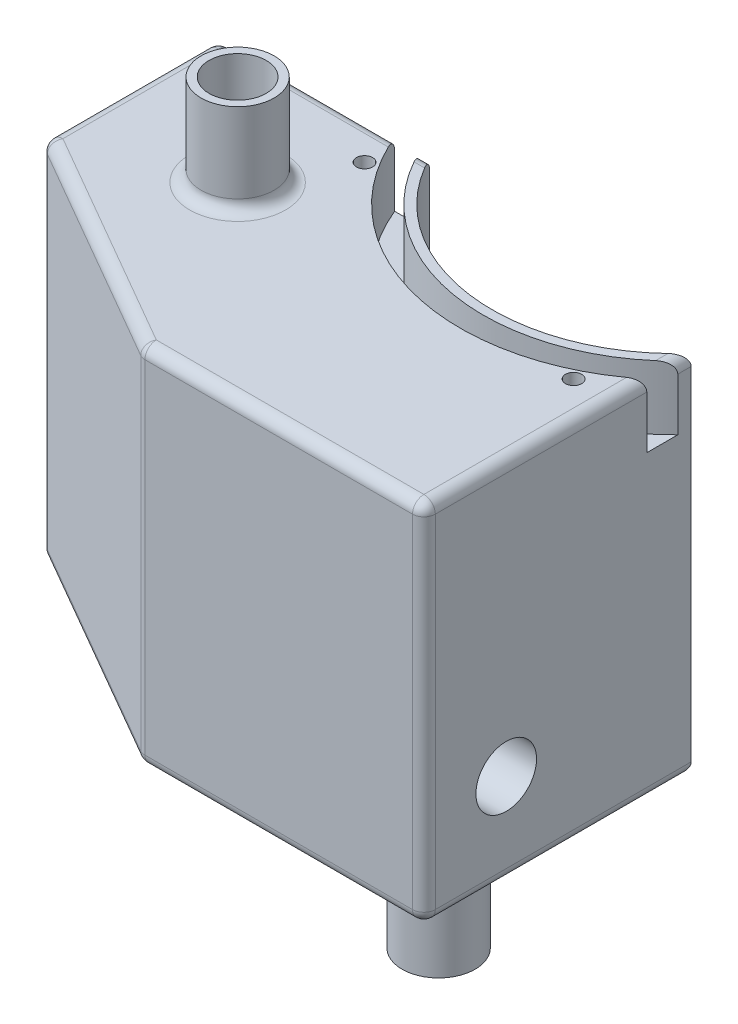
ISO-10303-21;
HEADER;
FILE_DESCRIPTION(('STEP AP214'),'2;1');
FILE_NAME('part.step','',(''),(''),'','','');
FILE_SCHEMA(('AUTOMOTIVE_DESIGN { 1 0 10303 214 1 1 1 1 }'));
ENDSEC;
DATA;
#1=APPLICATION_CONTEXT('core data for automotive mechanical design processes');
#2=APPLICATION_PROTOCOL_DEFINITION('international standard','automotive_design',2000,#1);
#3=PRODUCT_CONTEXT('',#1,'mechanical');
#4=PRODUCT('Part','Part','',(#3));
#5=PRODUCT_RELATED_PRODUCT_CATEGORY('part','',(#4));
#6=PRODUCT_DEFINITION_FORMATION('','',#4);
#7=PRODUCT_DEFINITION_CONTEXT('part definition',#1,'design');
#8=PRODUCT_DEFINITION('design','',#6,#7);
#9=PRODUCT_DEFINITION_SHAPE('','',#8);
#10=(LENGTH_UNIT() NAMED_UNIT(*) SI_UNIT(.MILLI.,.METRE.));
#11=(NAMED_UNIT(*) PLANE_ANGLE_UNIT() SI_UNIT($,.RADIAN.));
#12=(NAMED_UNIT(*) SI_UNIT($,.STERADIAN.) SOLID_ANGLE_UNIT());
#13=UNCERTAINTY_MEASURE_WITH_UNIT(LENGTH_MEASURE(1.E-05),#10,'distance_accuracy_value','');
#14=(GEOMETRIC_REPRESENTATION_CONTEXT(3) GLOBAL_UNCERTAINTY_ASSIGNED_CONTEXT((#13)) GLOBAL_UNIT_ASSIGNED_CONTEXT((#10,
#11,#12)) REPRESENTATION_CONTEXT('',''));
#15=CARTESIAN_POINT('',(0.,0.,0.));
#16=DIRECTION('',(0.,0.,1.));
#17=DIRECTION('',(1.,0.,0.));
#18=AXIS2_PLACEMENT_3D('',#15,#16,#17);
#19=CARTESIAN_POINT('',(7.49812831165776,50.8,-42.5239987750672));
#20=DIRECTION('',(0.,1.,0.));
#21=DIRECTION('',(0.,0.,1.));
#22=AXIS2_PLACEMENT_3D('',#19,#20,#21);
#23=PLANE('',#22);
#24=DIRECTION('',(-1.,0.,0.));
#25=VECTOR('',#24,1.);
#26=CARTESIAN_POINT('',(-44.5718716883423,50.8,-29.5064987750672));
#27=LINE('',#26,#25);
#28=CARTESIAN_POINT('',(-14.3125271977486,50.8,-29.5064987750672));
#29=VERTEX_POINT('',#28);
#30=CARTESIAN_POINT('',(-15.7791909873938,50.8,-29.5064987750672));
#31=VERTEX_POINT('',#30);
#32=EDGE_CURVE('E707',#29,#31,#27,.T.);
#33=ORIENTED_EDGE('',*,*,#32,.T.);
#34=CARTESIAN_POINT('',(7.49812831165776,50.8,-42.5239987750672));
#35=DIRECTION('',(0.,1.,0.));
#36=DIRECTION('',(0.,0.,1.));
#37=AXIS2_PLACEMENT_3D('',#34,#35,#36);
#38=CIRCLE('',#37,26.67);
#39=CARTESIAN_POINT('',(24.9606283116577,50.8,-22.3658740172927));
#40=VERTEX_POINT('',#39);
#41=EDGE_CURVE('E245',#31,#40,#38,.T.);
#42=ORIENTED_EDGE('',*,*,#41,.T.);
#43=DIRECTION('',(0.,0.,-1.));
#44=VECTOR('',#43,1.);
#45=CARTESIAN_POINT('',(24.9606283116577,50.8,-25.723477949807));
#46=LINE('',#45,#44);
#47=CARTESIAN_POINT('',(24.9606283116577,50.8,-24.0789155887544));
#48=VERTEX_POINT('',#47);
#49=EDGE_CURVE('E694',#40,#48,#46,.T.);
#50=ORIENTED_EDGE('',*,*,#49,.T.);
#51=CARTESIAN_POINT('',(7.49812831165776,50.8,-42.5239987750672));
#52=DIRECTION('',(0.,-1.,0.));
#53=DIRECTION('',(0.,0.,1.));
#54=AXIS2_PLACEMENT_3D('',#51,#52,#53);
#55=CIRCLE('',#54,25.4);
#56=EDGE_CURVE('E626',#48,#29,#55,.T.);
#57=ORIENTED_EDGE('',*,*,#56,.T.);
#58=EDGE_LOOP('',(#33,#42,#50,#57));
#59=FACE_BOUND('',#58,.T.);
#60=ADVANCED_FACE('F44',(#59),#23,.T.);
#61=CARTESIAN_POINT('',(24.9606283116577,49.2125,-42.5239987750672));
#62=DIRECTION('',(0.,0.,1.));
#63=DIRECTION('',(1.,0.,0.));
#64=AXIS2_PLACEMENT_3D('',#61,#62,#63);
#65=CYLINDRICAL_SURFACE('',#64,1.5875);
#66=ORIENTED_EDGE('',*,*,#49,.F.);
#67=CARTESIAN_POINT('',(24.9606283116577,50.8,-22.3658740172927));
#68=CARTESIAN_POINT('',(25.0111751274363,50.7999918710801,-22.4096603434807));
#69=CARTESIAN_POINT('',(25.0615341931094,50.7975859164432,-22.4536195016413));
#70=CARTESIAN_POINT('',(25.1616744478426,50.7880231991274,-22.5416945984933));
#71=CARTESIAN_POINT('',(25.211455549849,50.7808657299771,-22.5858105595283));
#72=CARTESIAN_POINT('',(25.3601516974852,50.7522292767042,-22.7185780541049));
#73=CARTESIAN_POINT('',(25.4578559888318,50.7235870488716,-22.807160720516));
#74=CARTESIAN_POINT('',(25.6465921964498,50.6477130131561,-22.9807539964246));
#75=CARTESIAN_POINT('',(25.7376939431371,50.6007258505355,-23.0657959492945));
#76=CARTESIAN_POINT('',(25.912116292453,50.4874916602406,-23.2307808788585));
#77=CARTESIAN_POINT('',(25.9954538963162,50.4212880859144,-23.3107348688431));
#78=CARTESIAN_POINT('',(26.1283166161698,50.2907542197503,-23.4396875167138));
#79=CARTESIAN_POINT('',(26.1806283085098,50.2314743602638,-23.4909281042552));
#80=CARTESIAN_POINT('',(26.2777897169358,50.1023045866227,-23.586790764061));
#81=CARTESIAN_POINT('',(26.3226485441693,50.0324278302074,-23.6314209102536));
#82=CARTESIAN_POINT('',(26.3937576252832,49.8985947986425,-23.7025731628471));
#83=CARTESIAN_POINT('',(26.4219336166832,49.8366432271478,-23.7309231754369));
#84=CARTESIAN_POINT('',(26.4706802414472,49.7071334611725,-23.7801364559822));
#85=CARTESIAN_POINT('',(26.4912705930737,49.6395903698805,-23.8010191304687));
#86=CARTESIAN_POINT('',(26.5206308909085,49.512526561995,-23.8308540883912));
#87=CARTESIAN_POINT('',(26.5308437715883,49.4536873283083,-23.8412596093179));
#88=CARTESIAN_POINT('',(26.5411622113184,49.3641035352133,-23.8517792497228));
#89=CARTESIAN_POINT('',(26.5437684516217,49.3339177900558,-23.8544379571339));
#90=CARTESIAN_POINT('',(26.5472535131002,49.2733256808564,-23.857994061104));
#91=CARTESIAN_POINT('',(26.548131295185,49.2429191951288,-23.8588903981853));
#92=CARTESIAN_POINT('',(26.5481283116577,49.2125,-23.8588869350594));
#93=B_SPLINE_CURVE_WITH_KNOTS('',3,(#67,#68,#69,#70,#71,#72,#73,#74,#75,#76,#77,#78,#79,#80,#81,
#82,#83,#84,#85,#86,#87,#88,#89,#90,#91,#92),.UNSPECIFIED.,.F.,.F.,(4,2,2,2,2,2,2,2,2,2,2,2,4),
(0.,0.200525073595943,0.401079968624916,0.804407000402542,1.20252958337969,1.59975882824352,
1.88150958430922,2.16291332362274,2.38326373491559,2.60303725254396,2.78411381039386,
2.8752665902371,2.96647415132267),.UNSPECIFIED.);
#94=CARTESIAN_POINT('',(26.5481283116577,49.2125,-23.8588869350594));
#95=VERTEX_POINT('',#94);
#96=EDGE_CURVE('E253',#40,#95,#93,.T.);
#97=ORIENTED_EDGE('',*,*,#96,.T.);
#98=DIRECTION('',(0.,0.,-1.));
#99=VECTOR('',#98,1.);
#100=CARTESIAN_POINT('',(26.5481283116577,49.2125,11.4510012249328));
#101=LINE('',#100,#99);
#102=CARTESIAN_POINT('',(26.5481283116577,49.2125,-25.723477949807));
#103=VERTEX_POINT('',#102);
#104=EDGE_CURVE('E251',#103,#95,#101,.F.);
#105=ORIENTED_EDGE('',*,*,#104,.F.);
#106=CARTESIAN_POINT('',(24.9606283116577,50.8,-24.0789155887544));
#107=CARTESIAN_POINT('',(25.0221395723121,50.7999830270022,-24.1371446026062));
#108=CARTESIAN_POINT('',(25.0833484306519,50.796424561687,-24.195681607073));
#109=CARTESIAN_POINT('',(25.2048038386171,50.7823053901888,-24.3129932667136));
#110=CARTESIAN_POINT('',(25.2650497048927,50.7717399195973,-24.3717680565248));
#111=CARTESIAN_POINT('',(25.3846537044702,50.7435659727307,-24.4896058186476));
#112=CARTESIAN_POINT('',(25.4439995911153,50.725897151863,-24.5486668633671));
#113=CARTESIAN_POINT('',(25.5608093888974,50.6834854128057,-24.6660478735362));
#114=CARTESIAN_POINT('',(25.6182739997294,50.6587451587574,-24.724368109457));
#115=CARTESIAN_POINT('',(25.7606380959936,50.5870672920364,-24.8702211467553));
#116=CARTESIAN_POINT('',(25.8440177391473,50.5353049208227,-24.956933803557));
#117=CARTESIAN_POINT('',(26.003019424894,50.4139760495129,-25.1245086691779));
#118=CARTESIAN_POINT('',(26.0786656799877,50.3444676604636,-25.205388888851));
#119=CARTESIAN_POINT('',(26.1967049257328,50.2112380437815,-25.3330636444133));
#120=CARTESIAN_POINT('',(26.2420306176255,50.1526852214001,-25.382527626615));
#121=CARTESIAN_POINT('',(26.3259111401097,50.0260772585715,-25.4747039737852));
#122=CARTESIAN_POINT('',(26.3644736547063,49.958033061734,-25.5174239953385));
#123=CARTESIAN_POINT('',(26.42494512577,49.8288004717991,-25.5847783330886));
#124=CARTESIAN_POINT('',(26.4486503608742,49.7694576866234,-25.611321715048));
#125=CARTESIAN_POINT('',(26.4892184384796,49.6458332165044,-25.6568880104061));
#126=CARTESIAN_POINT('',(26.5060995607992,49.5815652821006,-25.6759310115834));
#127=CARTESIAN_POINT('',(26.5284709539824,49.4664966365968,-25.7012083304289));
#128=CARTESIAN_POINT('',(26.5357754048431,49.4164921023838,-25.7094786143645));
#129=CARTESIAN_POINT('',(26.5456353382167,49.3151857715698,-25.7206511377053));
#130=CARTESIAN_POINT('',(26.5481674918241,49.2638788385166,-25.7235270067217));
#131=CARTESIAN_POINT('',(26.5481283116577,49.2125,-25.723477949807));
#132=B_SPLINE_CURVE_WITH_KNOTS('',3,(#106,#107,#108,#109,#110,#111,#112,#113,#114,#115,#116,
#117,#118,#119,#120,#121,#122,#123,#124,#125,#126,#127,#128,#129,#130,#131),.UNSPECIFIED.,.F.,
.F.,(4,2,2,2,2,2,2,2,2,2,2,2,4),(0.,0.254016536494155,0.508205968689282,0.764602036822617,
1.02090163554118,1.41241356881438,1.80265954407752,2.06901311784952,2.33506208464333,
2.54188777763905,2.74815571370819,2.90128212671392,3.05515516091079),.UNSPECIFIED.);
#133=EDGE_CURVE('E322',#48,#103,#132,.T.);
#134=ORIENTED_EDGE('',*,*,#133,.F.);
#135=EDGE_LOOP('',(#66,#97,#105,#134));
#136=FACE_BOUND('',#135,.T.);
#137=ADVANCED_FACE('F660',(#136),#65,.T.);
#138=CARTESIAN_POINT('',(7.49812831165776,49.2125,-29.5064987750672));
#139=DIRECTION('',(1.,0.,0.));
#140=DIRECTION('',(0.,0.,-1.));
#141=AXIS2_PLACEMENT_3D('',#138,#139,#140);
#142=CYLINDRICAL_SURFACE('',#141,1.5875);
#143=DIRECTION('',(-1.,0.,0.));
#144=VECTOR('',#143,1.);
#145=CARTESIAN_POINT('',(-15.1847969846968,49.2125,-31.0939987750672));
#146=LINE('',#145,#144);
#147=CARTESIAN_POINT('',(-16.5984274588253,49.2125,-31.0939987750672));
#148=VERTEX_POINT('',#147);
#149=CARTESIAN_POINT('',(-15.1847969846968,49.2125,-31.0939987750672));
#150=VERTEX_POINT('',#149);
#151=EDGE_CURVE('E454',#148,#150,#146,.F.);
#152=ORIENTED_EDGE('',*,*,#151,.F.);
#153=CARTESIAN_POINT('',(-16.5984274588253,49.2125,-31.0939987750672));
#154=CARTESIAN_POINT('',(-16.5984276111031,49.2539345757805,-31.0940004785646));
#155=CARTESIAN_POINT('',(-16.5976574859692,49.2953482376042,-31.0923753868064));
#156=CARTESIAN_POINT('',(-16.5945872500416,49.3778571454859,-31.0859055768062));
#157=CARTESIAN_POINT('',(-16.5922874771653,49.4189524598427,-31.0810615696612));
#158=CARTESIAN_POINT('',(-16.5831334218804,49.5410482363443,-31.0618023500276));
#159=CARTESIAN_POINT('',(-16.5740241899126,49.6211931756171,-31.0426593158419));
#160=CARTESIAN_POINT('',(-16.5500844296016,49.7767144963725,-30.9926015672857));
#161=CARTESIAN_POINT('',(-16.535255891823,49.8520925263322,-30.9616909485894));
#162=CARTESIAN_POINT('',(-16.5003208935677,49.9963217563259,-30.8893546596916));
#163=CARTESIAN_POINT('',(-16.4802118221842,50.0651697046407,-30.8479237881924));
#164=CARTESIAN_POINT('',(-16.4344917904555,50.1971018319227,-30.754487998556));
#165=CARTESIAN_POINT('',(-16.4087136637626,50.2599019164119,-30.702165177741));
#166=CARTESIAN_POINT('',(-16.3527891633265,50.3758023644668,-30.5897381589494));
#167=CARTESIAN_POINT('',(-16.322642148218,50.4289013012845,-30.5296328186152));
#168=CARTESIAN_POINT('',(-16.2557704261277,50.5290808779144,-30.3976995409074));
#169=CARTESIAN_POINT('',(-16.2186970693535,50.5751780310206,-30.3253027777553));
#170=CARTESIAN_POINT('',(-16.1410489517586,50.6546483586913,-30.1755032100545));
#171=CARTESIAN_POINT('',(-16.1004703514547,50.6880073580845,-30.0980949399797));
#172=CARTESIAN_POINT('',(-16.0142278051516,50.7434446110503,-29.9356354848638));
#173=CARTESIAN_POINT('',(-15.968405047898,50.7647396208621,-29.850402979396));
#174=CARTESIAN_POINT('',(-15.8749378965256,50.7930114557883,-29.6788267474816));
#175=CARTESIAN_POINT('',(-15.827298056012,50.8000219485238,-29.5924861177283));
#176=CARTESIAN_POINT('',(-15.7791909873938,50.8,-29.5064987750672));
#177=B_SPLINE_CURVE_WITH_KNOTS('',3,(#153,#154,#155,#156,#157,#158,#159,#160,#161,#162,#163,
#164,#165,#166,#167,#168,#169,#170,#171,#172,#173,#174,#175,#176),.UNSPECIFIED.,.F.,.F.,(4,2,2,
2,2,2,2,2,2,2,2,4),(0.,0.124223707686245,0.248419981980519,0.495821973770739,0.743137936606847,
0.990576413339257,1.24662897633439,1.50271916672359,1.78204997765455,2.06169073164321,
2.35785889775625,2.65332820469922),.UNSPECIFIED.);
#178=EDGE_CURVE('E293',#148,#31,#177,.T.);
#179=ORIENTED_EDGE('',*,*,#178,.T.);
#180=ORIENTED_EDGE('',*,*,#32,.F.);
#181=CARTESIAN_POINT('',(-15.1847969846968,49.2125,-31.0939987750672));
#182=CARTESIAN_POINT('',(-15.1847972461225,49.2535886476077,-31.0940006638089));
#183=CARTESIAN_POINT('',(-15.1839926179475,49.2946564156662,-31.092402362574));
#184=CARTESIAN_POINT('',(-15.1807855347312,49.3764734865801,-31.0860406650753));
#185=CARTESIAN_POINT('',(-15.1783834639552,49.4172228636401,-31.0812780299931));
#186=CARTESIAN_POINT('',(-15.1688254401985,49.5382661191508,-31.0623488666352));
#187=CARTESIAN_POINT('',(-15.1593174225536,49.6177069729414,-31.0435403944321));
#188=CARTESIAN_POINT('',(-15.1343498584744,49.7718416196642,-30.9943986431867));
#189=CARTESIAN_POINT('',(-15.1188929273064,49.8465374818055,-30.9640704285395));
#190=CARTESIAN_POINT('',(-15.0825086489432,49.9894784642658,-30.8931597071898));
#191=CARTESIAN_POINT('',(-15.0615782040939,50.0577199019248,-30.852571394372));
#192=CARTESIAN_POINT('',(-15.0139570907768,50.18875975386,-30.7609733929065));
#193=CARTESIAN_POINT('',(-14.9870775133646,50.2512521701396,-30.7096258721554));
#194=CARTESIAN_POINT('',(-14.9288025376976,50.3666899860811,-30.5993746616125));
#195=CARTESIAN_POINT('',(-14.8974065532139,50.4196341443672,-30.5404699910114));
#196=CARTESIAN_POINT('',(-14.8274841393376,50.5201877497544,-30.4106599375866));
#197=CARTESIAN_POINT('',(-14.788558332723,50.5667287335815,-30.3391434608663));
#198=CARTESIAN_POINT('',(-14.707035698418,50.6472276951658,-30.1912027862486));
#199=CARTESIAN_POINT('',(-14.6644342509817,50.681169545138,-30.1147724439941));
#200=CARTESIAN_POINT('',(-14.5716721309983,50.7394090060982,-29.9504682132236));
#201=CARTESIAN_POINT('',(-14.5211944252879,50.7622445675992,-29.862257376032));
#202=CARTESIAN_POINT('',(-14.4181573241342,50.7925312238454,-29.6847144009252));
#203=CARTESIAN_POINT('',(-14.3656036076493,50.8000216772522,-29.5953857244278));
#204=CARTESIAN_POINT('',(-14.3125271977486,50.8,-29.5064987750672));
#205=B_SPLINE_CURVE_WITH_KNOTS('',3,(#181,#182,#183,#184,#185,#186,#187,#188,#189,#190,#191,
#192,#193,#194,#195,#196,#197,#198,#199,#200,#201,#202,#203,#204),.UNSPECIFIED.,.F.,.F.,(4,2,2,
2,2,2,2,2,2,2,2,4),(0.,0.123186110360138,0.246342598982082,0.49161416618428,0.73677802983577,
0.98208094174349,1.23671972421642,1.49139158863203,1.77161930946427,2.05220451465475,
2.36349792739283,2.67399189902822),.UNSPECIFIED.);
#206=EDGE_CURVE('E315',#150,#29,#205,.T.);
#207=ORIENTED_EDGE('',*,*,#206,.F.);
#208=EDGE_LOOP('',(#152,#179,#180,#207));
#209=FACE_BOUND('',#208,.T.);
#210=ADVANCED_FACE('F307',(#209),#142,.T.);
#211=CARTESIAN_POINT('',(7.49812831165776,0.,-42.5239987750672));
#212=DIRECTION('',(0.,1.,0.));
#213=DIRECTION('',(0.,0.,1.));
#214=AXIS2_PLACEMENT_3D('',#211,#212,#213);
#215=PLANE('',#214);
#216=CARTESIAN_POINT('',(-25.5796707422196,0.,-14.7684297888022));
#217=DIRECTION('',(0.,1.,0.));
#218=DIRECTION('',(0.,0.,1.));
#219=AXIS2_PLACEMENT_3D('',#216,#217,#218);
#220=CIRCLE('',#219,14.00175);
#221=CARTESIAN_POINT('',(-25.5796707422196,0.,-0.766679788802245));
#222=VERTEX_POINT('',#221);
#223=EDGE_CURVE('E1263',#222,#222,#220,.T.);
#224=ORIENTED_EDGE('',*,*,#223,.T.);
#225=EDGE_LOOP('',(#224));
#226=FACE_BOUND('',#225,.T.);
#227=CARTESIAN_POINT('',(17.145,0.,0.));
#228=DIRECTION('',(0.,1.,0.));
#229=DIRECTION('',(0.,0.,1.));
#230=AXIS2_PLACEMENT_3D('',#227,#228,#229);
#231=CIRCLE('',#230,6.6675);
#232=CARTESIAN_POINT('',(17.145,0.,6.6675));
#233=VERTEX_POINT('',#232);
#234=EDGE_CURVE('E359',#233,#233,#231,.T.);
#235=ORIENTED_EDGE('',*,*,#234,.T.);
#236=EDGE_LOOP('',(#235));
#237=FACE_BOUND('',#236,.T.);
#238=DIRECTION('',(1.,0.,0.));
#239=VECTOR('',#238,1.);
#240=CARTESIAN_POINT('',(7.49812831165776,0.,9.86350122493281));
#241=LINE('',#240,#239);
#242=CARTESIAN_POINT('',(24.9606283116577,0.,9.86350122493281));
#243=VERTEX_POINT('',#242);
#244=CARTESIAN_POINT('',(2.73699361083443,0.,9.86350122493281));
#245=VERTEX_POINT('',#244);
#246=EDGE_CURVE('E376',#243,#245,#241,.F.);
#247=ORIENTED_EDGE('',*,*,#246,.T.);
#248=CARTESIAN_POINT('',(0.,0.,0.));
#249=DIRECTION('',(0.,1.,0.));
#250=DIRECTION('',(0.,0.,1.));
#251=AXIS2_PLACEMENT_3D('',#248,#249,#250);
#252=CIRCLE('',#251,10.2362);
#253=CARTESIAN_POINT('',(-2.73699361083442,0.,9.86350122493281));
#254=VERTEX_POINT('',#253);
#255=EDGE_CURVE('E235',#245,#254,#252,.T.);
#256=ORIENTED_EDGE('',*,*,#255,.T.);
#257=CARTESIAN_POINT('',(-12.2507867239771,0.,9.86350122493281));
#258=VERTEX_POINT('',#257);
#259=EDGE_CURVE('E368',#254,#258,#241,.F.);
#260=ORIENTED_EDGE('',*,*,#259,.T.);
#261=DIRECTION('',(0.866025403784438,0.,0.500000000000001));
#262=VECTOR('',#261,1.);
#263=CARTESIAN_POINT('',(-20.1235533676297,0.,5.31815728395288));
#264=LINE('',#263,#262);
#265=CARTESIAN_POINT('',(-42.9843716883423,0.,-7.88054232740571));
#266=VERTEX_POINT('',#265);
#267=EDGE_CURVE('E366',#258,#266,#264,.F.);
#268=ORIENTED_EDGE('',*,*,#267,.T.);
#269=DIRECTION('',(0.,0.,1.));
#270=VECTOR('',#269,1.);
#271=CARTESIAN_POINT('',(-42.9843716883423,0.,-42.5239987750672));
#272=LINE('',#271,#270);
#273=CARTESIAN_POINT('',(-42.9843716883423,0.,-29.5064987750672));
#274=VERTEX_POINT('',#273);
#275=EDGE_CURVE('E364',#266,#274,#272,.F.);
#276=ORIENTED_EDGE('',*,*,#275,.T.);
#277=DIRECTION('',(-1.,0.,0.));
#278=VECTOR('',#277,1.);
#279=CARTESIAN_POINT('',(7.49812831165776,0.,-29.5064987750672));
#280=LINE('',#279,#278);
#281=CARTESIAN_POINT('',(-14.3125271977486,0.,-29.5064987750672));
#282=VERTEX_POINT('',#281);
#283=EDGE_CURVE('E362',#274,#282,#280,.F.);
#284=ORIENTED_EDGE('',*,*,#283,.T.);
#285=CARTESIAN_POINT('',(7.49812831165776,0.,-42.5239987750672));
#286=DIRECTION('',(0.,-1.,0.));
#287=DIRECTION('',(0.,0.,1.));
#288=AXIS2_PLACEMENT_3D('',#285,#286,#287);
#289=CIRCLE('',#288,25.4);
#290=CARTESIAN_POINT('',(24.9606283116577,0.,-24.0789155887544));
#291=VERTEX_POINT('',#290);
#292=EDGE_CURVE('E624',#291,#282,#289,.T.);
#293=ORIENTED_EDGE('',*,*,#292,.F.);
#294=DIRECTION('',(0.,0.,-1.));
#295=VECTOR('',#294,1.);
#296=CARTESIAN_POINT('',(24.9606283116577,0.,-42.5239987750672));
#297=LINE('',#296,#295);
#298=EDGE_CURVE('E371',#291,#243,#297,.F.);
#299=ORIENTED_EDGE('',*,*,#298,.T.);
#300=EDGE_LOOP('',(#247,#256,#260,#268,#276,#284,#293,#299));
#301=FACE_BOUND('',#300,.T.);
#302=ADVANCED_FACE('F383',(#226,#237,#301),#215,.F.);
#303=CARTESIAN_POINT('',(-25.5796707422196,50.8,-14.7684297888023));
#304=DIRECTION('',(0.,-1.,0.));
#305=DIRECTION('',(0.,0.,-1.));
#306=AXIS2_PLACEMENT_3D('',#303,#304,#305);
#307=CYLINDRICAL_SURFACE('',#306,3.9751);
#308=CARTESIAN_POINT('',(-25.5796707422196,63.5,-14.7684297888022));
#309=DIRECTION('',(0.,1.,0.));
#310=DIRECTION('',(0.,0.,1.));
#311=AXIS2_PLACEMENT_3D('',#308,#309,#310);
#312=CIRCLE('',#311,3.97510000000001);
#313=CARTESIAN_POINT('',(-25.5796707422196,63.5,-10.7933297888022));
#314=VERTEX_POINT('',#313);
#315=EDGE_CURVE('E614',#314,#314,#312,.T.);
#316=ORIENTED_EDGE('',*,*,#315,.T.);
#317=EDGE_LOOP('',(#316));
#318=FACE_BOUND('',#317,.T.);
#319=CARTESIAN_POINT('',(-25.5796707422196,45.0893819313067,-14.7684297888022));
#320=DIRECTION('',(0.,-1.,0.));
#321=DIRECTION('',(0.,0.,-1.));
#322=AXIS2_PLACEMENT_3D('',#319,#320,#321);
#323=CIRCLE('',#322,3.9751);
#324=CARTESIAN_POINT('',(-25.5796707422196,45.0893819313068,-18.7435297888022));
#325=VERTEX_POINT('',#324);
#326=EDGE_CURVE('E599',#325,#325,#323,.T.);
#327=ORIENTED_EDGE('',*,*,#326,.T.);
#328=EDGE_LOOP('',(#327));
#329=FACE_BOUND('',#328,.T.);
#330=ADVANCED_FACE('F671',(#318,#329),#307,.F.);
#331=CARTESIAN_POINT('',(21.4681283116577,50.8,-14.4516520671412));
#332=DIRECTION('',(0.,1.,0.));
#333=DIRECTION('',(0.,0.,1.));
#334=AXIS2_PLACEMENT_3D('',#331,#332,#333);
#335=CIRCLE('',#334,1.1303);
#336=CARTESIAN_POINT('',(21.4681283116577,50.8,-13.3213520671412));
#337=VERTEX_POINT('',#336);
#338=EDGE_CURVE('E682',#337,#337,#335,.T.);
#339=ORIENTED_EDGE('',*,*,#338,.F.);
#340=EDGE_LOOP('',(#339));
#341=FACE_BOUND('',#340,.T.);
#342=CARTESIAN_POINT('',(-19.1718716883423,50.8,-26.0139987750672));
#343=DIRECTION('',(0.,1.,0.));
#344=DIRECTION('',(0.,0.,1.));
#345=AXIS2_PLACEMENT_3D('',#342,#343,#344);
#346=CIRCLE('',#345,1.1303);
#347=CARTESIAN_POINT('',(-19.1718716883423,50.8,-24.8836987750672));
#348=VERTEX_POINT('',#347);
#349=EDGE_CURVE('E686',#348,#348,#346,.T.);
#350=ORIENTED_EDGE('',*,*,#349,.F.);
#351=EDGE_LOOP('',(#350));
#352=FACE_BOUND('',#351,.T.);
#353=CARTESIAN_POINT('',(7.49812831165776,50.8,-42.5239987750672));
#354=DIRECTION('',(0.,1.,0.));
#355=DIRECTION('',(0.,0.,1.));
#356=AXIS2_PLACEMENT_3D('',#353,#354,#355);
#357=CIRCLE('',#356,29.845);
#358=CARTESIAN_POINT('',(-19.3583181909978,50.8,-29.5064987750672));
#359=VERTEX_POINT('',#358);
#360=CARTESIAN_POINT('',(24.9606283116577,50.8,-18.3210006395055));
#361=VERTEX_POINT('',#360);
#362=EDGE_CURVE('E244',#359,#361,#357,.T.);
#363=ORIENTED_EDGE('',*,*,#362,.F.);
#364=CARTESIAN_POINT('',(-42.9843716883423,50.8,-29.5064987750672));
#365=VERTEX_POINT('',#364);
#366=EDGE_CURVE('E706',#359,#365,#27,.T.);
#367=ORIENTED_EDGE('',*,*,#366,.T.);
#368=DIRECTION('',(0.,0.,1.));
#369=VECTOR('',#368,1.);
#370=CARTESIAN_POINT('',(-42.9843716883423,50.8,-6.96399877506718));
#371=LINE('',#370,#369);
#372=CARTESIAN_POINT('',(-42.9843716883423,50.8,-7.88054232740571));
#373=VERTEX_POINT('',#372);
#374=EDGE_CURVE('E704',#365,#373,#371,.T.);
#375=ORIENTED_EDGE('',*,*,#374,.T.);
#376=DIRECTION('',(0.866025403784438,0.,0.500000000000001));
#377=VECTOR('',#376,1.);
#378=CARTESIAN_POINT('',(-11.8824060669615,50.8,10.076185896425));
#379=LINE('',#378,#377);
#380=CARTESIAN_POINT('',(-12.2507867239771,50.8,9.86350122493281));
#381=VERTEX_POINT('',#380);
#382=EDGE_CURVE('E702',#373,#381,#379,.T.);
#383=ORIENTED_EDGE('',*,*,#382,.T.);
#384=DIRECTION('',(1.,0.,0.));
#385=VECTOR('',#384,1.);
#386=CARTESIAN_POINT('',(26.5481283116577,50.8,9.8635012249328));
#387=LINE('',#386,#385);
#388=CARTESIAN_POINT('',(24.9606283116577,50.8,9.8635012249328));
#389=VERTEX_POINT('',#388);
#390=EDGE_CURVE('E700',#381,#389,#387,.T.);
#391=ORIENTED_EDGE('',*,*,#390,.T.);
#392=EDGE_CURVE('E696',#389,#361,#46,.T.);
#393=ORIENTED_EDGE('',*,*,#392,.T.);
#394=EDGE_LOOP('',(#363,#367,#375,#383,#391,#393));
#395=FACE_BOUND('',#394,.T.);
#396=CARTESIAN_POINT('',(-25.5796707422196,50.8,-14.7684297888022));
#397=DIRECTION('',(0.,1.,0.));
#398=DIRECTION('',(0.,0.,1.));
#399=AXIS2_PLACEMENT_3D('',#396,#397,#398);
#400=CIRCLE('',#399,6.66750000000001);
#401=CARTESIAN_POINT('',(-25.5796707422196,50.8,-8.10092978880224));
#402=VERTEX_POINT('',#401);
#403=EDGE_CURVE('E635',#402,#402,#400,.F.);
#404=ORIENTED_EDGE('',*,*,#403,.T.);
#405=EDGE_LOOP('',(#404));
#406=FACE_BOUND('',#405,.T.);
#407=ADVANCED_FACE('F663',(#341,#352,#395,#406),#23,.T.);
#408=CARTESIAN_POINT('',(7.49812831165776,50.8,-42.5239987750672));
#409=DIRECTION('',(0.,-1.,0.));
#410=DIRECTION('',(0.,0.,-1.));
#411=AXIS2_PLACEMENT_3D('',#408,#409,#410);
#412=CYLINDRICAL_SURFACE('',#411,25.4);
#413=DIRECTION('',(0.,-1.,0.));
#414=VECTOR('',#413,1.);
#415=CARTESIAN_POINT('',(-15.1847969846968,50.8,-31.0939987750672));
#416=LINE('',#415,#414);
#417=CARTESIAN_POINT('',(-15.1847969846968,1.5875,-31.0939987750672));
#418=VERTEX_POINT('',#417);
#419=EDGE_CURVE('E633',#150,#418,#416,.T.);
#420=ORIENTED_EDGE('',*,*,#419,.F.);
#421=ORIENTED_EDGE('',*,*,#206,.T.);
#422=ORIENTED_EDGE('',*,*,#56,.F.);
#423=ORIENTED_EDGE('',*,*,#133,.T.);
#424=DIRECTION('',(0.,-1.,0.));
#425=VECTOR('',#424,1.);
#426=CARTESIAN_POINT('',(26.5481283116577,50.8,-25.723477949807));
#427=LINE('',#426,#425);
#428=CARTESIAN_POINT('',(26.5481283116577,1.5875,-25.723477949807));
#429=VERTEX_POINT('',#428);
#430=EDGE_CURVE('E629',#103,#429,#427,.T.);
#431=ORIENTED_EDGE('',*,*,#430,.T.);
#432=CARTESIAN_POINT('',(26.5481283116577,1.5875,-25.723477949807));
#433=CARTESIAN_POINT('',(26.5481379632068,1.55289351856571,-25.7234899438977));
#434=CARTESIAN_POINT('',(26.5469970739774,1.51829584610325,-25.7221952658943));
#435=CARTESIAN_POINT('',(26.5424890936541,1.44946860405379,-25.7170852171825));
#436=CARTESIAN_POINT('',(26.539124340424,1.41523868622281,-25.7132724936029));
#437=CARTESIAN_POINT('',(26.5302888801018,1.347772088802,-25.7032703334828));
#438=CARTESIAN_POINT('',(26.5248401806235,1.31452881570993,-25.6971057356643));
#439=CARTESIAN_POINT('',(26.5119643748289,1.24892716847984,-25.6825578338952));
#440=CARTESIAN_POINT('',(26.5045368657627,1.21656897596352,-25.6741740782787));
#441=CARTESIAN_POINT('',(26.4795726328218,1.12140690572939,-25.6460428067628));
#442=CARTESIAN_POINT('',(26.4593079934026,1.06017976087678,-25.6232626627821));
#443=CARTESIAN_POINT('',(26.4127623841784,0.942931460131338,-25.5711865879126));
#444=CARTESIAN_POINT('',(26.3864644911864,0.886925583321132,-25.5418723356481));
#445=CARTESIAN_POINT('',(26.3149221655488,0.754325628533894,-25.4625709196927));
#446=CARTESIAN_POINT('',(26.266722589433,0.681163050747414,-25.4095095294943));
#447=CARTESIAN_POINT('',(26.1626456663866,0.547044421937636,-25.2960630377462));
#448=CARTESIAN_POINT('',(26.1067520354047,0.48611495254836,-25.2356624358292));
#449=CARTESIAN_POINT('',(25.9644395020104,0.352312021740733,-25.0835217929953));
#450=CARTESIAN_POINT('',(25.8751173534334,0.285307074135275,-24.9893419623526));
#451=CARTESIAN_POINT('',(25.6887399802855,0.172619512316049,-24.7960609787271));
#452=CARTESIAN_POINT('',(25.5916735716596,0.126968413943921,-24.696952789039));
#453=CARTESIAN_POINT('',(25.4061878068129,0.0610982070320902,-24.5107763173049));
#454=CARTESIAN_POINT('',(25.318453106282,0.0382183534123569,-24.4239588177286));
#455=CARTESIAN_POINT('',(25.1851818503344,0.0153202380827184,-24.294024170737));
#456=CARTESIAN_POINT('',(25.1405971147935,0.00959134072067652,-24.2508722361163));
#457=CARTESIAN_POINT('',(25.0509415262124,0.00193388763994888,-24.1647335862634));
#458=CARTESIAN_POINT('',(25.0058706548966,5.47530094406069E-06,-24.1217468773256));
#459=CARTESIAN_POINT('',(24.9606283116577,0.,-24.0789155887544));
#460=B_SPLINE_CURVE_WITH_KNOTS('',3,(#432,#433,#434,#435,#436,#437,#438,#439,#440,#441,#442,
#443,#444,#445,#446,#447,#448,#449,#450,#451,#452,#453,#454,#455,#456,#457,#458,#459),
.UNSPECIFIED.,.F.,.F.,(4,2,2,2,2,2,2,2,2,2,2,2,2,4),(0.,0.103762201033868,0.20741549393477,
0.310003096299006,0.41261159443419,0.616813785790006,0.821595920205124,1.12715392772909,
1.43336887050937,1.86925778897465,2.30578801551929,2.68137534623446,2.86820694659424,
3.05504559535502),.UNSPECIFIED.);
#461=EDGE_CURVE('E450',#429,#291,#460,.T.);
#462=ORIENTED_EDGE('',*,*,#461,.T.);
#463=ORIENTED_EDGE('',*,*,#292,.T.);
#464=CARTESIAN_POINT('',(-14.3125271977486,0.,-29.5064987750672));
#465=CARTESIAN_POINT('',(-14.3471917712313,1.25383891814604E-05,-29.5645758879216));
#466=CARTESIAN_POINT('',(-14.3815994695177,0.00319083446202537,-29.6227569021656));
#467=CARTESIAN_POINT('',(-14.449678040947,0.0160128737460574,-29.7389164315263));
#468=CARTESIAN_POINT('',(-14.4833481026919,0.0256634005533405,-29.7968946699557));
#469=CARTESIAN_POINT('',(-14.583147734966,0.0646476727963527,-29.9703152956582));
#470=CARTESIAN_POINT('',(-14.6477053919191,0.104017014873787,-30.0846374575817));
#471=CARTESIAN_POINT('',(-14.7604577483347,0.201640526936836,-30.2877075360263));
#472=CARTESIAN_POINT('',(-14.8096525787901,0.256158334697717,-30.3777142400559));
#473=CARTESIAN_POINT('',(-14.9010223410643,0.383932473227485,-30.5470523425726));
#474=CARTESIAN_POINT('',(-14.9432223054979,0.457119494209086,-30.6264216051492));
#475=CARTESIAN_POINT('',(-15.0140124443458,0.610034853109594,-30.7609818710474));
#476=CARTESIAN_POINT('',(-15.0436567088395,0.687695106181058,-30.8179720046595));
#477=CARTESIAN_POINT('',(-15.095187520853,0.854071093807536,-30.9177397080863));
#478=CARTESIAN_POINT('',(-15.1170791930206,0.942779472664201,-30.9605266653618));
#479=CARTESIAN_POINT('',(-15.1427987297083,1.07882357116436,-31.0110171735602));
#480=CARTESIAN_POINT('',(-15.1500528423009,1.12318707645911,-31.0252996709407));
#481=CARTESIAN_POINT('',(-15.1625585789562,1.21327382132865,-31.0499645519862));
#482=CARTESIAN_POINT('',(-15.1678104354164,1.25899690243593,-31.0603473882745));
#483=CARTESIAN_POINT('',(-15.1762664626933,1.35159736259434,-31.0770815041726));
#484=CARTESIAN_POINT('',(-15.1794602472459,1.39847937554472,-31.0834123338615));
#485=CARTESIAN_POINT('',(-15.1837280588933,1.49273872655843,-31.0918775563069));
#486=CARTESIAN_POINT('',(-15.1848010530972,1.54011629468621,-31.0940099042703));
#487=CARTESIAN_POINT('',(-15.1847969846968,1.5875,-31.0939987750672));
#488=B_SPLINE_CURVE_WITH_KNOTS('',3,(#464,#465,#466,#467,#468,#469,#470,#471,#472,#473,#474,
#475,#476,#477,#478,#479,#480,#481,#482,#483,#484,#485,#486,#487),.UNSPECIFIED.,.F.,.F.,(4,2,2,
2,2,2,2,2,2,2,2,4),(0.,0.202740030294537,0.405692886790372,0.813680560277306,1.16023330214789,
1.50551772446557,1.80617428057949,2.10663172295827,2.24795211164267,2.3892560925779,
2.53126770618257,2.67334846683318),.UNSPECIFIED.);
#489=EDGE_CURVE('E445',#282,#418,#488,.T.);
#490=ORIENTED_EDGE('',*,*,#489,.T.);
#491=EDGE_LOOP('',(#420,#421,#422,#423,#431,#462,#463,#490));
#492=FACE_BOUND('',#491,.T.);
#493=ADVANCED_FACE('F308',(#492),#412,.F.);
#494=CARTESIAN_POINT('',(-15.1847969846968,50.8,-31.0939987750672));
#495=DIRECTION('',(0.,0.,1.));
#496=DIRECTION('',(1.,0.,0.));
#497=AXIS2_PLACEMENT_3D('',#494,#495,#496);
#498=PLANE('',#497);
#499=CARTESIAN_POINT('',(-42.9843716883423,49.2125,-31.0939987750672));
#500=VERTEX_POINT('',#499);
#501=CARTESIAN_POINT('',(-20.0714042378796,49.2125,-31.0939987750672));
#502=VERTEX_POINT('',#501);
#503=EDGE_CURVE('E451',#500,#502,#146,.F.);
#504=ORIENTED_EDGE('',*,*,#503,.T.);
#505=DIRECTION('',(0.,1.,0.));
#506=VECTOR('',#505,1.);
#507=CARTESIAN_POINT('',(-20.0714042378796,41.91,-31.0939987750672));
#508=LINE('',#507,#506);
#509=CARTESIAN_POINT('',(-20.0714042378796,41.91,-31.0939987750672));
#510=VERTEX_POINT('',#509);
#511=EDGE_CURVE('E252',#502,#510,#508,.F.);
#512=ORIENTED_EDGE('',*,*,#511,.T.);
#513=DIRECTION('',(-1.,0.,0.));
#514=VECTOR('',#513,1.);
#515=CARTESIAN_POINT('',(-15.1847969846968,41.91,-31.0939987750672));
#516=LINE('',#515,#514);
#517=CARTESIAN_POINT('',(-16.5984274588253,41.91,-31.0939987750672));
#518=VERTEX_POINT('',#517);
#519=EDGE_CURVE('E810',#518,#510,#516,.T.);
#520=ORIENTED_EDGE('',*,*,#519,.F.);
#521=DIRECTION('',(0.,1.,0.));
#522=VECTOR('',#521,1.);
#523=CARTESIAN_POINT('',(-16.5984274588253,41.91,-31.0939987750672));
#524=LINE('',#523,#522);
#525=EDGE_CURVE('E243',#148,#518,#524,.F.);
#526=ORIENTED_EDGE('',*,*,#525,.F.);
#527=ORIENTED_EDGE('',*,*,#151,.T.);
#528=ORIENTED_EDGE('',*,*,#419,.T.);
#529=DIRECTION('',(-1.,0.,0.));
#530=VECTOR('',#529,1.);
#531=CARTESIAN_POINT('',(-15.1847969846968,1.5875,-31.0939987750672));
#532=LINE('',#531,#530);
#533=CARTESIAN_POINT('',(-42.9843716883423,1.5875,-31.0939987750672));
#534=VERTEX_POINT('',#533);
#535=EDGE_CURVE('E446',#418,#534,#532,.T.);
#536=ORIENTED_EDGE('',*,*,#535,.T.);
#537=DIRECTION('',(0.,-1.,0.));
#538=VECTOR('',#537,1.);
#539=CARTESIAN_POINT('',(-42.9843716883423,50.8,-31.0939987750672));
#540=LINE('',#539,#538);
#541=EDGE_CURVE('E709',#534,#500,#540,.F.);
#542=ORIENTED_EDGE('',*,*,#541,.T.);
#543=EDGE_LOOP('',(#504,#512,#520,#526,#527,#528,#536,#542));
#544=FACE_BOUND('',#543,.T.);
#545=ADVANCED_FACE('F677',(#544),#498,.F.);
#546=CARTESIAN_POINT('',(-44.5718716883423,50.8,-31.0939987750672));
#547=DIRECTION('',(1.,0.,0.));
#548=DIRECTION('',(0.,0.,-1.));
#549=AXIS2_PLACEMENT_3D('',#546,#547,#548);
#550=PLANE('',#549);
#551=CARTESIAN_POINT('',(-44.5718716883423,30.48,-20.162225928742));
#552=DIRECTION('',(1.,0.,0.));
#553=DIRECTION('',(0.,0.,-1.));
#554=AXIS2_PLACEMENT_3D('',#551,#552,#553);
#555=ELLIPSE('',#554,4.86867935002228,4.2164);
#556=CARTESIAN_POINT('',(-44.5718716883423,30.48,-25.0309052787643));
#557=VERTEX_POINT('',#556);
#558=EDGE_CURVE('E595',#557,#557,#555,.T.);
#559=ORIENTED_EDGE('',*,*,#558,.T.);
#560=EDGE_LOOP('',(#559));
#561=FACE_BOUND('',#560,.T.);
#562=DIRECTION('',(0.,-1.,0.));
#563=VECTOR('',#562,1.);
#564=CARTESIAN_POINT('',(-44.5718716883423,50.8,-7.88054232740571));
#565=LINE('',#564,#563);
#566=CARTESIAN_POINT('',(-44.5718716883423,1.5875,-7.88054232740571));
#567=VERTEX_POINT('',#566);
#568=CARTESIAN_POINT('',(-44.5718716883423,49.2125,-7.88054232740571));
#569=VERTEX_POINT('',#568);
#570=EDGE_CURVE('E330',#567,#569,#565,.F.);
#571=ORIENTED_EDGE('',*,*,#570,.T.);
#572=DIRECTION('',(0.,0.,1.));
#573=VECTOR('',#572,1.);
#574=CARTESIAN_POINT('',(-44.5718716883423,49.2125,-31.0939987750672));
#575=LINE('',#574,#573);
#576=CARTESIAN_POINT('',(-44.5718716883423,49.2125,-29.5064987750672));
#577=VERTEX_POINT('',#576);
#578=EDGE_CURVE('E332',#569,#577,#575,.F.);
#579=ORIENTED_EDGE('',*,*,#578,.T.);
#580=DIRECTION('',(0.,-1.,0.));
#581=VECTOR('',#580,1.);
#582=CARTESIAN_POINT('',(-44.5718716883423,50.8,-29.5064987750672));
#583=LINE('',#582,#581);
#584=CARTESIAN_POINT('',(-44.5718716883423,1.5875,-29.5064987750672));
#585=VERTEX_POINT('',#584);
#586=EDGE_CURVE('E328',#577,#585,#583,.T.);
#587=ORIENTED_EDGE('',*,*,#586,.T.);
#588=DIRECTION('',(0.,0.,1.));
#589=VECTOR('',#588,1.);
#590=CARTESIAN_POINT('',(-44.5718716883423,1.5875,-31.0939987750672));
#591=LINE('',#590,#589);
#592=EDGE_CURVE('E321',#585,#567,#591,.T.);
#593=ORIENTED_EDGE('',*,*,#592,.T.);
#594=EDGE_LOOP('',(#571,#579,#587,#593));
#595=FACE_BOUND('',#594,.T.);
#596=ADVANCED_FACE('F831',(#561,#595),#550,.F.);
#597=CARTESIAN_POINT('',(-44.5718716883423,50.8,-6.96399877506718));
#598=DIRECTION('',(0.500000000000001,0.,-0.866025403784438));
#599=DIRECTION('',(-0.866025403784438,0.,-0.500000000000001));
#600=AXIS2_PLACEMENT_3D('',#597,#598,#599);
#601=PLANE('',#600);
#602=DIRECTION('',(0.,-1.,0.));
#603=VECTOR('',#602,1.);
#604=CARTESIAN_POINT('',(-13.0445367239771,50.8,11.2383165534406));
#605=LINE('',#604,#603);
#606=CARTESIAN_POINT('',(-13.0445367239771,1.5875,11.2383165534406));
#607=VERTEX_POINT('',#606);
#608=CARTESIAN_POINT('',(-13.0445367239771,49.2125,11.2383165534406));
#609=VERTEX_POINT('',#608);
#610=EDGE_CURVE('E339',#607,#609,#605,.F.);
#611=ORIENTED_EDGE('',*,*,#610,.T.);
#612=DIRECTION('',(0.866025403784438,0.,0.500000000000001));
#613=VECTOR('',#612,1.);
#614=CARTESIAN_POINT('',(-44.5718716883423,49.2125,-6.96399877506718));
#615=LINE('',#614,#613);
#616=CARTESIAN_POINT('',(-43.7781216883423,49.2125,-6.50572699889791));
#617=VERTEX_POINT('',#616);
#618=EDGE_CURVE('E341',#609,#617,#615,.F.);
#619=ORIENTED_EDGE('',*,*,#618,.T.);
#620=DIRECTION('',(0.,-1.,0.));
#621=VECTOR('',#620,1.);
#622=CARTESIAN_POINT('',(-43.7781216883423,50.8,-6.50572699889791));
#623=LINE('',#622,#621);
#624=CARTESIAN_POINT('',(-43.7781216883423,1.5875,-6.50572699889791));
#625=VERTEX_POINT('',#624);
#626=EDGE_CURVE('E337',#617,#625,#623,.T.);
#627=ORIENTED_EDGE('',*,*,#626,.T.);
#628=DIRECTION('',(0.866025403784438,0.,0.500000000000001));
#629=VECTOR('',#628,1.);
#630=CARTESIAN_POINT('',(-44.5718716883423,1.5875,-6.96399877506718));
#631=LINE('',#630,#629);
#632=EDGE_CURVE('E335',#625,#607,#631,.T.);
#633=ORIENTED_EDGE('',*,*,#632,.T.);
#634=EDGE_LOOP('',(#611,#619,#627,#633));
#635=FACE_BOUND('',#634,.T.);
#636=ADVANCED_FACE('F825',(#635),#601,.F.);
#637=CARTESIAN_POINT('',(-12.6761560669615,50.8,11.4510012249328));
#638=DIRECTION('',(0.,0.,-1.));
#639=DIRECTION('',(-1.,0.,0.));
#640=AXIS2_PLACEMENT_3D('',#637,#638,#639);
#641=PLANE('',#640);
#642=DIRECTION('',(0.,-1.,0.));
#643=VECTOR('',#642,1.);
#644=CARTESIAN_POINT('',(24.9606283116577,50.8,11.4510012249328));
#645=LINE('',#644,#643);
#646=CARTESIAN_POINT('',(24.9606283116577,1.5875,11.4510012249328));
#647=VERTEX_POINT('',#646);
#648=CARTESIAN_POINT('',(24.9606283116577,49.2125,11.4510012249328));
#649=VERTEX_POINT('',#648);
#650=EDGE_CURVE('E348',#647,#649,#645,.F.);
#651=ORIENTED_EDGE('',*,*,#650,.T.);
#652=DIRECTION('',(1.,0.,0.));
#653=VECTOR('',#652,1.);
#654=CARTESIAN_POINT('',(-12.6761560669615,49.2125,11.4510012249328));
#655=LINE('',#654,#653);
#656=CARTESIAN_POINT('',(-12.2507867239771,49.2125,11.4510012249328));
#657=VERTEX_POINT('',#656);
#658=EDGE_CURVE('E350',#649,#657,#655,.F.);
#659=ORIENTED_EDGE('',*,*,#658,.T.);
#660=DIRECTION('',(0.,-1.,0.));
#661=VECTOR('',#660,1.);
#662=CARTESIAN_POINT('',(-12.2507867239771,50.8,11.4510012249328));
#663=LINE('',#662,#661);
#664=CARTESIAN_POINT('',(-12.2507867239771,1.5875,11.4510012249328));
#665=VERTEX_POINT('',#664);
#666=EDGE_CURVE('E346',#657,#665,#663,.T.);
#667=ORIENTED_EDGE('',*,*,#666,.T.);
#668=DIRECTION('',(1.,0.,0.));
#669=VECTOR('',#668,1.);
#670=CARTESIAN_POINT('',(-12.6761560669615,1.5875,11.4510012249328));
#671=LINE('',#670,#669);
#672=EDGE_CURVE('E344',#665,#647,#671,.T.);
#673=ORIENTED_EDGE('',*,*,#672,.T.);
#674=EDGE_LOOP('',(#651,#659,#667,#673));
#675=FACE_BOUND('',#674,.T.);
#676=ADVANCED_FACE('F820',(#675),#641,.F.);
#677=CARTESIAN_POINT('',(26.5481283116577,50.8,-25.723477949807));
#678=DIRECTION('',(-1.,0.,0.));
#679=DIRECTION('',(0.,0.,1.));
#680=AXIS2_PLACEMENT_3D('',#677,#678,#679);
#681=PLANE('',#680);
#682=CARTESIAN_POINT('',(26.5481283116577,12.7,0.));
#683=DIRECTION('',(1.,0.,0.));
#684=DIRECTION('',(0.,0.,-1.));
#685=AXIS2_PLACEMENT_3D('',#682,#683,#684);
#686=CIRCLE('',#685,4.2164);
#687=CARTESIAN_POINT('',(26.5481283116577,12.7,-4.2164));
#688=VERTEX_POINT('',#687);
#689=EDGE_CURVE('E621',#688,#688,#686,.T.);
#690=ORIENTED_EDGE('',*,*,#689,.F.);
#691=EDGE_LOOP('',(#690));
#692=FACE_BOUND('',#691,.T.);
#693=DIRECTION('',(0.,0.,-1.));
#694=VECTOR('',#693,1.);
#695=CARTESIAN_POINT('',(26.5481283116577,41.91,-25.723477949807));
#696=LINE('',#695,#694);
#697=CARTESIAN_POINT('',(26.5481283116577,41.91,-19.5496320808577));
#698=VERTEX_POINT('',#697);
#699=CARTESIAN_POINT('',(26.5481283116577,41.91,-23.8588869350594));
#700=VERTEX_POINT('',#699);
#701=EDGE_CURVE('E225',#698,#700,#696,.T.);
#702=ORIENTED_EDGE('',*,*,#701,.F.);
#703=DIRECTION('',(0.,1.,0.));
#704=VECTOR('',#703,1.);
#705=CARTESIAN_POINT('',(26.5481283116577,41.91,-19.5496320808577));
#706=LINE('',#705,#704);
#707=CARTESIAN_POINT('',(26.5481283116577,49.2125,-19.5496320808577));
#708=VERTEX_POINT('',#707);
#709=EDGE_CURVE('E271',#698,#708,#706,.T.);
#710=ORIENTED_EDGE('',*,*,#709,.T.);
#711=CARTESIAN_POINT('',(26.5481283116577,49.2125,9.86350122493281));
#712=VERTEX_POINT('',#711);
#713=EDGE_CURVE('E357',#708,#712,#101,.F.);
#714=ORIENTED_EDGE('',*,*,#713,.T.);
#715=DIRECTION('',(0.,-1.,0.));
#716=VECTOR('',#715,1.);
#717=CARTESIAN_POINT('',(26.5481283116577,50.8,9.86350122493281));
#718=LINE('',#717,#716);
#719=CARTESIAN_POINT('',(26.5481283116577,1.5875,9.86350122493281));
#720=VERTEX_POINT('',#719);
#721=EDGE_CURVE('E355',#712,#720,#718,.T.);
#722=ORIENTED_EDGE('',*,*,#721,.T.);
#723=DIRECTION('',(0.,0.,-1.));
#724=VECTOR('',#723,1.);
#725=CARTESIAN_POINT('',(26.5481283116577,1.5875,-25.723477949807));
#726=LINE('',#725,#724);
#727=EDGE_CURVE('E353',#720,#429,#726,.T.);
#728=ORIENTED_EDGE('',*,*,#727,.T.);
#729=ORIENTED_EDGE('',*,*,#430,.F.);
#730=ORIENTED_EDGE('',*,*,#104,.T.);
#731=DIRECTION('',(0.,1.,0.));
#732=VECTOR('',#731,1.);
#733=CARTESIAN_POINT('',(26.5481283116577,41.91,-23.8588869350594));
#734=LINE('',#733,#732);
#735=EDGE_CURVE('E240',#700,#95,#734,.T.);
#736=ORIENTED_EDGE('',*,*,#735,.F.);
#737=EDGE_LOOP('',(#702,#710,#714,#722,#728,#729,#730,#736));
#738=FACE_BOUND('',#737,.T.);
#739=ADVANCED_FACE('F248',(#692,#738),#681,.F.);
#740=CARTESIAN_POINT('',(-3.9253404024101,12.7,0.));
#741=DIRECTION('',(1.,0.,0.));
#742=DIRECTION('',(0.,0.,-1.));
#743=AXIS2_PLACEMENT_3D('',#740,#741,#742);
#744=CYLINDRICAL_SURFACE('',#743,4.2164);
#745=CARTESIAN_POINT('',(7.6456979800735,12.7,-4.2164));
#746=CARTESIAN_POINT('',(7.64569890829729,12.5895200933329,-4.21639923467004));
#747=CARTESIAN_POINT('',(7.64810102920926,12.4790235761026,-4.2120515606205));
#748=CARTESIAN_POINT('',(7.65762248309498,12.2588723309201,-4.1947155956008));
#749=CARTESIAN_POINT('',(7.6647442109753,12.1492180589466,-4.18172291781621));
#750=CARTESIAN_POINT('',(7.6834620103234,11.9314473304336,-4.14723092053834));
#751=CARTESIAN_POINT('',(7.69506567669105,11.8233338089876,-4.12571716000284));
#752=CARTESIAN_POINT('',(7.72233340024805,11.6095861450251,-4.07444820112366));
#753=CARTESIAN_POINT('',(7.73799920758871,11.5039530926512,-4.04468945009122));
#754=CARTESIAN_POINT('',(7.79014557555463,11.1929680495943,-3.94387012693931));
#755=CARTESIAN_POINT('',(7.8319016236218,10.9921789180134,-3.86104770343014));
#756=CARTESIAN_POINT('',(7.92466021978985,10.6074986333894,-3.66687798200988));
#757=CARTESIAN_POINT('',(7.97566271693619,10.4236073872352,-3.55553084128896));
#758=CARTESIAN_POINT('',(8.08595646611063,10.0622313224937,-3.29745407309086));
#759=CARTESIAN_POINT('',(8.14558340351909,9.88631820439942,-3.14866643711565));
#760=CARTESIAN_POINT('',(8.26371486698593,9.56067588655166,-2.824091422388));
#761=CARTESIAN_POINT('',(8.32221885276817,9.41095902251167,-2.64829139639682));
#762=CARTESIAN_POINT('',(8.40653390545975,9.2046662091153,-2.36130113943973));
#763=CARTESIAN_POINT('',(8.43482159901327,9.13731294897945,-2.25842268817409));
#764=CARTESIAN_POINT('',(8.4886875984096,9.01159243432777,-2.04666066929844));
#765=CARTESIAN_POINT('',(8.51426704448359,8.95322139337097,-1.93777965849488));
#766=CARTESIAN_POINT('',(8.5619837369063,8.84601875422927,-1.71469423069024));
#767=CARTESIAN_POINT('',(8.58412095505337,8.7971872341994,-1.60048977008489));
#768=CARTESIAN_POINT('',(8.62428292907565,8.7096274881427,-1.36763118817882));
#769=CARTESIAN_POINT('',(8.64230993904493,8.6708937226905,-1.24897954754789));
#770=CARTESIAN_POINT('',(8.67265681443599,8.60621964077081,-1.01616895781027));
#771=CARTESIAN_POINT('',(8.68527712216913,8.5795983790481,-0.902238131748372));
#772=CARTESIAN_POINT('',(8.70610014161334,8.53588517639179,-0.672215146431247));
#773=CARTESIAN_POINT('',(8.71430497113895,8.51878866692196,-0.556124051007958));
#774=CARTESIAN_POINT('',(8.72606624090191,8.49433124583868,-0.32271509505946));
#775=CARTESIAN_POINT('',(8.72962385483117,8.4869678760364,-0.205397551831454));
#776=CARTESIAN_POINT('',(8.73199008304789,8.48206711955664,0.029485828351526));
#777=CARTESIAN_POINT('',(8.73079896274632,8.48452918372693,0.147051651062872));
#778=CARTESIAN_POINT('',(8.72399193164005,8.49864629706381,0.371863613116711));
#779=CARTESIAN_POINT('',(8.71874476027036,8.50953533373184,0.47916950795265));
#780=CARTESIAN_POINT('',(8.70441078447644,8.53944324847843,0.692392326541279));
#781=CARTESIAN_POINT('',(8.69532273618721,8.55846476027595,0.79830878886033));
#782=CARTESIAN_POINT('',(8.66259991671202,8.62745164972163,1.11280012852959));
#783=CARTESIAN_POINT('',(8.63349942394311,8.68935316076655,1.31832957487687));
#784=CARTESIAN_POINT('',(8.56289190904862,8.843685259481,1.71861688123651));
#785=CARTESIAN_POINT('',(8.52121134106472,8.93654493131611,1.91317567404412));
#786=CARTESIAN_POINT('',(8.42926528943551,9.14964159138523,2.28447227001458));
#787=CARTESIAN_POINT('',(8.37899668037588,9.26988855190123,2.46120354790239));
#788=CARTESIAN_POINT('',(8.2693534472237,9.54673128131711,2.80867238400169));
#789=CARTESIAN_POINT('',(8.20956647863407,9.70562013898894,2.97745000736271));
#790=CARTESIAN_POINT('',(8.09058790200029,10.0491834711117,3.28704306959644));
#791=CARTESIAN_POINT('',(8.03139672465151,10.2338753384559,3.4278394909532));
#792=CARTESIAN_POINT('',(7.946282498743,10.5328496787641,3.61891866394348));
#793=CARTESIAN_POINT('',(7.91782724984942,10.6392948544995,3.6805875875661));
#794=CARTESIAN_POINT('',(7.86380728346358,10.8577321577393,3.79463265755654));
#795=CARTESIAN_POINT('',(7.83824126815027,10.9697217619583,3.84701298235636));
#796=CARTESIAN_POINT('',(7.79092995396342,11.1985290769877,3.94194800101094));
#797=CARTESIAN_POINT('',(7.76918346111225,11.3153452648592,3.98450576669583));
#798=CARTESIAN_POINT('',(7.73037722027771,11.5529377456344,4.05928220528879));
#799=CARTESIAN_POINT('',(7.71331467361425,11.6737116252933,4.0915070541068));
#800=CARTESIAN_POINT('',(7.68570175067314,11.90887181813,4.14312741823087));
#801=CARTESIAN_POINT('',(7.67475207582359,12.0230369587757,4.16331775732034));
#802=CARTESIAN_POINT('',(7.65789851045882,12.2529596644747,4.19423764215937));
#803=CARTESIAN_POINT('',(7.65199207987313,12.3687163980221,4.20497195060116));
#804=CARTESIAN_POINT('',(7.64546114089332,12.6008365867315,4.21683493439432));
#805=CARTESIAN_POINT('',(7.64483508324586,12.7171998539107,4.2179664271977));
#806=CARTESIAN_POINT('',(7.64888688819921,12.9495234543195,4.2106143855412));
#807=CARTESIAN_POINT('',(7.65356444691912,13.0654838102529,4.20213140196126));
#808=CARTESIAN_POINT('',(7.66731249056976,13.2845734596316,4.17698782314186));
#809=CARTESIAN_POINT('',(7.6759022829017,13.3878365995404,4.16121985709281));
#810=CARTESIAN_POINT('',(7.69694349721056,13.5925421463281,4.12216827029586));
#811=CARTESIAN_POINT('',(7.70939614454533,13.6939839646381,4.09888226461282));
#812=CARTESIAN_POINT('',(7.75199651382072,13.9945883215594,4.01808932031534));
#813=CARTESIAN_POINT('',(7.7873968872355,14.1901790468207,3.94962994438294));
#814=CARTESIAN_POINT('',(7.87015023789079,14.5761362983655,3.78213157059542));
#815=CARTESIAN_POINT('',(7.91798156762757,14.765839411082,3.68182116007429));
#816=CARTESIAN_POINT('',(8.01973439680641,15.1268212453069,3.45457261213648));
#817=CARTESIAN_POINT('',(8.07365897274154,15.2980905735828,3.32762099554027));
#818=CARTESIAN_POINT('',(8.18903654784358,15.6380444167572,3.03350610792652));
#819=CARTESIAN_POINT('',(8.2506374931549,15.8041266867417,2.86338710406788));
#820=CARTESIAN_POINT('',(8.36895889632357,16.1061877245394,2.49645636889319));
#821=CARTESIAN_POINT('',(8.42567804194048,16.2421584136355,2.29963749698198));
#822=CARTESIAN_POINT('',(8.50314253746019,16.4215174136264,1.98577612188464));
#823=CARTESIAN_POINT('',(8.52790904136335,16.4776499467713,1.87682864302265));
#824=CARTESIAN_POINT('',(8.57393723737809,16.5804409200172,1.65385969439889));
#825=CARTESIAN_POINT('',(8.59520049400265,16.6271035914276,1.53984051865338));
#826=CARTESIAN_POINT('',(8.63358575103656,16.7104202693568,1.30758477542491));
#827=CARTESIAN_POINT('',(8.65070953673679,16.7470785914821,1.18935005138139));
#828=CARTESIAN_POINT('',(8.68030144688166,16.809952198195,0.949566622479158));
#829=CARTESIAN_POINT('',(8.69277007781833,16.8361686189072,0.82801827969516));
#830=CARTESIAN_POINT('',(8.7117812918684,16.8759683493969,0.593464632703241));
#831=CARTESIAN_POINT('',(8.71874825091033,16.8904591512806,0.480646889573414));
#832=CARTESIAN_POINT('',(8.72829239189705,16.9102811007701,0.253981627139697));
#833=CARTESIAN_POINT('',(8.73086811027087,16.9156091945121,0.14013377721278));
#834=CARTESIAN_POINT('',(8.73155274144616,16.9170269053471,-0.0875576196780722));
#835=CARTESIAN_POINT('',(8.72966457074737,16.9131225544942,-0.201401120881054));
#836=CARTESIAN_POINT('',(8.72147880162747,16.8961351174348,-0.42828233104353));
#837=CARTESIAN_POINT('',(8.71517957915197,16.8830486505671,-0.541319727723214));
#838=CARTESIAN_POINT('',(8.69884031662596,16.8488958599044,-0.759011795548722));
#839=CARTESIAN_POINT('',(8.68904395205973,16.8283481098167,-0.863766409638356));
#840=CARTESIAN_POINT('',(8.66593611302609,16.779486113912,-1.07106516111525));
#841=CARTESIAN_POINT('',(8.65262343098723,16.751169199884,-1.17360852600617));
#842=CARTESIAN_POINT('',(8.60785333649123,16.6549616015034,-1.47688775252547));
#843=CARTESIAN_POINT('',(8.57154927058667,16.5757846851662,-1.67345703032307));
#844=CARTESIAN_POINT('',(8.48735905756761,16.3859330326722,-2.05918758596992));
#845=CARTESIAN_POINT('',(8.43903032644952,16.2740161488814,-2.24763271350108));
#846=CARTESIAN_POINT('',(8.3359940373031,16.0234219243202,-2.60390970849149));
#847=CARTESIAN_POINT('',(8.28128355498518,15.8847322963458,-2.77173205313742));
#848=CARTESIAN_POINT('',(8.16500584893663,15.5695076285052,-3.09842231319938));
#849=CARTESIAN_POINT('',(8.10327543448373,15.3906478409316,-3.2549903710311));
#850=CARTESIAN_POINT('',(7.98436128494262,15.0078784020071,-3.53668476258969));
#851=CARTESIAN_POINT('',(7.92718115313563,14.8039492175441,-3.66178634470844));
#852=CARTESIAN_POINT('',(7.84954856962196,14.4804614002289,-3.82400560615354));
#853=CARTESIAN_POINT('',(7.82479896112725,14.368347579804,-3.8742514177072));
#854=CARTESIAN_POINT('',(7.77922084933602,14.139488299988,-3.96497507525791));
#855=CARTESIAN_POINT('',(7.75839033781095,14.0227452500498,-4.00545792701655));
#856=CARTESIAN_POINT('',(7.72152434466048,13.7857746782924,-4.07607334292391));
#857=CARTESIAN_POINT('',(7.70547643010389,13.6655570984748,-4.10623277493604));
#858=CARTESIAN_POINT('',(7.67880225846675,13.4224122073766,-4.15590226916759));
#859=CARTESIAN_POINT('',(7.66817212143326,13.2994869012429,-4.17541995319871));
#860=CARTESIAN_POINT('',(7.65558836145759,13.096921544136,-4.19842705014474));
#861=CARTESIAN_POINT('',(7.65188641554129,13.0177415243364,-4.20516187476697));
#862=CARTESIAN_POINT('',(7.64694081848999,12.8590438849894,-4.21414875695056));
#863=CARTESIAN_POINT('',(7.64569731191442,12.7795262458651,-4.21640055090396));
#864=CARTESIAN_POINT('',(7.6456979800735,12.7,-4.2164));
#865=B_SPLINE_CURVE_WITH_KNOTS('',3,(#745,#746,#747,#748,#749,#750,#751,#752,#753,#754,#755,
#756,#757,#758,#759,#760,#761,#762,#763,#764,#765,#766,#767,#768,#769,#770,#771,#772,#773,#774,
#775,#776,#777,#778,#779,#780,#781,#782,#783,#784,#785,#786,#787,#788,#789,#790,#791,#792,#793,
#794,#795,#796,#797,#798,#799,#800,#801,#802,#803,#804,#805,#806,#807,#808,#809,#810,#811,#812,
#813,#814,#815,#816,#817,#818,#819,#820,#821,#822,#823,#824,#825,#826,#827,#828,#829,#830,#831,
#832,#833,#834,#835,#836,#837,#838,#839,#840,#841,#842,#843,#844,#845,#846,#847,#848,#849,#850,
#851,#852,#853,#854,#855,#856,#857,#858,#859,#860,#861,#862,#863,#864),.UNSPECIFIED.,.T.,.F.,(4,
2,2,2,2,2,2,2,2,2,2,2,2,2,2,2,2,2,2,2,2,2,2,2,2,2,2,2,2,2,2,2,2,2,2,2,2,2,2,2,2,2,2,2,2,2,2,2,2,
2,2,2,2,2,2,2,2,2,2,4),(0.,0.331357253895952,0.662882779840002,0.994972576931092,
1.32720569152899,1.98760007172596,2.6479908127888,3.35900519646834,4.07035349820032,
4.44847260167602,4.82643187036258,5.20439423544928,5.5821488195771,5.93470992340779,
6.28710177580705,6.6394046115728,6.99168775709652,7.31524401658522,7.63890513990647,
8.28559586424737,8.94165071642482,9.59794483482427,10.313113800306,11.0287671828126,
11.4071551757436,11.7853725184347,12.1634714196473,12.5413439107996,12.8902149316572,
13.2389101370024,13.5875030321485,13.9360759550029,14.2501435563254,14.5643108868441,
15.1921989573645,15.849218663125,16.506571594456,17.2401433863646,17.9739117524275,
18.3485932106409,18.7231068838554,19.0974587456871,19.4717698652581,19.8131976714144,
20.1547392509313,20.4960577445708,20.8375019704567,21.1587218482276,21.4800521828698,
22.1221579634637,22.792766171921,23.4636828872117,24.1972549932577,24.9314023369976,
25.3069458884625,25.6822964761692,26.0566626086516,26.4307602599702,26.6692656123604,
26.9077849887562),.UNSPECIFIED.);
#866=CARTESIAN_POINT('',(7.6456979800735,12.7,-4.2164));
#867=VERTEX_POINT('',#866);
#868=EDGE_CURVE('E620',#867,#867,#865,.T.);
#869=ORIENTED_EDGE('',*,*,#868,.T.);
#870=EDGE_LOOP('',(#869));
#871=FACE_BOUND('',#870,.T.);
#872=CARTESIAN_POINT('',(17.145,11.2762540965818,3.96875));
#873=CARTESIAN_POINT('',(17.0939535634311,11.2762572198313,3.96875066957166));
#874=CARTESIAN_POINT('',(17.0429157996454,11.273488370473,3.96776098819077));
#875=CARTESIAN_POINT('',(16.9414676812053,11.2626661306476,3.96385327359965));
#876=CARTESIAN_POINT('',(16.8910576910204,11.2546098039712,3.9609341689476));
#877=CARTESIAN_POINT('',(16.7411097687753,11.2233091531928,3.94941868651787));
#878=CARTESIAN_POINT('',(16.6432553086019,11.192940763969,3.9380655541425));
#879=CARTESIAN_POINT('',(16.4743556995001,11.1277130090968,3.91240075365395));
#880=CARTESIAN_POINT('',(16.402110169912,11.0952687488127,3.89927040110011));
#881=CARTESIAN_POINT('',(16.2608399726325,11.0251732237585,3.86968158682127));
#882=CARTESIAN_POINT('',(16.1918180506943,10.987517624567,3.85322034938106));
#883=CARTESIAN_POINT('',(16.0564463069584,10.9086424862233,3.81719175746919));
#884=CARTESIAN_POINT('',(15.9901047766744,10.8674129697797,3.79761557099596));
#885=CARTESIAN_POINT('',(15.8598529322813,10.7826515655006,3.75553608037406));
#886=CARTESIAN_POINT('',(15.7959434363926,10.7391189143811,3.73303180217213));
#887=CARTESIAN_POINT('',(15.606694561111,10.6058904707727,3.66100015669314));
#888=CARTESIAN_POINT('',(15.484532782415,10.5139946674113,3.60714363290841));
#889=CARTESIAN_POINT('',(15.2470952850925,10.3285695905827,3.48805864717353));
#890=CARTESIAN_POINT('',(15.1318252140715,10.2350390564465,3.42282102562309));
#891=CARTESIAN_POINT('',(14.907953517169,10.0490455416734,3.28087388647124));
#892=CARTESIAN_POINT('',(14.799342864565,9.95658126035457,3.20418040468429));
#893=CARTESIAN_POINT('',(14.5889540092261,9.77465316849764,3.03899288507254));
#894=CARTESIAN_POINT('',(14.487171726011,9.68518758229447,2.95050599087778));
#895=CARTESIAN_POINT('',(14.2459810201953,9.4709099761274,2.71776415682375));
#896=CARTESIAN_POINT('',(14.1107708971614,9.34874368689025,2.56656565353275));
#897=CARTESIAN_POINT('',(13.8606722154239,9.12071733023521,2.23757271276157));
#898=CARTESIAN_POINT('',(13.7457486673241,9.01482922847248,2.05982506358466));
#899=CARTESIAN_POINT('',(13.5633899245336,8.84590235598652,1.71820996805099));
#900=CARTESIAN_POINT('',(13.4910493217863,8.77853247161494,1.55916520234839));
#901=CARTESIAN_POINT('',(13.3976873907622,8.69134903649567,1.31015689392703));
#902=CARTESIAN_POINT('',(13.3690854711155,8.66459403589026,1.22538779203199));
#903=CARTESIAN_POINT('',(13.3173760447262,8.61616911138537,1.05279323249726));
#904=CARTESIAN_POINT('',(13.2942660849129,8.5944969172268,0.964969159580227));
#905=CARTESIAN_POINT('',(13.2537899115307,8.55650880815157,0.786090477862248));
#906=CARTESIAN_POINT('',(13.2364714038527,8.5402373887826,0.695015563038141));
#907=CARTESIAN_POINT('',(13.2081937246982,8.51365640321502,0.511063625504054));
#908=CARTESIAN_POINT('',(13.1972314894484,8.50334396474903,0.418187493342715));
#909=CARTESIAN_POINT('',(13.1818962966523,8.48891503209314,0.231433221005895));
#910=CARTESIAN_POINT('',(13.1775218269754,8.48479711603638,0.137555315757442));
#911=CARTESIAN_POINT('',(13.1754574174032,8.48285397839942,-0.0503327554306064));
#912=CARTESIAN_POINT('',(13.1777668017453,8.48502812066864,-0.14434290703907));
#913=CARTESIAN_POINT('',(13.188341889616,8.4949800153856,-0.320392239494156));
#914=CARTESIAN_POINT('',(13.1958615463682,8.50205587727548,-0.402517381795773));
#915=CARTESIAN_POINT('',(13.2159015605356,8.52090251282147,-0.565619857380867));
#916=CARTESIAN_POINT('',(13.2284235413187,8.53267481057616,-0.646596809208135));
#917=CARTESIAN_POINT('',(13.2732041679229,8.57474280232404,-0.886935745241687));
#918=CARTESIAN_POINT('',(13.3126872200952,8.61179879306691,-1.04385928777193));
#919=CARTESIAN_POINT('',(13.4099909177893,8.70287069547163,-1.35188084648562));
#920=CARTESIAN_POINT('',(13.4683055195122,8.75734300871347,-1.50268223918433));
#921=CARTESIAN_POINT('',(13.6000541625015,8.8799062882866,-1.79152743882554));
#922=CARTESIAN_POINT('',(13.6734961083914,8.94800437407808,-1.92956452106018));
#923=CARTESIAN_POINT('',(13.874341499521,9.13320648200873,-2.26012509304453));
#924=CARTESIAN_POINT('',(14.0099698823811,9.25740289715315,-2.44375046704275));
#925=CARTESIAN_POINT('',(14.2295790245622,9.45565826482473,-2.69513664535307));
#926=CARTESIAN_POINT('',(14.3056148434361,9.52385883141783,-2.77503481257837));
#927=CARTESIAN_POINT('',(14.4625561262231,9.66334747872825,-2.92700959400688));
#928=CARTESIAN_POINT('',(14.5434608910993,9.73463511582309,-2.99908732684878));
#929=CARTESIAN_POINT('',(14.7117687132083,9.88115177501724,-3.13727976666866));
#930=CARTESIAN_POINT('',(14.7992839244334,9.95643481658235,-3.20319932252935));
#931=CARTESIAN_POINT('',(14.9787349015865,10.1081941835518,-3.32718597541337));
#932=CARTESIAN_POINT('',(15.0706708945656,10.1846705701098,-3.3852526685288));
#933=CARTESIAN_POINT('',(15.258877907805,10.3374832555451,-3.49360861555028));
#934=CARTESIAN_POINT('',(15.3551429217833,10.4138196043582,-3.54390824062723));
#935=CARTESIAN_POINT('',(15.552501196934,10.5648072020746,-3.63686991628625));
#936=CARTESIAN_POINT('',(15.6535920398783,10.6394592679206,-3.6795357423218));
#937=CARTESIAN_POINT('',(15.8593829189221,10.7830947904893,-3.75632621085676));
#938=CARTESIAN_POINT('',(15.9639615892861,10.8521646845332,-3.79061225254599));
#939=CARTESIAN_POINT('',(16.18028420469,10.9823801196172,-3.85135379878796));
#940=CARTESIAN_POINT('',(16.2920246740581,11.0435294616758,-3.87781306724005));
#941=CARTESIAN_POINT('',(16.4914855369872,11.1351627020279,-3.91548799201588));
#942=CARTESIAN_POINT('',(16.5770028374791,11.1694222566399,-3.92889879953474));
#943=CARTESIAN_POINT('',(16.7526145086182,11.2254913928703,-3.95028718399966));
#944=CARTESIAN_POINT('',(16.8426925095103,11.247342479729,-3.95828289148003));
#945=CARTESIAN_POINT('',(17.011998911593,11.2721178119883,-3.96728377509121));
#946=CARTESIAN_POINT('',(17.0908208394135,11.2773948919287,-3.96915965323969));
#947=CARTESIAN_POINT('',(17.2481925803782,11.2746915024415,-3.96818901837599));
#948=CARTESIAN_POINT('',(17.3267423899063,11.2667108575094,-3.96534244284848));
#949=CARTESIAN_POINT('',(17.5043968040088,11.2349248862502,-3.95372393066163));
#950=CARTESIAN_POINT('',(17.60265521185,11.2071142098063,-3.94343967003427));
#951=CARTESIAN_POINT('',(17.7935715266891,11.1380623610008,-3.91659655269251));
#952=CARTESIAN_POINT('',(17.8862012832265,11.0967593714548,-3.90000875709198));
#953=CARTESIAN_POINT('',(18.0692558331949,11.0044604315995,-3.86080103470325));
#954=CARTESIAN_POINT('',(18.1594883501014,10.9531745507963,-3.83798939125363));
#955=CARTESIAN_POINT('',(18.3353679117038,10.8454922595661,-3.78713455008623));
#956=CARTESIAN_POINT('',(18.4210098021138,10.7890902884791,-3.75908562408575));
#957=CARTESIAN_POINT('',(18.5886565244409,10.6732969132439,-3.6979460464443));
#958=CARTESIAN_POINT('',(18.6706529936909,10.6138992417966,-3.66484450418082));
#959=CARTESIAN_POINT('',(18.8313753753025,10.4936264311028,-3.59372147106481));
#960=CARTESIAN_POINT('',(18.910100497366,10.4327509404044,-3.55569880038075));
#961=CARTESIAN_POINT('',(19.1024613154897,10.2805527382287,-3.45488436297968));
#962=CARTESIAN_POINT('',(19.214299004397,10.1889286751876,-3.38908565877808));
#963=CARTESIAN_POINT('',(19.4317642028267,10.0068906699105,-3.2463208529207));
#964=CARTESIAN_POINT('',(19.5373886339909,9.91647734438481,-3.16934928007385));
#965=CARTESIAN_POINT('',(19.7418136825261,9.73892960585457,-3.00412353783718));
#966=CARTESIAN_POINT('',(19.8406305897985,9.65178760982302,-2.91589785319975));
#967=CARTESIAN_POINT('',(20.030907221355,9.48229075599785,-2.72771286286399));
#968=CARTESIAN_POINT('',(20.1223679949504,9.39993521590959,-2.62775523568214));
#969=CARTESIAN_POINT('',(20.3265796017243,9.21473620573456,-2.37958605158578));
#970=CARTESIAN_POINT('',(20.4359410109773,9.11449505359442,-2.2265499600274));
#971=CARTESIAN_POINT('',(20.6351044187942,8.93086106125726,-1.89914142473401));
#972=CARTESIAN_POINT('',(20.7249325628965,8.8474457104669,-1.72479799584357));
#973=CARTESIAN_POINT('',(20.8671083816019,8.71495335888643,-1.38730768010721));
#974=CARTESIAN_POINT('',(20.9232002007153,8.66247678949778,-1.22709236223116));
#975=CARTESIAN_POINT('',(21.0150766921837,8.57637445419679,-0.896057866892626));
#976=CARTESIAN_POINT('',(21.0508737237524,8.5427372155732,-0.725245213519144));
#977=CARTESIAN_POINT('',(21.0997725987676,8.49676219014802,-0.376637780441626));
#978=CARTESIAN_POINT('',(21.1127613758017,8.48453051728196,-0.198812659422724));
#979=CARTESIAN_POINT('',(21.1146288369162,8.48277282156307,0.157065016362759));
#980=CARTESIAN_POINT('',(21.1035113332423,8.49324320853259,0.335117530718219));
#981=CARTESIAN_POINT('',(21.059946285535,8.5342097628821,0.671245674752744));
#982=CARTESIAN_POINT('',(21.029297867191,8.56301660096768,0.829771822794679));
#983=CARTESIAN_POINT('',(20.950344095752,8.63705638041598,1.13830153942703));
#984=CARTESIAN_POINT('',(20.9020321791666,8.68229542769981,1.28830191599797));
#985=CARTESIAN_POINT('',(20.7722556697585,8.80342198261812,1.62350809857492));
#986=CARTESIAN_POINT('',(20.6851306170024,8.88448356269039,1.80465335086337));
#987=CARTESIAN_POINT('',(20.4898694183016,9.06491678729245,2.1451164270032));
#988=CARTESIAN_POINT('',(20.3816974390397,9.16431964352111,2.30439622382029));
#989=CARTESIAN_POINT('',(20.1088193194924,9.41261143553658,2.65158083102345));
#990=CARTESIAN_POINT('',(19.937459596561,9.56676748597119,2.83051344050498));
#991=CARTESIAN_POINT('',(19.6635249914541,9.80722468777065,3.06965044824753));
#992=CARTESIAN_POINT('',(19.5692408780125,9.88904612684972,3.14457761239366));
#993=CARTESIAN_POINT('',(19.3753219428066,10.0544747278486,3.28495978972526));
#994=CARTESIAN_POINT('',(19.2756888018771,10.1380813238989,3.35041775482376));
#995=CARTESIAN_POINT('',(19.0900929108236,10.289988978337,3.46077857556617));
#996=CARTESIAN_POINT('',(19.0050191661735,10.358254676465,3.50724254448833));
#997=CARTESIAN_POINT('',(18.8311140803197,10.4938589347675,3.5940844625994));
#998=CARTESIAN_POINT('',(18.7422833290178,10.5611976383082,3.63446336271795));
#999=CARTESIAN_POINT('',(18.5605208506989,10.6932989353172,3.70903152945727));
#1000=CARTESIAN_POINT('',(18.4675983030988,10.7580667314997,3.74323385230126));
#1001=CARTESIAN_POINT('',(18.2766076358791,10.8827662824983,3.80532756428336));
#1002=CARTESIAN_POINT('',(18.1785454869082,10.942703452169,3.83322608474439));
#1003=CARTESIAN_POINT('',(17.9883039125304,11.0469200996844,3.87919924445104));
#1004=CARTESIAN_POINT('',(17.8968858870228,11.0922187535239,3.89806037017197));
#1005=CARTESIAN_POINT('',(17.7082391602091,11.1712604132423,3.92973324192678));
#1006=CARTESIAN_POINT('',(17.611032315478,11.2050440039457,3.94256629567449));
#1007=CARTESIAN_POINT('',(17.4515144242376,11.244781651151,3.9573509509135));
#1008=CARTESIAN_POINT('',(17.3908618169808,11.256463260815,3.96160272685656));
#1009=CARTESIAN_POINT('',(17.2684676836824,11.2721931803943,3.9673002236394));
#1010=CARTESIAN_POINT('',(17.2067275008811,11.276250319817,3.96874919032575));
#1011=CARTESIAN_POINT('',(17.145,11.2762540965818,3.96875));
#1012=B_SPLINE_CURVE_WITH_KNOTS('',3,(#872,#873,#874,#875,#876,#877,#878,#879,#880,#881,#882,
#883,#884,#885,#886,#887,#888,#889,#890,#891,#892,#893,#894,#895,#896,#897,#898,#899,#900,#901,
#902,#903,#904,#905,#906,#907,#908,#909,#910,#911,#912,#913,#914,#915,#916,#917,#918,#919,#920,
#921,#922,#923,#924,#925,#926,#927,#928,#929,#930,#931,#932,#933,#934,#935,#936,#937,#938,#939,
#940,#941,#942,#943,#944,#945,#946,#947,#948,#949,#950,#951,#952,#953,#954,#955,#956,#957,#958,
#959,#960,#961,#962,#963,#964,#965,#966,#967,#968,#969,#970,#971,#972,#973,#974,#975,#976,#977,
#978,#979,#980,#981,#982,#983,#984,#985,#986,#987,#988,#989,#990,#991,#992,#993,#994,#995,#996,
#997,#998,#999,#1000,#1001,#1002,#1003,#1004,#1005,#1006,#1007,#1008,#1009,#1010,#1011),
.UNSPECIFIED.,.T.,.F.,(4,2,2,2,2,2,2,2,2,2,2,2,2,2,2,2,2,2,2,2,2,2,2,2,2,2,2,2,2,2,2,2,2,2,2,2,
2,2,2,2,2,2,2,2,2,2,2,2,2,2,2,2,2,2,2,2,2,2,2,2,2,2,2,2,2,2,2,2,2,4),(0.,0.153041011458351,
0.306167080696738,0.613599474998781,0.854135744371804,1.09487329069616,1.33630599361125,
1.57781921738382,2.06335964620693,2.54929265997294,3.03455173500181,3.51951819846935,
4.22730223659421,4.93385333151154,5.49321041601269,5.77305156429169,6.05276748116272,
6.33473379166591,6.61656407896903,6.89832966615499,7.18006676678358,7.42808052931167,
7.67617484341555,8.17190702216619,8.68187254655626,9.19210522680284,9.96711852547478,
10.3559052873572,10.7446363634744,11.1431274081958,11.5416389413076,11.9396136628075,
12.3373910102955,12.7267648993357,13.1159512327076,13.3944878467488,13.6720872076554,
13.9079241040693,14.1437641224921,14.4498484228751,14.7573552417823,15.0756824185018,
15.3943598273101,15.7137340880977,16.033185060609,16.5091843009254,16.9854174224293,
17.4604682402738,17.9354511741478,18.5725671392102,19.2088249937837,19.7396552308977,
20.2701618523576,20.8032909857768,21.3363358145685,21.8262397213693,22.3163258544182,
22.9629671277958,23.610719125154,24.4810629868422,24.917568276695,25.3539371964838,
25.709426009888,26.0648592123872,26.4195320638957,26.7738016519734,27.0844690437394,
27.3940298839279,27.5793082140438,27.7643718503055),.UNSPECIFIED.);
#1013=CARTESIAN_POINT('',(17.145,11.2762540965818,3.96875));
#1014=VERTEX_POINT('',#1013);
#1015=EDGE_CURVE('E625',#1014,#1014,#1012,.T.);
#1016=ORIENTED_EDGE('',*,*,#1015,.T.);
#1017=EDGE_LOOP('',(#1016));
#1018=FACE_BOUND('',#1017,.T.);
#1019=ORIENTED_EDGE('',*,*,#689,.T.);
#1020=EDGE_LOOP('',(#1019));
#1021=FACE_BOUND('',#1020,.T.);
#1022=ADVANCED_FACE('F644',(#871,#1018,#1021),#744,.F.);
#1023=CARTESIAN_POINT('',(17.145,0.,0.));
#1024=DIRECTION('',(0.,1.,0.));
#1025=DIRECTION('',(0.,0.,1.));
#1026=AXIS2_PLACEMENT_3D('',#1023,#1024,#1025);
#1027=CYLINDRICAL_SURFACE('',#1026,3.96875);
#1028=ORIENTED_EDGE('',*,*,#1015,.F.);
#1029=EDGE_LOOP('',(#1028));
#1030=FACE_BOUND('',#1029,.T.);
#1031=CARTESIAN_POINT('',(17.145,-12.7,0.));
#1032=DIRECTION('',(0.,1.,0.));
#1033=DIRECTION('',(0.,0.,1.));
#1034=AXIS2_PLACEMENT_3D('',#1031,#1032,#1033);
#1035=CIRCLE('',#1034,3.96875);
#1036=CARTESIAN_POINT('',(17.145,-12.7,3.96875));
#1037=VERTEX_POINT('',#1036);
#1038=EDGE_CURVE('E608',#1037,#1037,#1035,.T.);
#1039=ORIENTED_EDGE('',*,*,#1038,.F.);
#1040=EDGE_LOOP('',(#1039));
#1041=FACE_BOUND('',#1040,.T.);
#1042=ADVANCED_FACE('F647',(#1030,#1041),#1027,.F.);
#1043=CARTESIAN_POINT('',(0.,0.,0.));
#1044=DIRECTION('',(0.,1.,0.));
#1045=DIRECTION('',(0.,0.,1.));
#1046=AXIS2_PLACEMENT_3D('',#1043,#1044,#1045);
#1047=CYLINDRICAL_SURFACE('',#1046,8.73125);
#1048=CARTESIAN_POINT('',(0.,7.45702799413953,0.));
#1049=DIRECTION('',(0.,-1.,0.));
#1050=DIRECTION('',(0.,0.,-1.));
#1051=AXIS2_PLACEMENT_3D('',#1048,#1049,#1050);
#1052=CIRCLE('',#1051,8.73125);
#1053=CARTESIAN_POINT('',(0.,7.45702799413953,-8.73125));
#1054=VERTEX_POINT('',#1053);
#1055=EDGE_CURVE('E604',#1054,#1054,#1052,.T.);
#1056=ORIENTED_EDGE('',*,*,#1055,.T.);
#1057=EDGE_LOOP('',(#1056));
#1058=FACE_BOUND('',#1057,.T.);
#1059=CARTESIAN_POINT('',(-7.84736470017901,30.48,-3.82800128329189));
#1060=CARTESIAN_POINT('',(-7.84734370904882,30.362338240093,-3.82800381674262));
#1061=CARTESIAN_POINT('',(-7.84952855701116,30.244677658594,-3.82356410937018));
#1062=CARTESIAN_POINT('',(-7.85815858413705,30.0101857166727,-3.80581797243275));
#1063=CARTESIAN_POINT('',(-7.86460370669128,29.8933543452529,-3.79251166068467));
#1064=CARTESIAN_POINT('',(-7.88160350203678,29.6613368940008,-3.75704890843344));
#1065=CARTESIAN_POINT('',(-7.89215844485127,29.5461509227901,-3.73489188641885));
#1066=CARTESIAN_POINT('',(-7.91708173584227,29.3182514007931,-3.68176714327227));
#1067=CARTESIAN_POINT('',(-7.93145001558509,29.2055378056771,-3.65079958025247));
#1068=CARTESIAN_POINT('',(-7.96361462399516,28.9833226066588,-3.58009430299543));
#1069=CARTESIAN_POINT('',(-7.98141296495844,28.8738229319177,-3.54035143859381));
#1070=CARTESIAN_POINT('',(-8.01994120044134,28.6588622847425,-3.45218537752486));
#1071=CARTESIAN_POINT('',(-8.04067211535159,28.553402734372,-3.40375915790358));
#1072=CARTESIAN_POINT('',(-8.08445940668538,28.3474026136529,-3.29840762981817));
#1073=CARTESIAN_POINT('',(-8.10751438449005,28.2468591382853,-3.24148742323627));
#1074=CARTESIAN_POINT('',(-8.15529338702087,28.0513789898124,-3.11932931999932));
#1075=CARTESIAN_POINT('',(-8.18001735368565,27.9564421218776,-3.05409171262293));
#1076=CARTESIAN_POINT('',(-8.23008456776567,27.774055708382,-2.91645785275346));
#1077=CARTESIAN_POINT('',(-8.25541596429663,27.6865263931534,-2.8441630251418));
#1078=CARTESIAN_POINT('',(-8.30623857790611,27.5183021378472,-2.69212680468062));
#1079=CARTESIAN_POINT('',(-8.33172973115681,27.4376046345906,-2.61238822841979));
#1080=CARTESIAN_POINT('',(-8.38211324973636,27.2835818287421,-2.44590783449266));
#1081=CARTESIAN_POINT('',(-8.40700561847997,27.2102564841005,-2.35916605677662));
#1082=CARTESIAN_POINT('',(-8.455426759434,27.0714615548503,-2.17925663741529));
#1083=CARTESIAN_POINT('',(-8.47895557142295,27.0059917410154,-2.0860891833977));
#1084=CARTESIAN_POINT('',(-8.52315685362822,26.8853497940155,-1.89726248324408));
#1085=CARTESIAN_POINT('',(-8.54389899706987,26.8299043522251,-1.80179396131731));
#1086=CARTESIAN_POINT('',(-8.58282677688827,26.7268808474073,-1.60616298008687));
#1087=CARTESIAN_POINT('',(-8.60101154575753,26.6793054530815,-1.50599894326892));
#1088=CARTESIAN_POINT('',(-8.63427500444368,26.5921473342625,-1.30181226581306));
#1089=CARTESIAN_POINT('',(-8.64935506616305,26.5525610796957,-1.19779135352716));
#1090=CARTESIAN_POINT('',(-8.67598291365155,26.4812918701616,-0.986601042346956));
#1091=CARTESIAN_POINT('',(-8.68752939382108,26.4496118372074,-0.879430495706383));
#1092=CARTESIAN_POINT('',(-8.70683578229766,26.3937197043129,-0.661662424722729));
#1093=CARTESIAN_POINT('',(-8.7145562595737,26.3695862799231,-0.551041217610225));
#1094=CARTESIAN_POINT('',(-8.72579538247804,26.3289249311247,-0.328186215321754));
#1095=CARTESIAN_POINT('',(-8.72931237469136,26.3124000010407,-0.21595180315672));
#1096=CARTESIAN_POINT('',(-8.73329288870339,26.2737042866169,0.12208140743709));
#1097=CARTESIAN_POINT('',(-8.72719568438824,26.2623861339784,0.349317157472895));
#1098=CARTESIAN_POINT('',(-8.70176363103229,26.2646303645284,0.73453155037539));
#1099=CARTESIAN_POINT('',(-8.68691932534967,26.2717788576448,0.892952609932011));
#1100=CARTESIAN_POINT('',(-8.64874154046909,26.2971010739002,1.20794447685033));
#1101=CARTESIAN_POINT('',(-8.62540529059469,26.3152783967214,1.36451466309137));
#1102=CARTESIAN_POINT('',(-8.57053633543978,26.3613325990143,1.67497509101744));
#1103=CARTESIAN_POINT('',(-8.5389913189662,26.389224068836,1.82886093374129));
#1104=CARTESIAN_POINT('',(-8.46812603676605,26.4534037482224,2.13306605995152));
#1105=CARTESIAN_POINT('',(-8.42880352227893,26.489694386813,2.28338429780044));
#1106=CARTESIAN_POINT('',(-8.32514472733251,26.585856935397,2.64085553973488));
#1107=CARTESIAN_POINT('',(-8.2571674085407,26.6492928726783,2.84600112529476));
#1108=CARTESIAN_POINT('',(-8.10771915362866,26.7874728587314,3.24738825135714));
#1109=CARTESIAN_POINT('',(-8.02624213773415,26.862222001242,3.44362572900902));
#1110=CARTESIAN_POINT('',(-7.85063970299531,27.020490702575,3.82710527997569));
#1111=CARTESIAN_POINT('',(-7.75649251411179,27.1040253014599,4.01433110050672));
#1112=CARTESIAN_POINT('',(-7.55643994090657,27.2772810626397,4.37929778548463));
#1113=CARTESIAN_POINT('',(-7.45053697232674,27.3670009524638,4.55704058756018));
#1114=CARTESIAN_POINT('',(-7.22250417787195,27.5542710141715,4.91084476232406));
#1115=CARTESIAN_POINT('',(-7.09986473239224,27.6519920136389,5.08648636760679));
#1116=CARTESIAN_POINT('',(-6.84231844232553,27.8485784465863,5.42800052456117));
#1117=CARTESIAN_POINT('',(-6.70740562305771,27.9474444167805,5.59386825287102));
#1118=CARTESIAN_POINT('',(-6.42504732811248,28.1422643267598,5.91602252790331));
#1119=CARTESIAN_POINT('',(-6.27761687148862,28.2382215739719,6.07232017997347));
#1120=CARTESIAN_POINT('',(-5.96902712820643,28.4214910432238,6.37591732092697));
#1121=CARTESIAN_POINT('',(-5.8078824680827,28.5088122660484,6.5232261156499));
#1122=CARTESIAN_POINT('',(-5.47787418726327,28.6614996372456,6.80234096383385));
#1123=CARTESIAN_POINT('',(-5.30979228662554,28.7277412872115,6.93455363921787));
#1124=CARTESIAN_POINT('',(-5.04674541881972,28.8050442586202,7.12577998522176));
#1125=CARTESIAN_POINT('',(-4.95750691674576,28.827104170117,7.18817543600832));
#1126=CARTESIAN_POINT('',(-4.7755604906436,28.8622904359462,7.31031776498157));
#1127=CARTESIAN_POINT('',(-4.68285467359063,28.8754221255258,7.3700662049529));
#1128=CARTESIAN_POINT('',(-4.48311480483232,28.8924783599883,7.49344896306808));
#1129=CARTESIAN_POINT('',(-4.37570693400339,28.8950926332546,7.55667532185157));
#1130=CARTESIAN_POINT('',(-4.21248233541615,28.8891471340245,7.64811572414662));
#1131=CARTESIAN_POINT('',(-4.15746101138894,28.8854803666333,7.67816106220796));
#1132=CARTESIAN_POINT('',(-4.04701875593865,28.8749603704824,7.73694250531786));
#1133=CARTESIAN_POINT('',(-3.991597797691,28.8681069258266,7.76567852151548));
#1134=CARTESIAN_POINT('',(-3.93605284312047,28.8597396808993,7.79372918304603));
#1135=B_SPLINE_CURVE_WITH_KNOTS('',3,(#1059,#1060,#1061,#1062,#1063,#1064,#1065,#1066,#1067,
#1068,#1069,#1070,#1071,#1072,#1073,#1074,#1075,#1076,#1077,#1078,#1079,#1080,#1081,#1082,#1083,
#1084,#1085,#1086,#1087,#1088,#1089,#1090,#1091,#1092,#1093,#1094,#1095,#1096,#1097,#1098,#1099,
#1100,#1101,#1102,#1103,#1104,#1105,#1106,#1107,#1108,#1109,#1110,#1111,#1112,#1113,#1114,#1115,
#1116,#1117,#1118,#1119,#1120,#1121,#1122,#1123,#1124,#1125,#1126,#1127,#1128,#1129,#1130,#1131,
#1132,#1133,#1134),.UNSPECIFIED.,.F.,.F.,(4,2,2,2,2,2,2,2,2,2,2,2,2,2,2,2,2,2,2,2,2,2,2,2,2,2,2,
2,2,2,2,2,2,2,2,2,2,4),(0.,0.352879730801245,0.705754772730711,1.05865300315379,
1.41154490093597,1.76464446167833,2.11786718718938,2.470878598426,2.82387773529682,
3.17239426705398,3.52077945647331,3.8691626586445,4.21753569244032,4.55413120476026,
4.89084062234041,5.22740093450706,5.56408545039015,5.90417121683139,6.2443907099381,
6.92450120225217,7.40176669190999,7.87918803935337,8.35732957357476,8.83560955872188,
9.5102804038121,10.1852559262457,10.861406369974,11.5374181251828,12.2432396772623,
12.9494066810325,13.6547380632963,14.3593263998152,15.0288953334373,15.3618242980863,
15.6945541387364,16.0676502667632,16.2559588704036,16.4442802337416),.UNSPECIFIED.);
#1136=CARTESIAN_POINT('',(-7.84736470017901,30.48,-3.82800128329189));
#1137=VERTEX_POINT('',#1136);
#1138=CARTESIAN_POINT('',(-3.93605284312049,28.8597396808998,7.79372918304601));
#1139=VERTEX_POINT('',#1138);
#1140=EDGE_CURVE('E797',#1137,#1139,#1135,.T.);
#1141=ORIENTED_EDGE('',*,*,#1140,.T.);
#1142=CARTESIAN_POINT('',(-4.52834872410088,26.8317735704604,7.46517142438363));
#1143=CARTESIAN_POINT('',(-4.48619662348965,26.9531160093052,7.49074577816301));
#1144=CARTESIAN_POINT('',(-4.44464897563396,27.0748586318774,7.51545494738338));
#1145=CARTESIAN_POINT('',(-4.3632296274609,27.3193059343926,7.56301250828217));
#1146=CARTESIAN_POINT('',(-4.32335844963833,27.4420109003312,7.58586032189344));
#1147=CARTESIAN_POINT('',(-4.2455509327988,27.6892157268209,7.62968102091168));
#1148=CARTESIAN_POINT('',(-4.20762776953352,27.8137219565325,7.65064171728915));
#1149=CARTESIAN_POINT('',(-4.1346187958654,28.0638914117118,7.69034353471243));
#1150=CARTESIAN_POINT('',(-4.0995327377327,28.1895545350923,7.70908484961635));
#1151=CARTESIAN_POINT('',(-4.00131273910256,28.5620827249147,7.76077152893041));
#1152=CARTESIAN_POINT('',(-3.94314781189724,28.8108328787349,7.79032478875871));
#1153=CARTESIAN_POINT('',(-3.87119433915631,29.1873644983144,7.82619392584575));
#1154=CARTESIAN_POINT('',(-3.84977438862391,29.3132989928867,7.83673305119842));
#1155=CARTESIAN_POINT('',(-3.81288424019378,29.566243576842,7.85474772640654));
#1156=CARTESIAN_POINT('',(-3.79741237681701,29.6932533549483,7.86222413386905));
#1157=CARTESIAN_POINT('',(-3.77678187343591,29.9099931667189,7.87214921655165));
#1158=CARTESIAN_POINT('',(-3.76992307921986,29.9995259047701,7.87543262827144));
#1159=CARTESIAN_POINT('',(-3.75967187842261,30.1788613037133,7.88033158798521));
#1160=CARTESIAN_POINT('',(-3.75628031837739,30.2686640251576,7.88194672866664));
#1161=CARTESIAN_POINT('',(-3.75305542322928,30.4491060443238,7.88348326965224));
#1162=CARTESIAN_POINT('',(-3.75325236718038,30.5397460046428,7.88339025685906));
#1163=CARTESIAN_POINT('',(-3.75725073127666,30.720916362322,7.88148365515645));
#1164=CARTESIAN_POINT('',(-3.76105167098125,30.8114467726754,7.87967029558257));
#1165=CARTESIAN_POINT('',(-3.76664070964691,30.90184,7.87700097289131));
#1166=B_SPLINE_CURVE_WITH_KNOTS('',3,(#1142,#1143,#1144,#1145,#1146,#1147,#1148,#1149,#1150,
#1151,#1152,#1153,#1154,#1155,#1156,#1157,#1158,#1159,#1160,#1161,#1162,#1163,#1164,#1165),
.UNSPECIFIED.,.F.,.F.,(4,2,2,2,2,2,2,2,2,2,2,4),(0.,0.392934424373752,0.785990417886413,
1.18142612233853,1.57682726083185,2.34734007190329,2.73173140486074,3.11601502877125,
3.38550588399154,3.65506252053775,3.92689466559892,4.1986905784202),.UNSPECIFIED.);
#1167=CARTESIAN_POINT('',(-3.75358770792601,30.48,7.88322940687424));
#1168=VERTEX_POINT('',#1167);
#1169=EDGE_CURVE('E587',#1139,#1168,#1166,.T.);
#1170=ORIENTED_EDGE('',*,*,#1169,.T.);
#1171=CARTESIAN_POINT('',(0.,30.48,0.));
#1172=DIRECTION('',(0.,1.,0.));
#1173=DIRECTION('',(0.,0.,1.));
#1174=AXIS2_PLACEMENT_3D('',#1171,#1172,#1173);
#1175=CIRCLE('',#1174,8.73125);
#1176=EDGE_CURVE('E617',#1168,#1137,#1175,.T.);
#1177=ORIENTED_EDGE('',*,*,#1176,.T.);
#1178=EDGE_LOOP('',(#1141,#1170,#1177));
#1179=FACE_BOUND('',#1178,.T.);
#1180=ORIENTED_EDGE('',*,*,#868,.F.);
#1181=EDGE_LOOP('',(#1180));
#1182=FACE_BOUND('',#1181,.T.);
#1183=ADVANCED_FACE('F555',(#1058,#1179,#1182),#1047,.F.);
#1184=CARTESIAN_POINT('',(0.,35.7262642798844,0.));
#1185=DIRECTION('',(0.,-1.,0.));
#1186=DIRECTION('',(0.,0.,-1.));
#1187=AXIS2_PLACEMENT_3D('',#1184,#1185,#1186);
#1188=CONICAL_SURFACE('',#1187,0.,1.02974425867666);
#1189=ORIENTED_EDGE('',*,*,#1176,.F.);
#1190=CARTESIAN_POINT('',(-3.75394547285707,30.4798,7.88342771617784));
#1191=CARTESIAN_POINT('',(-3.68753413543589,30.5169275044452,7.84661360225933));
#1192=CARTESIAN_POINT('',(-3.62121596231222,30.5539684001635,7.80954327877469));
#1193=CARTESIAN_POINT('',(-3.48882282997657,30.6278915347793,7.73481230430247));
#1194=CARTESIAN_POINT('',(-3.42274787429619,30.6647737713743,7.69715164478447));
#1195=CARTESIAN_POINT('',(-3.2248211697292,30.77528920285,7.58307964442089));
#1196=CARTESIAN_POINT('',(-3.09342387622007,30.8487039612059,7.5056644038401));
#1197=CARTESIAN_POINT('',(-2.82581583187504,30.9989704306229,7.34317447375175));
#1198=CARTESIAN_POINT('',(-2.68970794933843,31.0758033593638,7.25791073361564));
#1199=CARTESIAN_POINT('',(-2.48841233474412,31.1911774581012,7.12581287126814));
#1200=CARTESIAN_POINT('',(-2.42180332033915,31.2296492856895,7.08108836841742));
#1201=CARTESIAN_POINT('',(-2.28987624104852,31.3067633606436,6.98992045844));
#1202=CARTESIAN_POINT('',(-2.22455808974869,31.3454055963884,6.94347716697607));
#1203=CARTESIAN_POINT('',(-2.08329457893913,31.4304655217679,6.83937977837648));
#1204=CARTESIAN_POINT('',(-2.00771363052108,31.4769530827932,6.78128389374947));
#1205=CARTESIAN_POINT('',(-1.86016439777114,31.5707429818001,6.66131226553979));
#1206=CARTESIAN_POINT('',(-1.78819469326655,31.6180449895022,6.59943802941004));
#1207=CARTESIAN_POINT('',(-1.65091556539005,31.7129269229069,6.47226338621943));
#1208=CARTESIAN_POINT('',(-1.58549887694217,31.7604806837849,6.40706079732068));
#1209=CARTESIAN_POINT('',(-1.46174204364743,31.8571723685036,6.2713012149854));
#1210=CARTESIAN_POINT('',(-1.40339909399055,31.9063096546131,6.20074636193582));
#1211=CARTESIAN_POINT('',(-1.29490920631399,32.0072828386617,6.05256943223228));
#1212=CARTESIAN_POINT('',(-1.24494136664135,32.0591524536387,5.97483757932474));
#1213=CARTESIAN_POINT('',(-1.15603397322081,32.164352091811,5.81427086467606));
#1214=CARTESIAN_POINT('',(-1.11709141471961,32.2176817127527,5.73143740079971));
#1215=CARTESIAN_POINT('',(-1.04899023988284,32.3265670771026,5.5599836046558));
#1216=CARTESIAN_POINT('',(-1.02010674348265,32.3821448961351,5.47126952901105));
#1217=CARTESIAN_POINT('',(-0.983756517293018,32.4657427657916,5.33650207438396));
#1218=CARTESIAN_POINT('',(-0.972798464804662,32.4936615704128,5.29127332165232));
#1219=CARTESIAN_POINT('',(-0.952923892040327,32.5495287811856,5.20038958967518));
#1220=CARTESIAN_POINT('',(-0.944007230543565,32.577477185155,5.15473464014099));
#1221=CARTESIAN_POINT('',(-0.92209681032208,32.6536939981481,5.02979167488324));
#1222=CARTESIAN_POINT('',(-0.910854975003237,32.7019560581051,4.95019439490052));
#1223=CARTESIAN_POINT('',(-0.892386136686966,32.7983564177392,4.79044989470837));
#1224=CARTESIAN_POINT('',(-0.885160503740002,32.8464946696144,4.71030249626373));
#1225=CARTESIAN_POINT('',(-0.873740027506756,32.9426392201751,4.54959938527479));
#1226=CARTESIAN_POINT('',(-0.869548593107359,32.9906453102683,4.46904331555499));
#1227=CARTESIAN_POINT('',(-0.863474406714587,33.0864503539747,4.30771756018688));
#1228=CARTESIAN_POINT('',(-0.861591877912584,33.134249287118,4.22694785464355));
#1229=CARTESIAN_POINT('',(-0.858536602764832,33.277744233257,3.98367705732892));
#1230=CARTESIAN_POINT('',(-0.859997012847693,33.3731006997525,3.82094665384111));
#1231=CARTESIAN_POINT('',(-0.866964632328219,33.5626976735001,3.49509165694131));
#1232=CARTESIAN_POINT('',(-0.872469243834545,33.65693885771,3.3319673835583));
#1233=CARTESIAN_POINT('',(-0.885044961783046,33.8333910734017,3.02371734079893));
#1234=CARTESIAN_POINT('',(-0.891865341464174,33.915746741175,2.87866384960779));
#1235=CARTESIAN_POINT('',(-0.906462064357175,34.0790378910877,2.58778301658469));
#1236=CARTESIAN_POINT('',(-0.914238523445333,34.1599731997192,2.44195558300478));
#1237=CARTESIAN_POINT('',(-0.925985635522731,34.2794090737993,2.22301683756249));
#1238=CARTESIAN_POINT('',(-0.929896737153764,34.3187152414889,2.15034206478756));
#1239=CARTESIAN_POINT('',(-0.937649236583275,34.3966603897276,2.00463410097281));
#1240=CARTESIAN_POINT('',(-0.94149063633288,34.4352993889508,1.93160092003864));
#1241=CARTESIAN_POINT('',(-0.948982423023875,34.5117335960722,1.78508011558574));
#1242=CARTESIAN_POINT('',(-0.952632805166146,34.5495287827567,1.71159248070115));
#1243=CARTESIAN_POINT('',(-0.959578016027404,34.6239871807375,1.56402130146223));
#1244=CARTESIAN_POINT('',(-0.962872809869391,34.6606502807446,1.48993769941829));
#1245=CARTESIAN_POINT('',(-0.965907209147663,34.6966,1.41549165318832));
#1246=B_SPLINE_CURVE_WITH_KNOTS('',3,(#1190,#1191,#1192,#1193,#1194,#1195,#1196,#1197,#1198,
#1199,#1200,#1201,#1202,#1203,#1204,#1205,#1206,#1207,#1208,#1209,#1210,#1211,#1212,#1213,#1214,
#1215,#1216,#1217,#1218,#1219,#1220,#1221,#1222,#1223,#1224,#1225,#1226,#1227,#1228,#1229,#1230,
#1231,#1232,#1233,#1234,#1235,#1236,#1237,#1238,#1239,#1240,#1241,#1242,#1243,#1244,#1245),
.UNSPECIFIED.,.F.,.F.,(4,2,2,2,2,2,2,2,2,2,2,2,2,2,2,2,2,2,2,2,2,2,2,2,2,2,2,4),(0.,
0.253569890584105,0.507143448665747,1.01488627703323,1.5489091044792,1.81582370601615,
2.0827203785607,2.40080478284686,2.71876309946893,3.0301193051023,3.34135164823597,
3.65856643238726,3.97569468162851,4.30091797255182,4.46369604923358,4.62646286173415,
4.90762080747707,5.18887460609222,5.47044390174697,5.75204041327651,6.31779398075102,
6.88318444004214,7.38399852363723,7.88487336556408,8.13301790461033,8.38115548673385,
8.62929930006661,8.87746742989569),.UNSPECIFIED.);
#1247=CARTESIAN_POINT('',(-0.908570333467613,34.0997315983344,2.54997565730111));
#1248=VERTEX_POINT('',#1247);
#1249=EDGE_CURVE('E567',#1168,#1248,#1246,.T.);
#1250=ORIENTED_EDGE('',*,*,#1249,.T.);
#1251=CARTESIAN_POINT('',(1.00364871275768,33.7672967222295,3.10194238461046));
#1252=CARTESIAN_POINT('',(0.863871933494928,33.8068517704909,3.0780525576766));
#1253=CARTESIAN_POINT('',(0.723469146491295,33.8432876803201,3.05204240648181));
#1254=CARTESIAN_POINT('',(0.442103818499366,33.9096457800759,2.99378765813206));
#1255=CARTESIAN_POINT('',(0.301140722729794,33.9395538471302,2.96152982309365));
#1256=CARTESIAN_POINT('',(0.0188918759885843,33.9926080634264,2.88859708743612));
#1257=CARTESIAN_POINT('',(-0.122388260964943,34.0157013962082,2.84786041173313));
#1258=CARTESIAN_POINT('',(-0.402661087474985,34.054624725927,2.75652871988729));
#1259=CARTESIAN_POINT('',(-0.541655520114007,34.0704605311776,2.70594163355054));
#1260=CARTESIAN_POINT('',(-0.804243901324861,34.093781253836,2.59861935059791));
#1261=CARTESIAN_POINT('',(-0.928145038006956,34.1018599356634,2.54276794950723));
#1262=CARTESIAN_POINT('',(-1.17158203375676,34.1118710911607,2.42171543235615));
#1263=CARTESIAN_POINT('',(-1.29111741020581,34.1138028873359,2.35651328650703));
#1264=CARTESIAN_POINT('',(-1.52400491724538,34.1115221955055,2.21758663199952));
#1265=CARTESIAN_POINT('',(-1.63739238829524,34.1073498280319,2.14392067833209));
#1266=CARTESIAN_POINT('',(-1.85814224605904,34.0929416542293,1.98861083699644));
#1267=CARTESIAN_POINT('',(-1.96550426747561,34.0827054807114,1.90696646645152));
#1268=CARTESIAN_POINT('',(-2.20548166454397,34.0521794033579,1.71122064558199));
#1269=CARTESIAN_POINT('',(-2.33591547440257,34.0297852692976,1.59477036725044));
#1270=CARTESIAN_POINT('',(-2.5867196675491,33.9749367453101,1.35372281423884));
#1271=CARTESIAN_POINT('',(-2.70708558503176,33.9424779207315,1.22912196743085));
#1272=CARTESIAN_POINT('',(-2.94035448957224,33.8676426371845,0.97407651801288));
#1273=CARTESIAN_POINT('',(-3.05318749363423,33.8251863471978,0.843592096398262));
#1274=CARTESIAN_POINT('',(-3.27262640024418,33.7312551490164,0.580711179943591));
#1275=CARTESIAN_POINT('',(-3.3792319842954,33.6797797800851,0.448314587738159));
#1276=CARTESIAN_POINT('',(-3.59791893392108,33.5639081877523,0.172301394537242));
#1277=CARTESIAN_POINT('',(-3.70965460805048,33.4987729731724,0.0287245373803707));
#1278=CARTESIAN_POINT('',(-3.93154488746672,33.3604333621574,-0.255771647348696));
#1279=CARTESIAN_POINT('',(-4.0416991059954,33.287227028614,-0.39669032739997));
#1280=CARTESIAN_POINT('',(-4.26268640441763,33.1341837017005,-0.674490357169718));
#1281=CARTESIAN_POINT('',(-4.37351985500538,33.0543427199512,-0.811369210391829));
#1282=CARTESIAN_POINT('',(-4.59734076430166,32.8894374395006,-1.08010143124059));
#1283=CARTESIAN_POINT('',(-4.71032803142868,32.8043736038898,-1.21195524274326));
#1284=CARTESIAN_POINT('',(-4.93915084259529,32.6304122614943,-1.46981707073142));
#1285=CARTESIAN_POINT('',(-5.054978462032,32.5415249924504,-1.59583902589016));
#1286=CARTESIAN_POINT('',(-5.29029651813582,32.3606752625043,-1.84213518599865));
#1287=CARTESIAN_POINT('',(-5.40978708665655,32.2687126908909,-1.96240918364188));
#1288=CARTESIAN_POINT('',(-5.65264805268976,32.0824993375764,-2.19706834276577));
#1289=CARTESIAN_POINT('',(-5.77601774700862,31.9882489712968,-2.31145456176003));
#1290=CARTESIAN_POINT('',(-6.02670269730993,31.7980494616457,-2.53431463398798));
#1291=CARTESIAN_POINT('',(-6.1540177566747,31.7021004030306,-2.64278878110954));
#1292=CARTESIAN_POINT('',(-6.45212905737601,31.4793960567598,-2.88613488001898));
#1293=CARTESIAN_POINT('',(-6.62430461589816,31.3522021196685,-3.01892207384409));
#1294=CARTESIAN_POINT('',(-6.97500454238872,31.0965043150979,-3.27435306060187));
#1295=CARTESIAN_POINT('',(-7.15352765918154,30.9680007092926,-3.39699883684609));
#1296=CARTESIAN_POINT('',(-7.51766281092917,30.7094789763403,-3.63275516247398));
#1297=CARTESIAN_POINT('',(-7.70330942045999,30.5794563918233,-3.74580744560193));
#1298=CARTESIAN_POINT('',(-8.08042897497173,30.3190055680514,-3.9613252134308));
#1299=CARTESIAN_POINT('',(-8.27190289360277,30.1885772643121,-4.06378891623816));
#1300=CARTESIAN_POINT('',(-8.46611017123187,30.05816,-4.1608063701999));
#1301=B_SPLINE_CURVE_WITH_KNOTS('',3,(#1251,#1252,#1253,#1254,#1255,#1256,#1257,#1258,#1259,
#1260,#1261,#1262,#1263,#1264,#1265,#1266,#1267,#1268,#1269,#1270,#1271,#1272,#1273,#1274,#1275,
#1276,#1277,#1278,#1279,#1280,#1281,#1282,#1283,#1284,#1285,#1286,#1287,#1288,#1289,#1290,#1291,
#1292,#1293,#1294,#1295,#1296,#1297,#1298,#1299,#1300),.UNSPECIFIED.,.F.,.F.,(4,2,2,2,2,2,2,2,2,
2,2,2,2,2,2,2,2,2,2,2,2,2,2,2,4),(0.,0.44175678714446,0.884460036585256,1.33050932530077,
1.77620100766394,2.18413853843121,2.59212102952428,2.99743401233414,3.40277154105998,
3.93068700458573,4.45883540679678,4.99135340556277,5.52389861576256,6.10338813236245,
6.68301703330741,7.26299693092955,7.84292547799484,8.42138761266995,8.99987059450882,
9.57824930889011,10.1565992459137,10.9120023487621,11.6672573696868,12.426812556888,
13.186495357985),.UNSPECIFIED.);
#1302=EDGE_CURVE('E561',#1248,#1137,#1301,.T.);
#1303=ORIENTED_EDGE('',*,*,#1302,.T.);
#1304=EDGE_LOOP('',(#1189,#1250,#1303));
#1305=FACE_BOUND('',#1304,.T.);
#1306=CARTESIAN_POINT('',(0.,35.7262642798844,0.));
#1307=VERTEX_POINT('',#1306);
#1308=VERTEX_LOOP('',#1307);
#1309=FACE_BOUND('',#1308,.T.);
#1310=ADVANCED_FACE('F550',(#1305,#1309),#1188,.F.);
#1311=CARTESIAN_POINT('',(-25.5796707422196,0.,-14.7684297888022));
#1312=DIRECTION('',(0.,1.,0.));
#1313=DIRECTION('',(0.,0.,1.));
#1314=AXIS2_PLACEMENT_3D('',#1311,#1312,#1313);
#1315=CYLINDRICAL_SURFACE('',#1314,5.08000000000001);
#1316=CARTESIAN_POINT('',(-25.5796707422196,52.3875,-14.7684297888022));
#1317=DIRECTION('',(0.,1.,0.));
#1318=DIRECTION('',(0.,0.,1.));
#1319=AXIS2_PLACEMENT_3D('',#1316,#1317,#1318);
#1320=CIRCLE('',#1319,5.08000000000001);
#1321=CARTESIAN_POINT('',(-25.5796707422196,52.3875,-9.68842978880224));
#1322=VERTEX_POINT('',#1321);
#1323=EDGE_CURVE('E573',#1322,#1322,#1320,.T.);
#1324=ORIENTED_EDGE('',*,*,#1323,.T.);
#1325=EDGE_LOOP('',(#1324));
#1326=FACE_BOUND('',#1325,.T.);
#1327=CARTESIAN_POINT('',(-25.5796707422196,63.5,-14.7684297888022));
#1328=DIRECTION('',(0.,1.,0.));
#1329=DIRECTION('',(0.,0.,1.));
#1330=AXIS2_PLACEMENT_3D('',#1327,#1328,#1329);
#1331=CIRCLE('',#1330,5.08000000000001);
#1332=CARTESIAN_POINT('',(-25.5796707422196,63.5,-9.68842978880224));
#1333=VERTEX_POINT('',#1332);
#1334=EDGE_CURVE('E611',#1333,#1333,#1331,.T.);
#1335=ORIENTED_EDGE('',*,*,#1334,.F.);
#1336=EDGE_LOOP('',(#1335));
#1337=FACE_BOUND('',#1336,.T.);
#1338=ADVANCED_FACE('F546',(#1326,#1337),#1315,.T.);
#1339=CARTESIAN_POINT('',(-29.0222083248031,63.5,-16.7559797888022));
#1340=DIRECTION('',(0.,1.,0.));
#1341=DIRECTION('',(0.,0.,1.));
#1342=AXIS2_PLACEMENT_3D('',#1339,#1340,#1341);
#1343=PLANE('',#1342);
#1344=ORIENTED_EDGE('',*,*,#1334,.T.);
#1345=EDGE_LOOP('',(#1344));
#1346=FACE_BOUND('',#1345,.T.);
#1347=ORIENTED_EDGE('',*,*,#315,.F.);
#1348=EDGE_LOOP('',(#1347));
#1349=FACE_BOUND('',#1348,.T.);
#1350=ADVANCED_FACE('F542',(#1346,#1349),#1343,.T.);
#1351=CARTESIAN_POINT('',(13.17625,-12.7,0.));
#1352=DIRECTION('',(0.,-1.,0.));
#1353=DIRECTION('',(0.,0.,-1.));
#1354=AXIS2_PLACEMENT_3D('',#1351,#1352,#1353);
#1355=PLANE('',#1354);
#1356=ORIENTED_EDGE('',*,*,#1038,.T.);
#1357=EDGE_LOOP('',(#1356));
#1358=FACE_BOUND('',#1357,.T.);
#1359=CARTESIAN_POINT('',(17.145,-12.7,0.));
#1360=DIRECTION('',(0.,1.,0.));
#1361=DIRECTION('',(0.,0.,1.));
#1362=AXIS2_PLACEMENT_3D('',#1359,#1360,#1361);
#1363=CIRCLE('',#1362,5.08);
#1364=CARTESIAN_POINT('',(17.145,-12.7,5.08));
#1365=VERTEX_POINT('',#1364);
#1366=EDGE_CURVE('E605',#1365,#1365,#1363,.T.);
#1367=ORIENTED_EDGE('',*,*,#1366,.F.);
#1368=EDGE_LOOP('',(#1367));
#1369=FACE_BOUND('',#1368,.T.);
#1370=ADVANCED_FACE('F538',(#1358,#1369),#1355,.T.);
#1371=CARTESIAN_POINT('',(17.145,2.46716899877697,0.));
#1372=DIRECTION('',(0.,1.,0.));
#1373=DIRECTION('',(0.,0.,1.));
#1374=AXIS2_PLACEMENT_3D('',#1371,#1372,#1373);
#1375=CYLINDRICAL_SURFACE('',#1374,5.08);
#1376=CARTESIAN_POINT('',(17.145,-1.5875,0.));
#1377=DIRECTION('',(0.,1.,0.));
#1378=DIRECTION('',(0.,0.,1.));
#1379=AXIS2_PLACEMENT_3D('',#1376,#1377,#1378);
#1380=CIRCLE('',#1379,5.08);
#1381=CARTESIAN_POINT('',(17.145,-1.5875,5.08));
#1382=VERTEX_POINT('',#1381);
#1383=EDGE_CURVE('E380',#1382,#1382,#1380,.F.);
#1384=ORIENTED_EDGE('',*,*,#1383,.T.);
#1385=EDGE_LOOP('',(#1384));
#1386=FACE_BOUND('',#1385,.T.);
#1387=ORIENTED_EDGE('',*,*,#1366,.T.);
#1388=EDGE_LOOP('',(#1387));
#1389=FACE_BOUND('',#1388,.T.);
#1390=ADVANCED_FACE('F535',(#1386,#1389),#1375,.T.);
#1391=CARTESIAN_POINT('',(0.,12.703292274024,0.));
#1392=DIRECTION('',(0.,-1.,0.));
#1393=DIRECTION('',(0.,0.,-1.));
#1394=AXIS2_PLACEMENT_3D('',#1391,#1392,#1393);
#1395=CONICAL_SURFACE('',#1394,0.,1.02974425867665);
#1396=CARTESIAN_POINT('',(0.,6.858,0.));
#1397=DIRECTION('',(0.,1.,0.));
#1398=DIRECTION('',(0.,0.,1.));
#1399=AXIS2_PLACEMENT_3D('',#1396,#1397,#1398);
#1400=CIRCLE('',#1399,9.7282);
#1401=CARTESIAN_POINT('',(0.,6.858,9.7282));
#1402=VERTEX_POINT('',#1401);
#1403=EDGE_CURVE('E601',#1402,#1402,#1400,.T.);
#1404=ORIENTED_EDGE('',*,*,#1403,.F.);
#1405=EDGE_LOOP('',(#1404));
#1406=FACE_BOUND('',#1405,.T.);
#1407=ORIENTED_EDGE('',*,*,#1055,.F.);
#1408=EDGE_LOOP('',(#1407));
#1409=FACE_BOUND('',#1408,.T.);
#1410=ADVANCED_FACE('F533',(#1406,#1409),#1395,.F.);
#1411=CARTESIAN_POINT('',(0.,0.,0.));
#1412=DIRECTION('',(0.,1.,0.));
#1413=DIRECTION('',(0.,0.,1.));
#1414=AXIS2_PLACEMENT_3D('',#1411,#1412,#1413);
#1415=CYLINDRICAL_SURFACE('',#1414,9.7282);
#1416=CARTESIAN_POINT('',(-2.60116266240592,0.507999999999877,9.37399744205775));
#1417=CARTESIAN_POINT('',(-2.38820723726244,0.508023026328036,9.4330874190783));
#1418=CARTESIAN_POINT('',(-2.17453083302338,0.513265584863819,9.48457775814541));
#1419=CARTESIAN_POINT('',(-1.74566658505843,0.527417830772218,9.5727975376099));
#1420=CARTESIAN_POINT('',(-1.53047907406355,0.536342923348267,9.60952758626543));
#1421=CARTESIAN_POINT('',(-1.09852987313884,0.552915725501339,9.66843425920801));
#1422=CARTESIAN_POINT('',(-0.881767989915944,0.560556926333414,9.69061008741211));
#1423=CARTESIAN_POINT('',(-0.555400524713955,0.568584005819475,9.71294472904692));
#1424=CARTESIAN_POINT('',(-0.446407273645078,0.570697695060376,9.7185665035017));
#1425=CARTESIAN_POINT('',(-0.228006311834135,0.573575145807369,9.72614144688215));
#1426=CARTESIAN_POINT('',(-0.118598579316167,0.574337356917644,9.72809465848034));
#1427=CARTESIAN_POINT('',(0.100636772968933,0.574415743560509,9.72829705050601));
#1428=CARTESIAN_POINT('',(0.210480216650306,0.573731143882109,9.72654516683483));
#1429=CARTESIAN_POINT('',(0.37551606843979,0.571661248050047,9.72110579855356));
#1430=CARTESIAN_POINT('',(0.430601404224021,0.570797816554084,9.71882197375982));
#1431=CARTESIAN_POINT('',(0.540844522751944,0.568747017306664,9.71331104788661));
#1432=CARTESIAN_POINT('',(0.596053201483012,0.567558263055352,9.71007987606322));
#1433=CARTESIAN_POINT('',(0.761351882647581,0.563561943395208,9.6989899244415));
#1434=CARTESIAN_POINT('',(0.871201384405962,0.560321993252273,9.68973718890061));
#1435=CARTESIAN_POINT('',(1.09029207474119,0.553057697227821,9.66753649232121));
#1436=CARTESIAN_POINT('',(1.19952068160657,0.54903532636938,9.65458993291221));
#1437=CARTESIAN_POINT('',(1.5262798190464,0.536514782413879,9.61023801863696));
#1438=CARTESIAN_POINT('',(1.74288374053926,0.527520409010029,9.57332777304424));
#1439=CARTESIAN_POINT('',(2.17374827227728,0.513280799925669,9.48478059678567));
#1440=CARTESIAN_POINT('',(2.38800833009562,0.50802189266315,9.43314255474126));
#1441=CARTESIAN_POINT('',(2.60116266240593,0.507999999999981,9.37399744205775));
#1442=B_SPLINE_CURVE_WITH_KNOTS('',3,(#1416,#1417,#1418,#1419,#1420,#1421,#1422,#1423,#1424,
#1425,#1426,#1427,#1428,#1429,#1430,#1431,#1432,#1433,#1434,#1435,#1436,#1437,#1438,#1439,#1440,
#1441),.UNSPECIFIED.,.F.,.F.,(4,2,2,2,2,2,2,2,2,2,2,2,4),(0.,0.000694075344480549,
0.0013881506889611,0.00208222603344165,0.00242926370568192,0.0027763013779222,
0.00312333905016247,0.00329685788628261,0.00347037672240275,0.00381741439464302,
0.00416445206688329,0.00485852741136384,0.00555260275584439),.UNSPECIFIED.);
#1443=CARTESIAN_POINT('',(2.60116266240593,0.507999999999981,9.37399744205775));
#1444=VERTEX_POINT('',#1443);
#1445=CARTESIAN_POINT('',(-2.60116266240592,0.507999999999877,9.37399744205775));
#1446=VERTEX_POINT('',#1445);
#1447=EDGE_CURVE('E55',#1444,#1446,#1442,.F.);
#1448=ORIENTED_EDGE('',*,*,#1447,.T.);
#1449=CARTESIAN_POINT('',(0.,0.507999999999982,0.));
#1450=DIRECTION('',(0.,1.,0.));
#1451=DIRECTION('',(0.,0.,1.));
#1452=AXIS2_PLACEMENT_3D('',#1449,#1450,#1451);
#1453=CIRCLE('',#1452,9.7282);
#1454=EDGE_CURVE('E11',#1446,#1444,#1453,.F.);
#1455=ORIENTED_EDGE('',*,*,#1454,.T.);
#1456=EDGE_LOOP('',(#1448,#1455));
#1457=FACE_BOUND('',#1456,.T.);
#1458=ORIENTED_EDGE('',*,*,#1403,.T.);
#1459=EDGE_LOOP('',(#1458));
#1460=FACE_BOUND('',#1459,.T.);
#1461=ADVANCED_FACE('F522',(#1457,#1460),#1415,.F.);
#1462=CARTESIAN_POINT('',(-25.5796707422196,0.,-14.7684297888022));
#1463=DIRECTION('',(0.,1.,0.));
#1464=DIRECTION('',(0.,0.,1.));
#1465=AXIS2_PLACEMENT_3D('',#1462,#1463,#1464);
#1466=CYLINDRICAL_SURFACE('',#1465,13.49375);
#1467=CARTESIAN_POINT('',(-25.5796707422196,0.508000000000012,-14.7684297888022));
#1468=DIRECTION('',(0.,1.,0.));
#1469=DIRECTION('',(0.,0.,1.));
#1470=AXIS2_PLACEMENT_3D('',#1467,#1468,#1469);
#1471=CIRCLE('',#1470,13.49375);
#1472=CARTESIAN_POINT('',(-25.5796707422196,0.508000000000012,-1.27467978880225));
#1473=VERTEX_POINT('',#1472);
#1474=EDGE_CURVE('E782',#1473,#1473,#1471,.F.);
#1475=ORIENTED_EDGE('',*,*,#1474,.T.);
#1476=EDGE_LOOP('',(#1475));
#1477=FACE_BOUND('',#1476,.T.);
#1478=CARTESIAN_POINT('',(-21.425567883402,30.48,-1.93002184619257));
#1479=CARTESIAN_POINT('',(-21.4255683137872,30.5798021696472,-1.93002179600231));
#1480=CARTESIAN_POINT('',(-21.4210151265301,30.6796009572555,-1.93149232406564));
#1481=CARTESIAN_POINT('',(-21.4029341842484,30.8783324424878,-1.93736395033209));
#1482=CARTESIAN_POINT('',(-21.3894026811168,30.9772647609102,-1.94176627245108));
#1483=CARTESIAN_POINT('',(-21.3537327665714,31.1734043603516,-1.95347416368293));
#1484=CARTESIAN_POINT('',(-21.3315927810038,31.2706113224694,-1.96078026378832));
#1485=CARTESIAN_POINT('',(-21.2792784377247,31.4625927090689,-1.97825103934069));
#1486=CARTESIAN_POINT('',(-21.2491001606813,31.5573659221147,-1.98841710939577));
#1487=CARTESIAN_POINT('',(-21.1480805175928,31.8355633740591,-2.02294658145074));
#1488=CARTESIAN_POINT('',(-21.0664111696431,32.014642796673,-2.05144790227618));
#1489=CARTESIAN_POINT('',(-20.8799635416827,32.3579134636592,-2.11916639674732));
#1490=CARTESIAN_POINT('',(-20.7751687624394,32.5220939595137,-2.15839122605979));
#1491=CARTESIAN_POINT('',(-20.5026818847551,32.8962679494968,-2.26505462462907));
#1492=CARTESIAN_POINT('',(-20.326510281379,33.0986810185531,-2.3375155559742));
#1493=CARTESIAN_POINT('',(-19.9507065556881,33.4706348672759,-2.50309896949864));
#1494=CARTESIAN_POINT('',(-19.7510431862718,33.6401310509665,-2.59624912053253));
#1495=CARTESIAN_POINT('',(-19.3344443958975,33.9463014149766,-2.80459554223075));
#1496=CARTESIAN_POINT('',(-19.1173381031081,34.0825796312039,-2.92003090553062));
#1497=CARTESIAN_POINT('',(-18.6749703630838,34.3171536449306,-3.17226459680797));
#1498=CARTESIAN_POINT('',(-18.4497103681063,34.4154561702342,-3.30905913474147));
#1499=CARTESIAN_POINT('',(-18.1037756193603,34.5340720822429,-3.53397462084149));
#1500=CARTESIAN_POINT('',(-17.9834204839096,34.5693632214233,-3.61496719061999));
#1501=CARTESIAN_POINT('',(-17.7434175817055,34.6274800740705,-3.78226740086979));
#1502=CARTESIAN_POINT('',(-17.6237695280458,34.6503112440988,-3.86857269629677));
#1503=CARTESIAN_POINT('',(-17.386270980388,34.6828710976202,-4.04595504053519));
#1504=CARTESIAN_POINT('',(-17.2684201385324,34.6926023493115,-4.13703115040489));
#1505=CARTESIAN_POINT('',(-17.035603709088,34.6983744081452,-4.32321998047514));
#1506=CARTESIAN_POINT('',(-16.9206376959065,34.6944172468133,-4.41833209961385));
#1507=CARTESIAN_POINT('',(-16.7059956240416,34.6734329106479,-4.60196055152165));
#1508=CARTESIAN_POINT('',(-16.6059391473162,34.6577503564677,-4.69018709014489));
#1509=CARTESIAN_POINT('',(-16.4098693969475,34.6146641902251,-4.86824990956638));
#1510=CARTESIAN_POINT('',(-16.3138555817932,34.5872621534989,-4.95808597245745));
#1511=CARTESIAN_POINT('',(-16.1266730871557,34.5206611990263,-5.13832085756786));
#1512=CARTESIAN_POINT('',(-16.0355016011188,34.4814692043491,-5.22871931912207));
#1513=CARTESIAN_POINT('',(-15.8586289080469,34.3913560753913,-5.40901852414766));
#1514=CARTESIAN_POINT('',(-15.7729272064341,34.3404360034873,-5.49891931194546));
#1515=CARTESIAN_POINT('',(-15.6164336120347,34.2331962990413,-5.66749695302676));
#1516=CARTESIAN_POINT('',(-15.5450277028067,34.1780380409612,-5.74634517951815));
#1517=CARTESIAN_POINT('',(-15.4073521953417,34.0588580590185,-5.90186269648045));
#1518=CARTESIAN_POINT('',(-15.341084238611,33.9948335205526,-5.97853128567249));
#1519=CARTESIAN_POINT('',(-15.2140090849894,33.8583816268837,-6.12875244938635));
#1520=CARTESIAN_POINT('',(-15.1531990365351,33.7859587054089,-6.20230664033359));
#1521=CARTESIAN_POINT('',(-15.0371624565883,33.6331572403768,-6.3455260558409));
#1522=CARTESIAN_POINT('',(-14.9819379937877,33.5527757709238,-6.41518983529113));
#1523=CARTESIAN_POINT('',(-14.8790286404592,33.3875808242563,-6.54746105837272));
#1524=CARTESIAN_POINT('',(-14.8311488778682,33.3030172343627,-6.61022932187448));
#1525=CARTESIAN_POINT('',(-14.7407567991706,33.1275988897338,-6.73071189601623));
#1526=CARTESIAN_POINT('',(-14.6982464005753,33.0367419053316,-6.7884243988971));
#1527=CARTESIAN_POINT('',(-14.6186357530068,32.8494310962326,-6.89813150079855));
#1528=CARTESIAN_POINT('',(-14.5815335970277,32.752979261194,-6.9501281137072));
#1529=CARTESIAN_POINT('',(-14.5126863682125,32.5550871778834,-7.04789081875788));
#1530=CARTESIAN_POINT('',(-14.4809432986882,32.453645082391,-7.09365457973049));
#1531=CARTESIAN_POINT('',(-14.4224942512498,32.2454523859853,-7.17887085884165));
#1532=CARTESIAN_POINT('',(-14.3958423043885,32.1386585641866,-7.21825506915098));
#1533=CARTESIAN_POINT('',(-14.3479201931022,31.9214714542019,-7.28973312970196));
#1534=CARTESIAN_POINT('',(-14.3266520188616,31.8110768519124,-7.32182428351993));
#1535=CARTESIAN_POINT('',(-14.2708687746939,31.4757082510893,-7.4065686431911));
#1536=CARTESIAN_POINT('',(-14.2443166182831,31.2463379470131,-7.44777966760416));
#1537=CARTESIAN_POINT('',(-14.2120560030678,30.7801616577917,-7.4979743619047));
#1538=CARTESIAN_POINT('',(-14.2065842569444,30.5433011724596,-7.50659202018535));
#1539=CARTESIAN_POINT('',(-14.2170299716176,30.0711777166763,-7.49025853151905));
#1540=CARTESIAN_POINT('',(-14.2329481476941,29.8359147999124,-7.46530626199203));
#1541=CARTESIAN_POINT('',(-14.2864655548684,29.3731536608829,-7.38282205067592));
#1542=CARTESIAN_POINT('',(-14.3241141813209,29.1456743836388,-7.32521588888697));
#1543=CARTESIAN_POINT('',(-14.4215617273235,28.7055382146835,-7.17991884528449));
#1544=CARTESIAN_POINT('',(-14.4813606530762,28.492881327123,-7.09222795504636));
#1545=CARTESIAN_POINT('',(-14.6232850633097,28.089238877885,-6.89099695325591));
#1546=CARTESIAN_POINT('',(-14.7053334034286,27.8981816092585,-6.77754637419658));
#1547=CARTESIAN_POINT('',(-14.8919049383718,27.5424730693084,-6.52968398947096));
#1548=CARTESIAN_POINT('',(-14.9964249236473,27.3778180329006,-6.39527517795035));
#1549=CARTESIAN_POINT('',(-15.2257506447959,27.0815509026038,-6.11336525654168));
#1550=CARTESIAN_POINT('',(-15.3502734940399,26.9495351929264,-5.96605814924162));
#1551=CARTESIAN_POINT('',(-15.6188586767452,26.7191323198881,-5.66324424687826));
#1552=CARTESIAN_POINT('',(-15.7629186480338,26.6207410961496,-5.50773844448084));
#1553=CARTESIAN_POINT('',(-16.0668296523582,26.4598796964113,-5.19585307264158));
#1554=CARTESIAN_POINT('',(-16.2265751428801,26.3971864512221,-5.03948523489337));
#1555=CARTESIAN_POINT('',(-16.5590068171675,26.3068954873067,-4.73047986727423));
#1556=CARTESIAN_POINT('',(-16.7316952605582,26.2793039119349,-4.57784299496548));
#1557=CARTESIAN_POINT('',(-17.093105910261,26.2575763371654,-4.27474827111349));
#1558=CARTESIAN_POINT('',(-17.282194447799,26.2648443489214,-4.12463058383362));
#1559=CARTESIAN_POINT('',(-17.6652364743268,26.3136881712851,-3.83680055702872));
#1560=CARTESIAN_POINT('',(-17.8591914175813,26.3552743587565,-3.69909198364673));
#1561=CARTESIAN_POINT('',(-18.2668801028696,26.4757832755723,-3.42512631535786));
#1562=CARTESIAN_POINT('',(-18.4806529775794,26.5580225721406,-3.29039023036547));
#1563=CARTESIAN_POINT('',(-18.903006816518,26.7574540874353,-3.03966537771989));
#1564=CARTESIAN_POINT('',(-19.1115822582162,26.8746818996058,-2.92369588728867));
#1565=CARTESIAN_POINT('',(-19.5398820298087,27.156236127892,-2.69917650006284));
#1566=CARTESIAN_POINT('',(-19.7583094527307,27.3243246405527,-2.59284553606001));
#1567=CARTESIAN_POINT('',(-20.1718683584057,27.6981553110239,-2.4036179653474));
#1568=CARTESIAN_POINT('',(-20.3670184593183,27.9038670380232,-2.32070255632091));
#1569=CARTESIAN_POINT('',(-20.6772189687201,28.2953639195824,-2.19592441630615));
#1570=CARTESIAN_POINT('',(-20.8000964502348,28.4732691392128,-2.14898075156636));
#1571=CARTESIAN_POINT('',(-20.9639984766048,28.7540365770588,-2.08851400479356));
#1572=CARTESIAN_POINT('',(-21.0152302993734,28.849944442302,-2.07001648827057));
#1573=CARTESIAN_POINT('',(-21.1099265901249,29.0460627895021,-2.03637583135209));
#1574=CARTESIAN_POINT('',(-21.1533950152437,29.1462710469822,-2.02123098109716));
#1575=CARTESIAN_POINT('',(-21.2298899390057,29.3460717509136,-1.99493129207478));
#1576=CARTESIAN_POINT('',(-21.2632871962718,29.4455028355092,-1.98363203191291));
#1577=CARTESIAN_POINT('',(-21.3212353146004,29.6471704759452,-1.9642135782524));
#1578=CARTESIAN_POINT('',(-21.3457911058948,29.749405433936,-1.95609261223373));
#1579=CARTESIAN_POINT('',(-21.3853725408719,29.9558386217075,-1.94308035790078));
#1580=CARTESIAN_POINT('',(-21.4004051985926,30.0600353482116,-1.93818669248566));
#1581=CARTESIAN_POINT('',(-21.4205023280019,30.2694893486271,-1.93165756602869));
#1582=CARTESIAN_POINT('',(-21.4255674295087,30.3747465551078,-1.93002189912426));
#1583=CARTESIAN_POINT('',(-21.425567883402,30.48,-1.93002184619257));
#1584=B_SPLINE_CURVE_WITH_KNOTS('',3,(#1478,#1479,#1480,#1481,#1482,#1483,#1484,#1485,#1486,
#1487,#1488,#1489,#1490,#1491,#1492,#1493,#1494,#1495,#1496,#1497,#1498,#1499,#1500,#1501,#1502,
#1503,#1504,#1505,#1506,#1507,#1508,#1509,#1510,#1511,#1512,#1513,#1514,#1515,#1516,#1517,#1518,
#1519,#1520,#1521,#1522,#1523,#1524,#1525,#1526,#1527,#1528,#1529,#1530,#1531,#1532,#1533,#1534,
#1535,#1536,#1537,#1538,#1539,#1540,#1541,#1542,#1543,#1544,#1545,#1546,#1547,#1548,#1549,#1550,
#1551,#1552,#1553,#1554,#1555,#1556,#1557,#1558,#1559,#1560,#1561,#1562,#1563,#1564,#1565,#1566,
#1567,#1568,#1569,#1570,#1571,#1572,#1573,#1574,#1575,#1576,#1577,#1578,#1579,#1580,#1581,#1582,
#1583),.UNSPECIFIED.,.T.,.F.,(4,2,2,2,2,2,2,2,2,2,2,2,2,2,2,2,2,2,2,2,2,2,2,2,2,2,2,2,2,2,2,2,2,
2,2,2,2,2,2,2,2,2,2,2,2,2,2,2,2,2,2,2,4),(0.,0.299287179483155,0.598699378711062,
0.898166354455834,1.19777961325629,1.79163780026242,2.38592106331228,3.21537277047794,
4.04594050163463,4.88597139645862,5.72585340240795,6.17323923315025,6.62042898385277,
7.06753105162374,7.51456676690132,7.91696187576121,8.31930291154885,8.72140815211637,
9.12347698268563,9.48250872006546,9.84165469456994,10.2006119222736,10.5597016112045,
10.9063556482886,11.2531331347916,11.5997880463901,11.9465722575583,12.2968540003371,
12.6472650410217,13.3473878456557,14.0553498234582,14.7633354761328,15.4729368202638,
16.1825383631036,16.8897103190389,17.5967813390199,18.2946140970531,18.9923625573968,
19.6857016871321,20.3791621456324,21.1007816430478,21.8226194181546,22.6166104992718,
23.4114120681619,24.2936308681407,25.175139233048,25.8362216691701,26.1667657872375,
26.4971409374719,26.81320482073,27.1290921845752,27.4447466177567,27.7603811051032),.UNSPECIFIED.);
#1585=CARTESIAN_POINT('',(-21.425567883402,30.48,-1.93002184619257));
#1586=VERTEX_POINT('',#1585);
#1587=EDGE_CURVE('E574',#1586,#1586,#1584,.T.);
#1588=ORIENTED_EDGE('',*,*,#1587,.F.);
#1589=EDGE_LOOP('',(#1588));
#1590=FACE_BOUND('',#1589,.T.);
#1591=CARTESIAN_POINT('',(-38.7751095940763,30.48,-11.946784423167));
#1592=CARTESIAN_POINT('',(-38.7751094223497,30.3801978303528,-11.9467840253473));
#1593=CARTESIAN_POINT('',(-38.7761125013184,30.2803990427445,-11.9514624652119));
#1594=CARTESIAN_POINT('',(-38.780067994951,30.0816675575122,-11.9700568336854));
#1595=CARTESIAN_POINT('',(-38.7830212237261,29.9827352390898,-11.9839766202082));
#1596=CARTESIAN_POINT('',(-38.7907168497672,29.7865956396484,-12.0207216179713));
#1597=CARTESIAN_POINT('',(-38.7954595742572,29.6893886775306,-12.043548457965));
#1598=CARTESIAN_POINT('',(-38.8064866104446,29.4974072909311,-12.0975893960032));
#1599=CARTESIAN_POINT('',(-38.8127716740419,29.4026340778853,-12.1288075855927));
#1600=CARTESIAN_POINT('',(-38.8333780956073,29.1244366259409,-12.2335578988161));
#1601=CARTESIAN_POINT('',(-38.8495299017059,28.945357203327,-12.3185362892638));
#1602=CARTESIAN_POINT('',(-38.8841077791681,28.6020865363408,-12.5138639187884));
#1603=CARTESIAN_POINT('',(-38.902535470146,28.4379060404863,-12.6242312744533));
#1604=CARTESIAN_POINT('',(-38.9464056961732,28.0637320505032,-12.9135435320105));
#1605=CARTESIAN_POINT('',(-38.9717384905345,27.8613189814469,-13.1023430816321));
#1606=CARTESIAN_POINT('',(-39.0162409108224,27.4893651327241,-13.5105903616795));
#1607=CARTESIAN_POINT('',(-39.0354021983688,27.3198689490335,-13.7300789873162));
#1608=CARTESIAN_POINT('',(-39.0632682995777,27.0136985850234,-14.1950373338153));
#1609=CARTESIAN_POINT('',(-39.0718514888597,26.8774203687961,-14.4407745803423));
#1610=CARTESIAN_POINT('',(-39.0745945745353,26.6428463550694,-14.9499931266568));
#1611=CARTESIAN_POINT('',(-39.0687570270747,26.5445438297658,-15.2134712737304));
#1612=CARTESIAN_POINT('',(-39.0469418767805,26.4259279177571,-15.6255172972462));
#1613=CARTESIAN_POINT('',(-39.0369778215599,26.3906367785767,-15.7702441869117));
#1614=CARTESIAN_POINT('',(-39.0120930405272,26.3325199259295,-16.0617429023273));
#1615=CARTESIAN_POINT('',(-38.9971744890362,26.3096887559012,-16.2085138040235));
#1616=CARTESIAN_POINT('',(-38.9623061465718,26.2771289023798,-16.5028847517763));
#1617=CARTESIAN_POINT('',(-38.9423573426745,26.2673976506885,-16.6504846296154));
#1618=CARTESIAN_POINT('',(-38.897521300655,26.2616255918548,-16.9452039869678));
#1619=CARTESIAN_POINT('',(-38.8726347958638,26.2655827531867,-17.0923235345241));
#1620=CARTESIAN_POINT('',(-38.8209289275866,26.2865670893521,-17.370023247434));
#1621=CARTESIAN_POINT('',(-38.7945507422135,26.3022496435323,-17.500787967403));
#1622=CARTESIAN_POINT('',(-38.7383786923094,26.3453358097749,-17.7596207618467));
#1623=CARTESIAN_POINT('',(-38.7085852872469,26.3727378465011,-17.8876891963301));
#1624=CARTESIAN_POINT('',(-38.6460885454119,26.4393388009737,-18.1399114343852));
#1625=CARTESIAN_POINT('',(-38.6133869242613,26.4785307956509,-18.2640674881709));
#1626=CARTESIAN_POINT('',(-38.545679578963,26.5686439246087,-18.5073933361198));
#1627=CARTESIAN_POINT('',(-38.5106740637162,26.6195639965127,-18.6265635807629));
#1628=CARTESIAN_POINT('',(-38.4429283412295,26.7268037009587,-18.846379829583));
#1629=CARTESIAN_POINT('',(-38.4103467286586,26.7819619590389,-18.9476432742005));
#1630=CARTESIAN_POINT('',(-38.3445023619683,26.9011419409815,-19.1446325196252));
#1631=CARTESIAN_POINT('',(-38.311239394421,26.9651664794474,-19.240356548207));
#1632=CARTESIAN_POINT('',(-38.2446816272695,27.1016183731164,-19.42551744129));
#1633=CARTESIAN_POINT('',(-38.2113868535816,27.1740412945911,-19.5149575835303));
#1634=CARTESIAN_POINT('',(-38.1453734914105,27.3268427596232,-19.6870579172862));
#1635=CARTESIAN_POINT('',(-38.1126551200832,27.4072242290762,-19.769715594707));
#1636=CARTESIAN_POINT('',(-38.0495595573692,27.5724191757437,-19.9249733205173));
#1637=CARTESIAN_POINT('',(-38.0191405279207,27.6569827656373,-19.9978225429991));
#1638=CARTESIAN_POINT('',(-37.9599955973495,27.8324011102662,-20.136345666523));
#1639=CARTESIAN_POINT('',(-37.9312703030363,27.9232580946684,-20.202017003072));
#1640=CARTESIAN_POINT('',(-37.8760664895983,28.1105689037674,-20.3258153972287));
#1641=CARTESIAN_POINT('',(-37.8495871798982,28.2070207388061,-20.3839451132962));
#1642=CARTESIAN_POINT('',(-37.7993458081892,28.4049128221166,-20.4924499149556));
#1643=CARTESIAN_POINT('',(-37.7755847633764,28.506354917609,-20.5428221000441));
#1644=CARTESIAN_POINT('',(-37.7310098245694,28.7145476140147,-20.6360485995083));
#1645=CARTESIAN_POINT('',(-37.7102280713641,28.8213414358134,-20.6788219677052));
#1646=CARTESIAN_POINT('',(-37.6722873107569,29.0385285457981,-20.7560627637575));
#1647=CARTESIAN_POINT('',(-37.6551296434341,29.1489231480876,-20.7905271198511));
#1648=CARTESIAN_POINT('',(-37.6096304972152,29.4842917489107,-20.8812090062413));
#1649=CARTESIAN_POINT('',(-37.587216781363,29.7136620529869,-20.9248093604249));
#1650=CARTESIAN_POINT('',(-37.5598772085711,30.1798383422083,-20.9778452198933));
#1651=CARTESIAN_POINT('',(-37.5551499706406,30.4166988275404,-20.9868927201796));
#1652=CARTESIAN_POINT('',(-37.5640723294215,30.8888222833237,-20.9696797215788));
#1653=CARTESIAN_POINT('',(-37.5777225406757,31.1240852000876,-20.9434180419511));
#1654=CARTESIAN_POINT('',(-37.6223972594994,31.5868463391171,-20.8558285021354));
#1655=CARTESIAN_POINT('',(-37.6534613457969,31.8143256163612,-20.7944207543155));
#1656=CARTESIAN_POINT('',(-37.7305685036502,32.2544617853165,-20.6373801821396));
#1657=CARTESIAN_POINT('',(-37.7766115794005,32.467118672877,-20.5417473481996));
#1658=CARTESIAN_POINT('',(-37.8799205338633,32.870761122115,-20.3182217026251));
#1659=CARTESIAN_POINT('',(-37.9371474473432,33.0618183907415,-20.1904404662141));
#1660=CARTESIAN_POINT('',(-38.0585168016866,33.4175269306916,-19.9049335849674));
#1661=CARTESIAN_POINT('',(-38.1226582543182,33.5821819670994,-19.7472122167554));
#1662=CARTESIAN_POINT('',(-38.2521365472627,33.8784490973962,-19.4076553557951));
#1663=CARTESIAN_POINT('',(-38.3174468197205,34.0104648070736,-19.2261618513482));
#1664=CARTESIAN_POINT('',(-38.4453987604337,34.2408676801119,-18.8421533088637));
#1665=CARTESIAN_POINT('',(-38.5080407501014,34.3392589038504,-18.6396408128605));
#1666=CARTESIAN_POINT('',(-38.6261859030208,34.5001203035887,-18.2205034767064));
#1667=CARTESIAN_POINT('',(-38.6817316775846,34.5628135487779,-18.0039759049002));
#1668=CARTESIAN_POINT('',(-38.7831223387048,34.6531045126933,-17.5615789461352));
#1669=CARTESIAN_POINT('',(-38.8289655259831,34.6806960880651,-17.3357079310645));
#1670=CARTESIAN_POINT('',(-38.9107479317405,34.7024236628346,-16.8711697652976));
#1671=CARTESIAN_POINT('',(-38.9462093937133,34.6951556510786,-16.6323554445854));
#1672=CARTESIAN_POINT('',(-39.0039564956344,34.6463118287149,-16.1567163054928));
#1673=CARTESIAN_POINT('',(-39.0262381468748,34.6047256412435,-15.9198921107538));
#1674=CARTESIAN_POINT('',(-39.0596550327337,34.4842167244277,-15.4298405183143));
#1675=CARTESIAN_POINT('',(-39.0694534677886,34.4019774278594,-15.1773397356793));
#1676=CARTESIAN_POINT('',(-39.0754106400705,34.2025459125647,-14.6862081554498));
#1677=CARTESIAN_POINT('',(-39.0715554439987,34.0853181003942,-14.447591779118));
#1678=CARTESIAN_POINT('',(-39.0518450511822,33.803763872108,-13.9644136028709));
#1679=CARTESIAN_POINT('',(-39.0347166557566,33.6356753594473,-13.7220844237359));
#1680=CARTESIAN_POINT('',(-38.9918130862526,33.2618446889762,-13.2693181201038));
#1681=CARTESIAN_POINT('',(-38.9660448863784,33.0561329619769,-13.0588554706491));
#1682=CARTESIAN_POINT('',(-38.9190056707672,32.6646360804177,-12.7278248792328));
#1683=CARTESIAN_POINT('',(-38.8982213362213,32.4867308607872,-12.5979380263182));
#1684=CARTESIAN_POINT('',(-38.8686360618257,32.2059634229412,-12.4257613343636));
#1685=CARTESIAN_POINT('',(-38.8590394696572,32.110055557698,-12.3721445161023));
#1686=CARTESIAN_POINT('',(-38.8408249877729,31.913937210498,-12.2733147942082));
#1687=CARTESIAN_POINT('',(-38.8322066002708,31.8137289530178,-12.2280976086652));
#1688=CARTESIAN_POINT('',(-38.8167353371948,31.6139282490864,-12.1487012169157));
#1689=CARTESIAN_POINT('',(-38.8098221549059,31.5144971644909,-12.1141287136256));
#1690=CARTESIAN_POINT('',(-38.7976649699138,31.3128295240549,-12.0542349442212));
#1691=CARTESIAN_POINT('',(-38.7924200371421,31.210594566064,-12.0289085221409));
#1692=CARTESIAN_POINT('',(-38.7838982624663,31.0041613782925,-11.988123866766));
#1693=CARTESIAN_POINT('',(-38.7806199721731,30.8999646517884,-11.972658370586));
#1694=CARTESIAN_POINT('',(-38.7762257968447,30.6905106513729,-11.9519891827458));
#1695=CARTESIAN_POINT('',(-38.7751097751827,30.5852534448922,-11.946784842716));
#1696=CARTESIAN_POINT('',(-38.7751095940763,30.48,-11.946784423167));
#1697=B_SPLINE_CURVE_WITH_KNOTS('',3,(#1591,#1592,#1593,#1594,#1595,#1596,#1597,#1598,#1599,
#1600,#1601,#1602,#1603,#1604,#1605,#1606,#1607,#1608,#1609,#1610,#1611,#1612,#1613,#1614,#1615,
#1616,#1617,#1618,#1619,#1620,#1621,#1622,#1623,#1624,#1625,#1626,#1627,#1628,#1629,#1630,#1631,
#1632,#1633,#1634,#1635,#1636,#1637,#1638,#1639,#1640,#1641,#1642,#1643,#1644,#1645,#1646,#1647,
#1648,#1649,#1650,#1651,#1652,#1653,#1654,#1655,#1656,#1657,#1658,#1659,#1660,#1661,#1662,#1663,
#1664,#1665,#1666,#1667,#1668,#1669,#1670,#1671,#1672,#1673,#1674,#1675,#1676,#1677,#1678,#1679,
#1680,#1681,#1682,#1683,#1684,#1685,#1686,#1687,#1688,#1689,#1690,#1691,#1692,#1693,#1694,#1695,
#1696),.UNSPECIFIED.,.T.,.F.,(4,2,2,2,2,2,2,2,2,2,2,2,2,2,2,2,2,2,2,2,2,2,2,2,2,2,2,2,2,2,2,2,2,
2,2,2,2,2,2,2,2,2,2,2,2,2,2,2,2,2,2,2,4),(0.,0.299287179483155,0.598699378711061,
0.898166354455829,1.19777961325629,1.79163780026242,2.38592106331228,3.21537277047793,
4.04594050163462,4.88597139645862,5.72585340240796,6.17323923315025,6.62042898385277,
7.06753105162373,7.51456676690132,7.91696187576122,8.31930291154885,8.72140815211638,
9.12347698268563,9.48250872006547,9.84165469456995,10.2006119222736,10.5597016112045,
10.9063556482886,11.2531331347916,11.5997880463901,11.9465722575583,12.2968540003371,
12.6472650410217,13.3473878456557,14.0553498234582,14.7633354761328,15.4729368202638,
16.1825383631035,16.8897103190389,17.5967813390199,18.2946140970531,18.9923625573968,
19.6857016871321,20.3791621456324,21.1007816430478,21.8226194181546,22.6166104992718,
23.4114120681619,24.2936308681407,25.1751392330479,25.8362216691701,26.1667657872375,
26.4971409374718,26.81320482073,27.1290921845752,27.4447466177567,27.7603811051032),.UNSPECIFIED.);
#1698=CARTESIAN_POINT('',(-38.7751095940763,30.48,-11.946784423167));
#1699=VERTEX_POINT('',#1698);
#1700=EDGE_CURVE('E765',#1699,#1699,#1697,.T.);
#1701=ORIENTED_EDGE('',*,*,#1700,.F.);
#1702=EDGE_LOOP('',(#1701));
#1703=FACE_BOUND('',#1702,.T.);
#1704=CARTESIAN_POINT('',(-25.5796707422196,39.37,-14.7684297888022));
#1705=DIRECTION('',(0.,1.,0.));
#1706=DIRECTION('',(0.,0.,1.));
#1707=AXIS2_PLACEMENT_3D('',#1704,#1705,#1706);
#1708=CIRCLE('',#1707,13.49375);
#1709=CARTESIAN_POINT('',(-25.5796707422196,39.37,-28.2621797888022));
#1710=VERTEX_POINT('',#1709);
#1711=EDGE_CURVE('E596',#1710,#1710,#1708,.T.);
#1712=ORIENTED_EDGE('',*,*,#1711,.T.);
#1713=EDGE_LOOP('',(#1712));
#1714=FACE_BOUND('',#1713,.T.);
#1715=ADVANCED_FACE('F532',(#1477,#1590,#1703,#1714),#1466,.F.);
#1716=CARTESIAN_POINT('',(-25.5796707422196,39.37,-14.7684297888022));
#1717=DIRECTION('',(0.,-1.,0.));
#1718=DIRECTION('',(0.,0.,-1.));
#1719=AXIS2_PLACEMENT_3D('',#1716,#1717,#1718);
#1720=CONICAL_SURFACE('',#1719,13.49375,1.02974425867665);
#1721=CARTESIAN_POINT('',(-25.5796707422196,45.0893819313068,-18.7435297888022));
#1722=CARTESIAN_POINT('',(-25.5796707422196,45.029805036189,-18.8426823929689));
#1723=CARTESIAN_POINT('',(-25.5796707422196,44.9702281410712,-18.9418349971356));
#1724=CARTESIAN_POINT('',(-25.5796707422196,44.8510743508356,-19.1401402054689));
#1725=CARTESIAN_POINT('',(-25.5796707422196,44.7914974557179,-19.2392928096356));
#1726=CARTESIAN_POINT('',(-25.5796707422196,44.6723436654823,-19.4375980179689));
#1727=CARTESIAN_POINT('',(-25.5796707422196,44.6127667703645,-19.5367506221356));
#1728=CARTESIAN_POINT('',(-25.5796707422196,44.493612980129,-19.7350558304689));
#1729=CARTESIAN_POINT('',(-25.5796707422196,44.4340360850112,-19.8342084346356));
#1730=CARTESIAN_POINT('',(-25.5796707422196,44.3148822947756,-20.0325136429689));
#1731=CARTESIAN_POINT('',(-25.5796707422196,44.2553053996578,-20.1316662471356));
#1732=CARTESIAN_POINT('',(-25.5796707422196,44.1361516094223,-20.3299714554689));
#1733=CARTESIAN_POINT('',(-25.5796707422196,44.0765747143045,-20.4291240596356));
#1734=CARTESIAN_POINT('',(-25.5796707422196,43.957420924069,-20.6274292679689));
#1735=CARTESIAN_POINT('',(-25.5796707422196,43.8978440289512,-20.7265818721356));
#1736=CARTESIAN_POINT('',(-25.5796707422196,43.7786902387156,-20.9248870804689));
#1737=CARTESIAN_POINT('',(-25.5796707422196,43.7191133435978,-21.0240396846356));
#1738=CARTESIAN_POINT('',(-25.5796707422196,43.5999595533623,-21.2223448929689));
#1739=CARTESIAN_POINT('',(-25.5796707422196,43.5403826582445,-21.3214974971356));
#1740=CARTESIAN_POINT('',(-25.5796707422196,43.4212288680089,-21.5198027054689));
#1741=CARTESIAN_POINT('',(-25.5796707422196,43.3616519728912,-21.6189553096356));
#1742=CARTESIAN_POINT('',(-25.5796707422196,43.2424981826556,-21.8172605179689));
#1743=CARTESIAN_POINT('',(-25.5796707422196,43.1829212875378,-21.9164131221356));
#1744=CARTESIAN_POINT('',(-25.5796707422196,43.0637674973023,-22.1147183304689));
#1745=CARTESIAN_POINT('',(-25.5796707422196,43.0041906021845,-22.2138709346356));
#1746=CARTESIAN_POINT('',(-25.5796707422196,42.8850368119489,-22.4121761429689));
#1747=CARTESIAN_POINT('',(-25.5796707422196,42.8254599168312,-22.5113287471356));
#1748=CARTESIAN_POINT('',(-25.5796707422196,42.7063061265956,-22.7096339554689));
#1749=CARTESIAN_POINT('',(-25.5796707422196,42.6467292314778,-22.8087865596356));
#1750=CARTESIAN_POINT('',(-25.5796707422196,42.5275754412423,-23.0070917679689));
#1751=CARTESIAN_POINT('',(-25.5796707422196,42.4679985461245,-23.1062443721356));
#1752=CARTESIAN_POINT('',(-25.5796707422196,42.3488447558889,-23.3045495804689));
#1753=CARTESIAN_POINT('',(-25.5796707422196,42.2892678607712,-23.4037021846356));
#1754=CARTESIAN_POINT('',(-25.5796707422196,42.1701140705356,-23.6020073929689));
#1755=CARTESIAN_POINT('',(-25.5796707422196,42.1105371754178,-23.7011599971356));
#1756=CARTESIAN_POINT('',(-25.5796707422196,41.9913833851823,-23.8994652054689));
#1757=CARTESIAN_POINT('',(-25.5796707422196,41.9318064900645,-23.9986178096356));
#1758=CARTESIAN_POINT('',(-25.5796707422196,41.8126526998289,-24.1969230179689));
#1759=CARTESIAN_POINT('',(-25.5796707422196,41.7530758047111,-24.2960756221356));
#1760=CARTESIAN_POINT('',(-25.5796707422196,41.6339220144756,-24.4943808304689));
#1761=CARTESIAN_POINT('',(-25.5796707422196,41.5743451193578,-24.5935334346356));
#1762=CARTESIAN_POINT('',(-25.5796707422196,41.4551913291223,-24.7918386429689));
#1763=CARTESIAN_POINT('',(-25.5796707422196,41.3956144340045,-24.8909912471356));
#1764=CARTESIAN_POINT('',(-25.5796707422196,41.2764606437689,-25.0892964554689));
#1765=CARTESIAN_POINT('',(-25.5796707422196,41.2168837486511,-25.1884490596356));
#1766=CARTESIAN_POINT('',(-25.5796707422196,41.0977299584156,-25.3867542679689));
#1767=CARTESIAN_POINT('',(-25.5796707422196,41.0381530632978,-25.4859068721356));
#1768=CARTESIAN_POINT('',(-25.5796707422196,40.9189992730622,-25.6842120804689));
#1769=CARTESIAN_POINT('',(-25.5796707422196,40.8594223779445,-25.7833646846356));
#1770=CARTESIAN_POINT('',(-25.5796707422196,40.7402685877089,-25.9816698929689));
#1771=CARTESIAN_POINT('',(-25.5796707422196,40.6806916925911,-26.0808224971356));
#1772=CARTESIAN_POINT('',(-25.5796707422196,40.5615379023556,-26.2791277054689));
#1773=CARTESIAN_POINT('',(-25.5796707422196,40.5019610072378,-26.3782803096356));
#1774=CARTESIAN_POINT('',(-25.5796707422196,40.3828072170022,-26.5765855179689));
#1775=CARTESIAN_POINT('',(-25.5796707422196,40.3232303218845,-26.6757381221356));
#1776=CARTESIAN_POINT('',(-25.5796707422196,40.2040765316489,-26.8740433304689));
#1777=CARTESIAN_POINT('',(-25.5796707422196,40.1444996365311,-26.9731959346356));
#1778=CARTESIAN_POINT('',(-25.5796707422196,40.0253458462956,-27.1715011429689));
#1779=CARTESIAN_POINT('',(-25.5796707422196,39.9657689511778,-27.2706537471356));
#1780=CARTESIAN_POINT('',(-25.5796707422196,39.8466151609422,-27.4689589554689));
#1781=CARTESIAN_POINT('',(-25.5796707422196,39.7870382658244,-27.5681115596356));
#1782=CARTESIAN_POINT('',(-25.5796707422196,39.6678844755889,-27.7664167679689));
#1783=CARTESIAN_POINT('',(-25.5796707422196,39.6083075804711,-27.8655693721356));
#1784=CARTESIAN_POINT('',(-25.5796707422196,39.4891537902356,-28.0638745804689));
#1785=CARTESIAN_POINT('',(-25.5796707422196,39.4295768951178,-28.1630271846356));
#1786=CARTESIAN_POINT('',(-25.5796707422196,39.37,-28.2621797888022));
#1787=B_SPLINE_CURVE_WITH_KNOTS('',3,(#1721,#1722,#1723,#1724,#1725,#1726,#1727,#1728,#1729,
#1730,#1731,#1732,#1733,#1734,#1735,#1736,#1737,#1738,#1739,#1740,#1741,#1742,#1743,#1744,#1745,
#1746,#1747,#1748,#1749,#1750,#1751,#1752,#1753,#1754,#1755,#1756,#1757,#1758,#1759,#1760,#1761,
#1762,#1763,#1764,#1765,#1766,#1767,#1768,#1769,#1770,#1771,#1772,#1773,#1774,#1775,#1776,#1777,
#1778,#1779,#1780,#1781,#1782,#1783,#1784,#1785,#1786),.UNSPECIFIED.,.F.,.F.,(4,2,2,2,2,2,2,2,2,
2,2,2,2,2,2,2,2,2,2,2,2,2,2,2,2,2,2,2,2,2,2,2,4),(0.,0.34702421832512,0.694048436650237,
1.04107265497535,1.38809687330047,1.73512109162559,2.0821453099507,2.42916952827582,
2.77619374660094,3.12321796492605,3.47024218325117,3.81726640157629,4.16429061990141,
4.51131483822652,4.85833905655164,5.20536327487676,5.55238749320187,5.89941171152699,
6.24643592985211,6.59346014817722,6.94048436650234,7.28750858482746,7.63453280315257,
7.98155702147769,8.32858123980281,8.67560545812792,9.02262967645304,9.36965389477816,
9.71667811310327,10.0637023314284,10.4107265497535,10.7577507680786,11.1047749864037),.UNSPECIFIED.);
#1788=EDGE_CURVE('BSEAM584',#325,#1710,#1787,.T.);
#1789=ORIENTED_EDGE('',*,*,#326,.F.);
#1790=ORIENTED_EDGE('',*,*,#1711,.F.);
#1791=ORIENTED_EDGE('',*,*,#1788,.T.);
#1792=ORIENTED_EDGE('',*,*,#1788,.F.);
#1793=EDGE_LOOP('',(#1789,#1791,#1790,#1792));
#1794=FACE_BOUND('',#1793,.T.);
#1795=ADVANCED_FACE('F584',(#1794),#1720,.F.);
#1796=CARTESIAN_POINT('',(24.9606283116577,1.5875,-25.723477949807));
#1797=DIRECTION('',(0.,0.,-1.));
#1798=DIRECTION('',(-1.,0.,0.));
#1799=AXIS2_PLACEMENT_3D('',#1796,#1797,#1798);
#1800=CYLINDRICAL_SURFACE('',#1799,1.5875);
#1801=CARTESIAN_POINT('',(24.9606283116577,1.5875,9.86350122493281));
#1802=DIRECTION('',(0.,0.,1.));
#1803=DIRECTION('',(1.,0.,0.));
#1804=AXIS2_PLACEMENT_3D('',#1801,#1802,#1803);
#1805=CIRCLE('',#1804,1.5875);
#1806=EDGE_CURVE('E600',#243,#720,#1805,.T.);
#1807=ORIENTED_EDGE('',*,*,#1806,.F.);
#1808=ORIENTED_EDGE('',*,*,#298,.F.);
#1809=ORIENTED_EDGE('',*,*,#461,.F.);
#1810=ORIENTED_EDGE('',*,*,#727,.F.);
#1811=EDGE_LOOP('',(#1807,#1808,#1809,#1810));
#1812=FACE_BOUND('',#1811,.T.);
#1813=ADVANCED_FACE('F777',(#1812),#1800,.T.);
#1814=CARTESIAN_POINT('',(24.9606283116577,1.5875,9.86350122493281));
#1815=DIRECTION('',(0.,0.,1.));
#1816=DIRECTION('',(1.,0.,0.));
#1817=AXIS2_PLACEMENT_3D('',#1814,#1815,#1816);
#1818=SPHERICAL_SURFACE('',#1817,1.5875);
#1819=CARTESIAN_POINT('',(24.9606283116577,1.5875,9.86350122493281));
#1820=DIRECTION('',(1.,0.,0.));
#1821=DIRECTION('',(0.,0.,-1.));
#1822=AXIS2_PLACEMENT_3D('',#1819,#1820,#1821);
#1823=CIRCLE('',#1822,1.5875);
#1824=EDGE_CURVE('E759',#243,#647,#1823,.F.);
#1825=ORIENTED_EDGE('',*,*,#1824,.F.);
#1826=ORIENTED_EDGE('',*,*,#1806,.T.);
#1827=CARTESIAN_POINT('',(24.9606283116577,1.5875,9.86350122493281));
#1828=DIRECTION('',(0.,-1.,0.));
#1829=DIRECTION('',(0.,0.,-1.));
#1830=AXIS2_PLACEMENT_3D('',#1827,#1828,#1829);
#1831=CIRCLE('',#1830,1.5875);
#1832=EDGE_CURVE('E761',#647,#720,#1831,.F.);
#1833=ORIENTED_EDGE('',*,*,#1832,.F.);
#1834=EDGE_LOOP('',(#1825,#1826,#1833));
#1835=FACE_BOUND('',#1834,.T.);
#1836=ADVANCED_FACE('F881',(#1835),#1818,.T.);
#1837=CARTESIAN_POINT('',(24.9606283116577,50.8,-18.3210006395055));
#1838=CARTESIAN_POINT('',(25.0150423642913,50.7999906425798,-18.3602591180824));
#1839=CARTESIAN_POINT('',(25.0692928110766,50.7972016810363,-18.3996816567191));
#1840=CARTESIAN_POINT('',(25.1771716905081,50.7860992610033,-18.4786268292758));
#1841=CARTESIAN_POINT('',(25.2307999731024,50.7777844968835,-18.5181494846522));
#1842=CARTESIAN_POINT('',(25.3911613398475,50.7444202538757,-18.6371584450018));
#1843=CARTESIAN_POINT('',(25.4964484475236,50.7109513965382,-18.7164197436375));
#1844=CARTESIAN_POINT('',(25.7003242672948,50.621570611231,-18.8719240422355));
#1845=CARTESIAN_POINT('',(25.7988792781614,50.5655542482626,-18.9481511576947));
#1846=CARTESIAN_POINT('',(25.9847209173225,50.430885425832,-19.0935972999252));
#1847=CARTESIAN_POINT('',(26.0720537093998,50.3523302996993,-19.1628447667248));
#1848=CARTESIAN_POINT('',(26.202477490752,50.2044537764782,-19.2672639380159));
#1849=CARTESIAN_POINT('',(26.250301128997,50.1416675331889,-19.3058336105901));
#1850=CARTESIAN_POINT('',(26.3373285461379,50.0070145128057,-19.376392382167));
#1851=CARTESIAN_POINT('',(26.3765413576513,49.9351573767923,-19.4083883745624));
#1852=CARTESIAN_POINT('',(26.4390653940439,49.7950320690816,-19.4596038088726));
#1853=CARTESIAN_POINT('',(26.4638879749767,49.7278798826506,-19.4800262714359));
#1854=CARTESIAN_POINT('',(26.5044747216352,49.5891793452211,-19.5134898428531));
#1855=CARTESIAN_POINT('',(26.5202556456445,49.5176394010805,-19.5265446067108));
#1856=CARTESIAN_POINT('',(26.536690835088,49.4066336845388,-19.5401519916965));
#1857=CARTESIAN_POINT('',(26.5409694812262,49.3680254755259,-19.5436974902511));
#1858=CARTESIAN_POINT('',(26.5466909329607,49.290452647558,-19.5484401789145));
#1859=CARTESIAN_POINT('',(26.5481334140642,49.2514879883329,-19.5496371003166));
#1860=CARTESIAN_POINT('',(26.5481283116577,49.2125,-19.5496320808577));
#1861=B_SPLINE_CURVE_WITH_KNOTS('',3,(#1837,#1838,#1839,#1840,#1841,#1842,#1843,#1844,#1845,
#1846,#1847,#1848,#1849,#1850,#1851,#1852,#1853,#1854,#1855,#1856,#1857,#1858,#1859,#1860),
.UNSPECIFIED.,.F.,.F.,(4,2,2,2,2,2,2,2,2,2,2,4),(0.,0.201163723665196,0.402374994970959,
0.808169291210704,1.21586517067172,1.62182625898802,1.88443053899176,2.14675802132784,
2.36919275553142,2.59121387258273,2.70807521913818,2.82494993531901),.UNSPECIFIED.);
#1862=EDGE_CURVE('E256',#361,#708,#1861,.T.);
#1863=ORIENTED_EDGE('',*,*,#1862,.F.);
#1864=ORIENTED_EDGE('',*,*,#392,.F.);
#1865=CARTESIAN_POINT('',(24.9606283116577,49.2125,9.86350122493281));
#1866=DIRECTION('',(0.,0.,1.));
#1867=DIRECTION('',(0.,-1.,0.));
#1868=AXIS2_PLACEMENT_3D('',#1865,#1866,#1867);
#1869=CIRCLE('',#1868,1.5875);
#1870=EDGE_CURVE('E757',#712,#389,#1869,.T.);
#1871=ORIENTED_EDGE('',*,*,#1870,.F.);
#1872=ORIENTED_EDGE('',*,*,#713,.F.);
#1873=EDGE_LOOP('',(#1863,#1864,#1871,#1872));
#1874=FACE_BOUND('',#1873,.T.);
#1875=ADVANCED_FACE('F273',(#1874),#65,.T.);
#1876=CARTESIAN_POINT('',(24.9606283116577,50.8,9.86350122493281));
#1877=DIRECTION('',(0.,-1.,0.));
#1878=DIRECTION('',(0.,0.,-1.));
#1879=AXIS2_PLACEMENT_3D('',#1876,#1877,#1878);
#1880=CYLINDRICAL_SURFACE('',#1879,1.5875);
#1881=ORIENTED_EDGE('',*,*,#1832,.T.);
#1882=ORIENTED_EDGE('',*,*,#721,.F.);
#1883=CARTESIAN_POINT('',(24.9606283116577,49.2125,9.86350122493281));
#1884=DIRECTION('',(0.,1.,0.));
#1885=DIRECTION('',(0.,0.,1.));
#1886=AXIS2_PLACEMENT_3D('',#1883,#1884,#1885);
#1887=CIRCLE('',#1886,1.5875);
#1888=EDGE_CURVE('E398',#649,#712,#1887,.T.);
#1889=ORIENTED_EDGE('',*,*,#1888,.F.);
#1890=ORIENTED_EDGE('',*,*,#650,.F.);
#1891=EDGE_LOOP('',(#1881,#1882,#1889,#1890));
#1892=FACE_BOUND('',#1891,.T.);
#1893=ADVANCED_FACE('F505',(#1892),#1880,.T.);
#1894=CARTESIAN_POINT('',(-12.6761560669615,1.5875,9.86350122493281));
#1895=DIRECTION('',(1.,0.,0.));
#1896=DIRECTION('',(0.,0.,-1.));
#1897=AXIS2_PLACEMENT_3D('',#1894,#1895,#1896);
#1898=CYLINDRICAL_SURFACE('',#1897,1.5875);
#1899=ORIENTED_EDGE('',*,*,#259,.F.);
#1900=CARTESIAN_POINT('',(2.73699361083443,0.,9.86350122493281));
#1901=CARTESIAN_POINT('',(2.51270850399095,3.21950928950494E-05,9.9550212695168));
#1902=CARTESIAN_POINT('',(2.28725993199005,0.00776588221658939,10.0349250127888));
#1903=CARTESIAN_POINT('',(1.83389594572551,0.0287064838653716,10.1719412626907));
#1904=CARTESIAN_POINT('',(1.60598111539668,0.0419335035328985,10.2290554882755));
#1905=CARTESIAN_POINT('',(1.26215883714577,0.0603460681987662,10.2976848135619));
#1906=CARTESIAN_POINT('',(1.14722638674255,0.0662613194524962,10.3177180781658));
#1907=CARTESIAN_POINT('',(0.916694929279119,0.0769441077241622,10.3520710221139));
#1908=CARTESIAN_POINT('',(0.801109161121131,0.0817087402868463,10.3663885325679));
#1909=CARTESIAN_POINT('',(0.627178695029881,0.0875856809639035,10.383548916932));
#1910=CARTESIAN_POINT('',(0.56908705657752,0.089333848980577,10.3885487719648));
#1911=CARTESIAN_POINT('',(0.453087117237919,0.0923497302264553,10.3970762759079));
#1912=CARTESIAN_POINT('',(0.395125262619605,0.0936194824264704,10.4006102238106));
#1913=CARTESIAN_POINT('',(0.221471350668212,0.0966634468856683,10.4090270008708));
#1914=CARTESIAN_POINT('',(0.105891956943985,0.0976702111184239,10.4117378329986));
#1915=CARTESIAN_POINT('',(-0.124791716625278,0.0975549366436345,10.4114246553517));
#1916=CARTESIAN_POINT('',(-0.239912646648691,0.0964340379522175,10.4084022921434));
#1917=CARTESIAN_POINT('',(-0.469718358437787,0.0922024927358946,10.3966809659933));
#1918=CARTESIAN_POINT('',(-0.58440316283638,0.0890941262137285,10.3879819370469));
#1919=CARTESIAN_POINT('',(-0.92781331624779,0.0772895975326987,10.3534217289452));
#1920=CARTESIAN_POINT('',(-1.15589435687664,0.0660525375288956,10.319107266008));
#1921=CARTESIAN_POINT('',(-1.61039965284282,0.0416807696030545,10.2279561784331));
#1922=CARTESIAN_POINT('',(-1.83682410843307,0.028555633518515,10.1711207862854));
#1923=CARTESIAN_POINT('',(-2.28808335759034,0.00774350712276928,10.0346111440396));
#1924=CARTESIAN_POINT('',(-2.51291779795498,3.38622470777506E-05,9.95493595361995));
#1925=CARTESIAN_POINT('',(-2.73699361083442,-1.05059190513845E-13,9.86350122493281));
#1926=B_SPLINE_CURVE_WITH_KNOTS('',3,(#1900,#1901,#1902,#1903,#1904,#1905,#1906,#1907,#1908,
#1909,#1910,#1911,#1912,#1913,#1914,#1915,#1916,#1917,#1918,#1919,#1920,#1921,#1922,#1923,#1924,
#1925),.UNSPECIFIED.,.F.,.F.,(4,2,2,2,2,2,2,2,2,2,2,2,4),(0.,0.000694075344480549,
0.0013881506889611,0.00173518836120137,0.00208222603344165,0.00225574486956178,
0.00242926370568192,0.0027763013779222,0.00312333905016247,0.00347037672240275,
0.00416445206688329,0.00485852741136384,0.00555260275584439),.UNSPECIFIED.);
#1927=EDGE_CURVE('E1268',#254,#245,#1926,.F.);
#1928=ORIENTED_EDGE('',*,*,#1927,.T.);
#1929=ORIENTED_EDGE('',*,*,#246,.F.);
#1930=ORIENTED_EDGE('',*,*,#1824,.T.);
#1931=ORIENTED_EDGE('',*,*,#672,.F.);
#1932=CARTESIAN_POINT('',(-12.2507867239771,1.5875,9.86350122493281));
#1933=DIRECTION('',(-1.,0.,0.));
#1934=DIRECTION('',(0.,0.,1.));
#1935=AXIS2_PLACEMENT_3D('',#1932,#1933,#1934);
#1936=CIRCLE('',#1935,1.5875);
#1937=EDGE_CURVE('E391',#258,#665,#1936,.T.);
#1938=ORIENTED_EDGE('',*,*,#1937,.F.);
#1939=EDGE_LOOP('',(#1899,#1928,#1929,#1930,#1931,#1938));
#1940=FACE_BOUND('',#1939,.T.);
#1941=ADVANCED_FACE('F393',(#1940),#1898,.T.);
#1942=CARTESIAN_POINT('',(24.9606283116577,49.2125,9.86350122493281));
#1943=DIRECTION('',(0.,0.,1.));
#1944=DIRECTION('',(1.,0.,0.));
#1945=AXIS2_PLACEMENT_3D('',#1942,#1943,#1944);
#1946=SPHERICAL_SURFACE('',#1945,1.5875);
#1947=ORIENTED_EDGE('',*,*,#1888,.T.);
#1948=ORIENTED_EDGE('',*,*,#1870,.T.);
#1949=CARTESIAN_POINT('',(24.9606283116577,49.2125,9.8635012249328));
#1950=DIRECTION('',(1.,0.,0.));
#1951=DIRECTION('',(0.,0.,-1.));
#1952=AXIS2_PLACEMENT_3D('',#1949,#1950,#1951);
#1953=CIRCLE('',#1952,1.5875);
#1954=EDGE_CURVE('E399',#649,#389,#1953,.F.);
#1955=ORIENTED_EDGE('',*,*,#1954,.F.);
#1956=EDGE_LOOP('',(#1947,#1948,#1955));
#1957=FACE_BOUND('',#1956,.T.);
#1958=ADVANCED_FACE('F499',(#1957),#1946,.T.);
#1959=CARTESIAN_POINT('',(-12.2507867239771,1.5875,9.86350122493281));
#1960=DIRECTION('',(0.,0.,1.));
#1961=DIRECTION('',(1.,0.,0.));
#1962=AXIS2_PLACEMENT_3D('',#1959,#1960,#1961);
#1963=SPHERICAL_SURFACE('',#1962,1.5875);
#1964=CARTESIAN_POINT('',(-12.2507867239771,1.5875,9.86350122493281));
#1965=DIRECTION('',(0.866025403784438,0.,0.500000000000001));
#1966=DIRECTION('',(0.500000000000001,0.,-0.866025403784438));
#1967=AXIS2_PLACEMENT_3D('',#1964,#1965,#1966);
#1968=CIRCLE('',#1967,1.5875);
#1969=EDGE_CURVE('E402',#258,#607,#1968,.F.);
#1970=ORIENTED_EDGE('',*,*,#1969,.F.);
#1971=ORIENTED_EDGE('',*,*,#1937,.T.);
#1972=CARTESIAN_POINT('',(-12.2507867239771,1.5875,9.86350122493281));
#1973=DIRECTION('',(0.,-1.,0.));
#1974=DIRECTION('',(0.,0.,-1.));
#1975=AXIS2_PLACEMENT_3D('',#1972,#1973,#1974);
#1976=CIRCLE('',#1975,1.5875);
#1977=EDGE_CURVE('E404',#607,#665,#1976,.F.);
#1978=ORIENTED_EDGE('',*,*,#1977,.F.);
#1979=EDGE_LOOP('',(#1970,#1971,#1978));
#1980=FACE_BOUND('',#1979,.T.);
#1981=ADVANCED_FACE('F403',(#1980),#1963,.T.);
#1982=CARTESIAN_POINT('',(7.49812831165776,49.2125,9.86350122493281));
#1983=DIRECTION('',(-1.,0.,0.));
#1984=DIRECTION('',(0.,0.,1.));
#1985=AXIS2_PLACEMENT_3D('',#1982,#1983,#1984);
#1986=CYLINDRICAL_SURFACE('',#1985,1.5875);
#1987=ORIENTED_EDGE('',*,*,#1954,.T.);
#1988=ORIENTED_EDGE('',*,*,#390,.F.);
#1989=CARTESIAN_POINT('',(-12.2507867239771,49.2125,9.86350122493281));
#1990=DIRECTION('',(-1.,0.,0.));
#1991=DIRECTION('',(0.,-1.,0.));
#1992=AXIS2_PLACEMENT_3D('',#1989,#1990,#1991);
#1993=CIRCLE('',#1992,1.5875);
#1994=EDGE_CURVE('E408',#657,#381,#1993,.T.);
#1995=ORIENTED_EDGE('',*,*,#1994,.F.);
#1996=ORIENTED_EDGE('',*,*,#658,.F.);
#1997=EDGE_LOOP('',(#1987,#1988,#1995,#1996));
#1998=FACE_BOUND('',#1997,.T.);
#1999=ADVANCED_FACE('F492',(#1998),#1986,.T.);
#2000=CARTESIAN_POINT('',(-12.2507867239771,50.8,9.86350122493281));
#2001=DIRECTION('',(0.,-1.,0.));
#2002=DIRECTION('',(0.,0.,-1.));
#2003=AXIS2_PLACEMENT_3D('',#2000,#2001,#2002);
#2004=CYLINDRICAL_SURFACE('',#2003,1.5875);
#2005=ORIENTED_EDGE('',*,*,#1977,.T.);
#2006=ORIENTED_EDGE('',*,*,#666,.F.);
#2007=CARTESIAN_POINT('',(-12.2507867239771,49.2125,9.86350122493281));
#2008=DIRECTION('',(0.,1.,0.));
#2009=DIRECTION('',(0.,0.,1.));
#2010=AXIS2_PLACEMENT_3D('',#2007,#2008,#2009);
#2011=CIRCLE('',#2010,1.5875);
#2012=EDGE_CURVE('E417',#609,#657,#2011,.T.);
#2013=ORIENTED_EDGE('',*,*,#2012,.F.);
#2014=ORIENTED_EDGE('',*,*,#610,.F.);
#2015=EDGE_LOOP('',(#2005,#2006,#2013,#2014));
#2016=FACE_BOUND('',#2015,.T.);
#2017=ADVANCED_FACE('F489',(#2016),#2004,.T.);
#2018=CARTESIAN_POINT('',(-43.7781216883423,1.5875,-8.33881410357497));
#2019=DIRECTION('',(0.866025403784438,0.,0.500000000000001));
#2020=DIRECTION('',(0.500000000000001,0.,-0.866025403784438));
#2021=AXIS2_PLACEMENT_3D('',#2018,#2019,#2020);
#2022=CYLINDRICAL_SURFACE('',#2021,1.5875);
#2023=ORIENTED_EDGE('',*,*,#1969,.T.);
#2024=ORIENTED_EDGE('',*,*,#632,.F.);
#2025=CARTESIAN_POINT('',(-42.9843716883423,1.5875,-7.88054232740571));
#2026=DIRECTION('',(-0.866025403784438,0.,-0.500000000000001));
#2027=DIRECTION('',(-0.500000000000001,0.,0.866025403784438));
#2028=AXIS2_PLACEMENT_3D('',#2025,#2026,#2027);
#2029=CIRCLE('',#2028,1.5875);
#2030=EDGE_CURVE('E412',#266,#625,#2029,.T.);
#2031=ORIENTED_EDGE('',*,*,#2030,.F.);
#2032=ORIENTED_EDGE('',*,*,#267,.F.);
#2033=EDGE_LOOP('',(#2023,#2024,#2031,#2032));
#2034=FACE_BOUND('',#2033,.T.);
#2035=ADVANCED_FACE('F410',(#2034),#2022,.T.);
#2036=CARTESIAN_POINT('',(-12.2507867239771,49.2125,9.86350122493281));
#2037=DIRECTION('',(0.,0.,1.));
#2038=DIRECTION('',(1.,0.,0.));
#2039=AXIS2_PLACEMENT_3D('',#2036,#2037,#2038);
#2040=SPHERICAL_SURFACE('',#2039,1.5875);
#2041=ORIENTED_EDGE('',*,*,#2012,.T.);
#2042=ORIENTED_EDGE('',*,*,#1994,.T.);
#2043=CARTESIAN_POINT('',(-12.2507867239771,49.2125,9.86350122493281));
#2044=DIRECTION('',(0.86602540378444,0.,0.499999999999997));
#2045=DIRECTION('',(0.499999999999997,0.,-0.86602540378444));
#2046=AXIS2_PLACEMENT_3D('',#2043,#2044,#2045);
#2047=CIRCLE('',#2046,1.5875);
#2048=EDGE_CURVE('E418',#609,#381,#2047,.F.);
#2049=ORIENTED_EDGE('',*,*,#2048,.F.);
#2050=EDGE_LOOP('',(#2041,#2042,#2049));
#2051=FACE_BOUND('',#2050,.T.);
#2052=ADVANCED_FACE('F483',(#2051),#2040,.T.);
#2053=CARTESIAN_POINT('',(-42.9843716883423,1.5875,-7.88054232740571));
#2054=DIRECTION('',(0.,0.,1.));
#2055=DIRECTION('',(1.,0.,0.));
#2056=AXIS2_PLACEMENT_3D('',#2053,#2054,#2055);
#2057=SPHERICAL_SURFACE('',#2056,1.5875);
#2058=CARTESIAN_POINT('',(-42.9843716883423,1.5875,-7.88054232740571));
#2059=DIRECTION('',(0.,0.,1.));
#2060=DIRECTION('',(1.,0.,0.));
#2061=AXIS2_PLACEMENT_3D('',#2058,#2059,#2060);
#2062=CIRCLE('',#2061,1.5875);
#2063=EDGE_CURVE('E421',#266,#567,#2062,.F.);
#2064=ORIENTED_EDGE('',*,*,#2063,.F.);
#2065=ORIENTED_EDGE('',*,*,#2030,.T.);
#2066=CARTESIAN_POINT('',(-42.9843716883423,1.5875,-7.88054232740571));
#2067=DIRECTION('',(0.,-1.,0.));
#2068=DIRECTION('',(0.,0.,-1.));
#2069=AXIS2_PLACEMENT_3D('',#2066,#2067,#2068);
#2070=CIRCLE('',#2069,1.5875);
#2071=EDGE_CURVE('E424',#567,#625,#2070,.F.);
#2072=ORIENTED_EDGE('',*,*,#2071,.F.);
#2073=EDGE_LOOP('',(#2064,#2065,#2072));
#2074=FACE_BOUND('',#2073,.T.);
#2075=ADVANCED_FACE('F423',(#2074),#2057,.T.);
#2076=CARTESIAN_POINT('',(-20.1235533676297,49.2125,5.31815728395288));
#2077=DIRECTION('',(-0.866025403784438,0.,-0.500000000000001));
#2078=DIRECTION('',(-0.500000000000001,0.,0.866025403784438));
#2079=AXIS2_PLACEMENT_3D('',#2076,#2077,#2078);
#2080=CYLINDRICAL_SURFACE('',#2079,1.5875);
#2081=ORIENTED_EDGE('',*,*,#2048,.T.);
#2082=ORIENTED_EDGE('',*,*,#382,.F.);
#2083=CARTESIAN_POINT('',(-42.9843716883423,49.2125,-7.88054232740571));
#2084=DIRECTION('',(-0.866025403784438,0.,-0.500000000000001));
#2085=DIRECTION('',(-0.500000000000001,0.,0.866025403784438));
#2086=AXIS2_PLACEMENT_3D('',#2083,#2084,#2085);
#2087=CIRCLE('',#2086,1.5875);
#2088=EDGE_CURVE('E428',#617,#373,#2087,.T.);
#2089=ORIENTED_EDGE('',*,*,#2088,.F.);
#2090=ORIENTED_EDGE('',*,*,#618,.F.);
#2091=EDGE_LOOP('',(#2081,#2082,#2089,#2090));
#2092=FACE_BOUND('',#2091,.T.);
#2093=ADVANCED_FACE('F476',(#2092),#2080,.T.);
#2094=CARTESIAN_POINT('',(-42.9843716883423,50.8,-7.88054232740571));
#2095=DIRECTION('',(0.,-1.,0.));
#2096=DIRECTION('',(0.,0.,-1.));
#2097=AXIS2_PLACEMENT_3D('',#2094,#2095,#2096);
#2098=CYLINDRICAL_SURFACE('',#2097,1.5875);
#2099=ORIENTED_EDGE('',*,*,#2071,.T.);
#2100=ORIENTED_EDGE('',*,*,#626,.F.);
#2101=CARTESIAN_POINT('',(-42.9843716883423,49.2125,-7.88054232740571));
#2102=DIRECTION('',(0.,1.,0.));
#2103=DIRECTION('',(0.,0.,1.));
#2104=AXIS2_PLACEMENT_3D('',#2101,#2102,#2103);
#2105=CIRCLE('',#2104,1.5875);
#2106=EDGE_CURVE('E1348',#569,#617,#2105,.T.);
#2107=ORIENTED_EDGE('',*,*,#2106,.F.);
#2108=ORIENTED_EDGE('',*,*,#570,.F.);
#2109=EDGE_LOOP('',(#2099,#2100,#2107,#2108));
#2110=FACE_BOUND('',#2109,.T.);
#2111=ADVANCED_FACE('F473',(#2110),#2098,.T.);
#2112=CARTESIAN_POINT('',(-42.9843716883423,1.5875,-31.0939987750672));
#2113=DIRECTION('',(0.,0.,1.));
#2114=DIRECTION('',(1.,0.,0.));
#2115=AXIS2_PLACEMENT_3D('',#2112,#2113,#2114);
#2116=CYLINDRICAL_SURFACE('',#2115,1.5875);
#2117=ORIENTED_EDGE('',*,*,#2063,.T.);
#2118=ORIENTED_EDGE('',*,*,#592,.F.);
#2119=CARTESIAN_POINT('',(-42.9843716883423,1.5875,-29.5064987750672));
#2120=DIRECTION('',(0.,0.,-1.));
#2121=DIRECTION('',(-1.,0.,0.));
#2122=AXIS2_PLACEMENT_3D('',#2119,#2120,#2121);
#2123=CIRCLE('',#2122,1.5875);
#2124=EDGE_CURVE('E433',#274,#585,#2123,.T.);
#2125=ORIENTED_EDGE('',*,*,#2124,.F.);
#2126=ORIENTED_EDGE('',*,*,#275,.F.);
#2127=EDGE_LOOP('',(#2117,#2118,#2125,#2126));
#2128=FACE_BOUND('',#2127,.T.);
#2129=ADVANCED_FACE('F431',(#2128),#2116,.T.);
#2130=CARTESIAN_POINT('',(-15.1847969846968,1.5875,-29.5064987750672));
#2131=DIRECTION('',(-1.,0.,0.));
#2132=DIRECTION('',(0.,0.,1.));
#2133=AXIS2_PLACEMENT_3D('',#2130,#2131,#2132);
#2134=CYLINDRICAL_SURFACE('',#2133,1.5875);
#2135=ORIENTED_EDGE('',*,*,#489,.F.);
#2136=ORIENTED_EDGE('',*,*,#283,.F.);
#2137=CARTESIAN_POINT('',(-42.9843716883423,1.5875,-29.5064987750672));
#2138=DIRECTION('',(-1.,0.,0.));
#2139=DIRECTION('',(0.,0.,1.));
#2140=AXIS2_PLACEMENT_3D('',#2137,#2138,#2139);
#2141=CIRCLE('',#2140,1.5875);
#2142=EDGE_CURVE('E443',#534,#274,#2141,.T.);
#2143=ORIENTED_EDGE('',*,*,#2142,.F.);
#2144=ORIENTED_EDGE('',*,*,#535,.F.);
#2145=EDGE_LOOP('',(#2135,#2136,#2143,#2144));
#2146=FACE_BOUND('',#2145,.T.);
#2147=ADVANCED_FACE('F441',(#2146),#2134,.T.);
#2148=CARTESIAN_POINT('',(-42.9843716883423,49.2125,-7.88054232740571));
#2149=DIRECTION('',(0.,0.,1.));
#2150=DIRECTION('',(1.,0.,0.));
#2151=AXIS2_PLACEMENT_3D('',#2148,#2149,#2150);
#2152=SPHERICAL_SURFACE('',#2151,1.5875);
#2153=ORIENTED_EDGE('',*,*,#2106,.T.);
#2154=ORIENTED_EDGE('',*,*,#2088,.T.);
#2155=CARTESIAN_POINT('',(-42.9843716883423,49.2125,-7.88054232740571));
#2156=DIRECTION('',(0.,0.,1.));
#2157=DIRECTION('',(1.,0.,0.));
#2158=AXIS2_PLACEMENT_3D('',#2155,#2156,#2157);
#2159=CIRCLE('',#2158,1.5875);
#2160=EDGE_CURVE('E1356',#569,#373,#2159,.F.);
#2161=ORIENTED_EDGE('',*,*,#2160,.F.);
#2162=EDGE_LOOP('',(#2153,#2154,#2161));
#2163=FACE_BOUND('',#2162,.T.);
#2164=ADVANCED_FACE('F469',(#2163),#2152,.T.);
#2165=CARTESIAN_POINT('',(-42.9843716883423,1.5875,-29.5064987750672));
#2166=DIRECTION('',(0.,0.,1.));
#2167=DIRECTION('',(1.,0.,0.));
#2168=AXIS2_PLACEMENT_3D('',#2165,#2166,#2167);
#2169=SPHERICAL_SURFACE('',#2168,1.5875);
#2170=ORIENTED_EDGE('',*,*,#2142,.T.);
#2171=ORIENTED_EDGE('',*,*,#2124,.T.);
#2172=CARTESIAN_POINT('',(-42.9843716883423,1.5875,-29.5064987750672));
#2173=DIRECTION('',(0.,-1.,0.));
#2174=DIRECTION('',(0.,0.,-1.));
#2175=AXIS2_PLACEMENT_3D('',#2172,#2173,#2174);
#2176=CIRCLE('',#2175,1.5875);
#2177=EDGE_CURVE('E1354',#534,#585,#2176,.F.);
#2178=ORIENTED_EDGE('',*,*,#2177,.F.);
#2179=EDGE_LOOP('',(#2170,#2171,#2178));
#2180=FACE_BOUND('',#2179,.T.);
#2181=ADVANCED_FACE('F976',(#2180),#2169,.T.);
#2182=CARTESIAN_POINT('',(-42.9843716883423,49.2125,-42.5239987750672));
#2183=DIRECTION('',(0.,0.,-1.));
#2184=DIRECTION('',(-1.,0.,0.));
#2185=AXIS2_PLACEMENT_3D('',#2182,#2183,#2184);
#2186=CYLINDRICAL_SURFACE('',#2185,1.5875);
#2187=ORIENTED_EDGE('',*,*,#2160,.T.);
#2188=ORIENTED_EDGE('',*,*,#374,.F.);
#2189=CARTESIAN_POINT('',(-42.9843716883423,49.2125,-29.5064987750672));
#2190=DIRECTION('',(0.,0.,-1.));
#2191=DIRECTION('',(-1.,0.,0.));
#2192=AXIS2_PLACEMENT_3D('',#2189,#2190,#2191);
#2193=CIRCLE('',#2192,1.5875);
#2194=EDGE_CURVE('E1357',#577,#365,#2193,.T.);
#2195=ORIENTED_EDGE('',*,*,#2194,.F.);
#2196=ORIENTED_EDGE('',*,*,#578,.F.);
#2197=EDGE_LOOP('',(#2187,#2188,#2195,#2196));
#2198=FACE_BOUND('',#2197,.T.);
#2199=ADVANCED_FACE('F985',(#2198),#2186,.T.);
#2200=CARTESIAN_POINT('',(-42.9843716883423,50.8,-29.5064987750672));
#2201=DIRECTION('',(0.,-1.,0.));
#2202=DIRECTION('',(0.,0.,-1.));
#2203=AXIS2_PLACEMENT_3D('',#2200,#2201,#2202);
#2204=CYLINDRICAL_SURFACE('',#2203,1.5875);
#2205=ORIENTED_EDGE('',*,*,#2177,.T.);
#2206=ORIENTED_EDGE('',*,*,#586,.F.);
#2207=CARTESIAN_POINT('',(-42.9843716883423,49.2125,-29.5064987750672));
#2208=DIRECTION('',(0.,1.,0.));
#2209=DIRECTION('',(0.,0.,1.));
#2210=AXIS2_PLACEMENT_3D('',#2207,#2208,#2209);
#2211=CIRCLE('',#2210,1.5875);
#2212=EDGE_CURVE('E1362',#500,#577,#2211,.T.);
#2213=ORIENTED_EDGE('',*,*,#2212,.F.);
#2214=ORIENTED_EDGE('',*,*,#541,.F.);
#2215=EDGE_LOOP('',(#2205,#2206,#2213,#2214));
#2216=FACE_BOUND('',#2215,.T.);
#2217=ADVANCED_FACE('F994',(#2216),#2204,.T.);
#2218=CARTESIAN_POINT('',(-42.9843716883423,49.2125,-29.5064987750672));
#2219=DIRECTION('',(0.,0.,1.));
#2220=DIRECTION('',(1.,0.,0.));
#2221=AXIS2_PLACEMENT_3D('',#2218,#2219,#2220);
#2222=SPHERICAL_SURFACE('',#2221,1.5875);
#2223=ORIENTED_EDGE('',*,*,#2212,.T.);
#2224=ORIENTED_EDGE('',*,*,#2194,.T.);
#2225=CARTESIAN_POINT('',(-42.9843716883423,49.2125,-29.5064987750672));
#2226=DIRECTION('',(-1.,0.,0.));
#2227=DIRECTION('',(0.,0.,1.));
#2228=AXIS2_PLACEMENT_3D('',#2225,#2226,#2227);
#2229=CIRCLE('',#2228,1.5875);
#2230=EDGE_CURVE('E594',#500,#365,#2229,.F.);
#2231=ORIENTED_EDGE('',*,*,#2230,.F.);
#2232=EDGE_LOOP('',(#2223,#2224,#2231));
#2233=FACE_BOUND('',#2232,.T.);
#2234=ADVANCED_FACE('F305',(#2233),#2222,.T.);
#2235=CARTESIAN_POINT('',(-20.0714042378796,49.2125,-31.0939987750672));
#2236=CARTESIAN_POINT('',(-20.0714042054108,49.2546059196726,-31.0940001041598));
#2237=CARTESIAN_POINT('',(-20.0707092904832,49.2966908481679,-31.0923223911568));
#2238=CARTESIAN_POINT('',(-20.0679377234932,49.3805422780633,-31.0856401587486));
#2239=CARTESIAN_POINT('',(-20.0658613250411,49.422308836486,-31.0806362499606));
#2240=CARTESIAN_POINT('',(-20.0575909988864,49.5464478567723,-31.0607279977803));
#2241=CARTESIAN_POINT('',(-20.0493557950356,49.6279596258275,-31.0409266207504));
#2242=CARTESIAN_POINT('',(-20.0276791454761,49.7861710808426,-30.9890637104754));
#2243=CARTESIAN_POINT('',(-20.0142385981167,49.8628715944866,-30.9570042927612));
#2244=CARTESIAN_POINT('',(-19.9825206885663,50.0095934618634,-30.8818506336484));
#2245=CARTESIAN_POINT('',(-19.9642416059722,50.0796124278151,-30.8387524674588));
#2246=CARTESIAN_POINT('',(-19.9227443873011,50.213225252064,-30.7416976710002));
#2247=CARTESIAN_POINT('',(-19.8994013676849,50.2765818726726,-30.6874688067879));
#2248=CARTESIAN_POINT('',(-19.8486942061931,50.3932919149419,-30.5707830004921));
#2249=CARTESIAN_POINT('',(-19.8213293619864,50.4466435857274,-30.508324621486));
#2250=CARTESIAN_POINT('',(-19.7611058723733,50.5459769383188,-30.372287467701));
#2251=CARTESIAN_POINT('',(-19.7279934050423,50.591150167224,-30.2982316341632));
#2252=CARTESIAN_POINT('',(-19.658635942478,50.6685010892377,-30.1449327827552));
#2253=CARTESIAN_POINT('',(-19.6223885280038,50.7006686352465,-30.0656857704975));
#2254=CARTESIAN_POINT('',(-19.5488502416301,50.7508658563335,-29.9068545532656));
#2255=CARTESIAN_POINT('',(-19.5116365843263,50.7693384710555,-29.8273731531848));
#2256=CARTESIAN_POINT('',(-19.4358410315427,50.7939033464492,-29.6673538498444));
#2257=CARTESIAN_POINT('',(-19.3972620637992,50.8000206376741,-29.5868184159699));
#2258=CARTESIAN_POINT('',(-19.3583181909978,50.8,-29.5064987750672));
#2259=B_SPLINE_CURVE_WITH_KNOTS('',3,(#2235,#2236,#2237,#2238,#2239,#2240,#2241,#2242,#2243,
#2244,#2245,#2246,#2247,#2248,#2249,#2250,#2251,#2252,#2253,#2254,#2255,#2256,#2257,#2258),
.UNSPECIFIED.,.F.,.F.,(4,2,2,2,2,2,2,2,2,2,2,4),(0.,0.126237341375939,0.252451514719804,
0.503991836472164,0.755488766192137,1.00707523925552,1.26576536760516,1.52450072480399,
1.80188631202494,2.07948790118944,2.34766409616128,2.61529644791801),.UNSPECIFIED.);
#2260=EDGE_CURVE('E236',#502,#359,#2259,.T.);
#2261=ORIENTED_EDGE('',*,*,#2260,.F.);
#2262=ORIENTED_EDGE('',*,*,#503,.F.);
#2263=ORIENTED_EDGE('',*,*,#2230,.T.);
#2264=ORIENTED_EDGE('',*,*,#366,.F.);
#2265=EDGE_LOOP('',(#2261,#2262,#2263,#2264));
#2266=FACE_BOUND('',#2265,.T.);
#2267=ADVANCED_FACE('F299',(#2266),#142,.T.);
#2268=CARTESIAN_POINT('',(17.145,-1.5875,0.));
#2269=DIRECTION('',(0.,1.,0.));
#2270=DIRECTION('',(0.,0.,1.));
#2271=AXIS2_PLACEMENT_3D('',#2268,#2269,#2270);
#2272=TOROIDAL_SURFACE('',#2271,6.6675,1.5875);
#2273=ORIENTED_EDGE('',*,*,#1383,.F.);
#2274=EDGE_LOOP('',(#2273));
#2275=FACE_BOUND('',#2274,.T.);
#2276=ORIENTED_EDGE('',*,*,#234,.F.);
#2277=EDGE_LOOP('',(#2276));
#2278=FACE_BOUND('',#2277,.T.);
#2279=ADVANCED_FACE('F304',(#2275,#2278),#2272,.F.);
#2280=CARTESIAN_POINT('',(-25.5796707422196,52.3875,-14.7684297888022));
#2281=DIRECTION('',(0.,1.,0.));
#2282=DIRECTION('',(0.,0.,1.));
#2283=AXIS2_PLACEMENT_3D('',#2280,#2281,#2282);
#2284=TOROIDAL_SURFACE('',#2283,6.66750000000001,1.5875);
#2285=ORIENTED_EDGE('',*,*,#403,.F.);
#2286=EDGE_LOOP('',(#2285));
#2287=FACE_BOUND('',#2286,.T.);
#2288=ORIENTED_EDGE('',*,*,#1323,.F.);
#2289=EDGE_LOOP('',(#2288));
#2290=FACE_BOUND('',#2289,.T.);
#2291=ADVANCED_FACE('F793',(#2287,#2290),#2284,.F.);
#2292=CARTESIAN_POINT('',(-53.9282885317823,30.48,-25.5641557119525));
#2293=DIRECTION('',(-0.866025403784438,0.,-0.500000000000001));
#2294=DIRECTION('',(-0.500000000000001,0.,0.866025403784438));
#2295=AXIS2_PLACEMENT_3D('',#2292,#2293,#2294);
#2296=CYLINDRICAL_SURFACE('',#2295,4.2164);
#2297=ORIENTED_EDGE('',*,*,#1700,.T.);
#2298=EDGE_LOOP('',(#2297));
#2299=FACE_BOUND('',#2298,.T.);
#2300=ORIENTED_EDGE('',*,*,#558,.F.);
#2301=EDGE_LOOP('',(#2300));
#2302=FACE_BOUND('',#2301,.T.);
#2303=ADVANCED_FACE('F283',(#2299,#2302),#2296,.F.);
#2304=CARTESIAN_POINT('',(-1.98972389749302,30.48,4.42258856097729));
#2305=DIRECTION('',(-0.866025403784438,0.,-0.500000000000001));
#2306=DIRECTION('',(-0.500000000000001,0.,0.866025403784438));
#2307=AXIS2_PLACEMENT_3D('',#2304,#2305,#2306);
#2308=CONICAL_SURFACE('',#2307,4.2164,1.02974425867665);
#2309=CARTESIAN_POINT('',(-1.98972389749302,30.48,4.42258856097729));
#2310=DIRECTION('',(-0.866025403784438,0.,-0.500000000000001));
#2311=DIRECTION('',(-0.500000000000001,0.,0.866025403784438));
#2312=AXIS2_PLACEMENT_3D('',#2309,#2310,#2311);
#2313=CIRCLE('',#2312,4.2164);
#2314=EDGE_CURVE('E769',#1139,#1248,#2313,.T.);
#2315=ORIENTED_EDGE('',*,*,#2314,.T.);
#2316=ORIENTED_EDGE('',*,*,#1249,.F.);
#2317=ORIENTED_EDGE('',*,*,#1169,.F.);
#2318=EDGE_LOOP('',(#2315,#2316,#2317));
#2319=FACE_BOUND('',#2318,.T.);
#2320=ADVANCED_FACE('F578',(#2319),#2308,.F.);
#2321=ORIENTED_EDGE('',*,*,#1587,.T.);
#2322=EDGE_LOOP('',(#2321));
#2323=FACE_BOUND('',#2322,.T.);
#2324=ORIENTED_EDGE('',*,*,#1302,.F.);
#2325=ORIENTED_EDGE('',*,*,#2314,.F.);
#2326=ORIENTED_EDGE('',*,*,#1140,.F.);
#2327=EDGE_LOOP('',(#2324,#2325,#2326));
#2328=FACE_BOUND('',#2327,.T.);
#2329=ADVANCED_FACE('F582',(#2323,#2328),#2296,.F.);
#2330=CARTESIAN_POINT('',(7.49812831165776,41.91,-42.5239987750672));
#2331=DIRECTION('',(0.,1.,0.));
#2332=DIRECTION('',(0.,0.,1.));
#2333=AXIS2_PLACEMENT_3D('',#2330,#2331,#2332);
#2334=PLANE('',#2333);
#2335=ORIENTED_EDGE('',*,*,#519,.T.);
#2336=CARTESIAN_POINT('',(7.49812831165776,41.91,-42.5239987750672));
#2337=DIRECTION('',(0.,1.,0.));
#2338=DIRECTION('',(0.,0.,1.));
#2339=AXIS2_PLACEMENT_3D('',#2336,#2337,#2338);
#2340=CIRCLE('',#2339,29.845);
#2341=EDGE_CURVE('E231',#510,#698,#2340,.T.);
#2342=ORIENTED_EDGE('',*,*,#2341,.T.);
#2343=ORIENTED_EDGE('',*,*,#701,.T.);
#2344=CARTESIAN_POINT('',(7.49812831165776,41.91,-42.5239987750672));
#2345=DIRECTION('',(0.,1.,0.));
#2346=DIRECTION('',(0.,0.,1.));
#2347=AXIS2_PLACEMENT_3D('',#2344,#2345,#2346);
#2348=CIRCLE('',#2347,26.67);
#2349=EDGE_CURVE('E228',#518,#700,#2348,.T.);
#2350=ORIENTED_EDGE('',*,*,#2349,.F.);
#2351=EDGE_LOOP('',(#2335,#2342,#2343,#2350));
#2352=FACE_BOUND('',#2351,.T.);
#2353=ADVANCED_FACE('F227',(#2352),#2334,.T.);
#2354=CARTESIAN_POINT('',(7.49812831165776,41.91,-42.5239987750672));
#2355=DIRECTION('',(0.,1.,0.));
#2356=DIRECTION('',(0.,0.,1.));
#2357=AXIS2_PLACEMENT_3D('',#2354,#2355,#2356);
#2358=CYLINDRICAL_SURFACE('',#2357,29.845);
#2359=ORIENTED_EDGE('',*,*,#2341,.F.);
#2360=ORIENTED_EDGE('',*,*,#511,.F.);
#2361=ORIENTED_EDGE('',*,*,#2260,.T.);
#2362=ORIENTED_EDGE('',*,*,#362,.T.);
#2363=ORIENTED_EDGE('',*,*,#1862,.T.);
#2364=ORIENTED_EDGE('',*,*,#709,.F.);
#2365=EDGE_LOOP('',(#2359,#2360,#2361,#2362,#2363,#2364));
#2366=FACE_BOUND('',#2365,.T.);
#2367=ADVANCED_FACE('F277',(#2366),#2358,.F.);
#2368=CARTESIAN_POINT('',(7.49812831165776,41.91,-42.5239987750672));
#2369=DIRECTION('',(0.,1.,0.));
#2370=DIRECTION('',(0.,0.,1.));
#2371=AXIS2_PLACEMENT_3D('',#2368,#2369,#2370);
#2372=CYLINDRICAL_SURFACE('',#2371,26.67);
#2373=ORIENTED_EDGE('',*,*,#735,.T.);
#2374=ORIENTED_EDGE('',*,*,#96,.F.);
#2375=ORIENTED_EDGE('',*,*,#41,.F.);
#2376=ORIENTED_EDGE('',*,*,#178,.F.);
#2377=ORIENTED_EDGE('',*,*,#525,.T.);
#2378=ORIENTED_EDGE('',*,*,#2349,.T.);
#2379=EDGE_LOOP('',(#2373,#2374,#2375,#2376,#2377,#2378));
#2380=FACE_BOUND('',#2379,.T.);
#2381=ADVANCED_FACE('F239',(#2380),#2372,.T.);
#2382=CARTESIAN_POINT('',(-25.5796707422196,0.,-14.7684297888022));
#2383=DIRECTION('',(0.,-1.,0.));
#2384=DIRECTION('',(0.,0.,-1.));
#2385=AXIS2_PLACEMENT_3D('',#2382,#2383,#2384);
#2386=CONICAL_SURFACE('',#2385,14.00175,0.785398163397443);
#2387=ORIENTED_EDGE('',*,*,#1474,.F.);
#2388=EDGE_LOOP('',(#2387));
#2389=FACE_BOUND('',#2388,.T.);
#2390=ORIENTED_EDGE('',*,*,#223,.F.);
#2391=EDGE_LOOP('',(#2390));
#2392=FACE_BOUND('',#2391,.T.);
#2393=ADVANCED_FACE('F1059',(#2389,#2392),#2386,.F.);
#2394=CARTESIAN_POINT('',(0.,0.,0.));
#2395=DIRECTION('',(0.,-1.,0.));
#2396=DIRECTION('',(0.,0.,-1.));
#2397=AXIS2_PLACEMENT_3D('',#2394,#2395,#2396);
#2398=CONICAL_SURFACE('',#2397,10.2362,0.78539816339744);
#2399=CARTESIAN_POINT('',(2.60116266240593,0.507999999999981,9.37399744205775));
#2400=CARTESIAN_POINT('',(2.73699361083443,0.,9.86350122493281));
#2401=B_SPLINE_CURVE_WITH_KNOTS('',1,(#2399,#2400),.UNSPECIFIED.,.F.,.F.,(2,2),(0.,1.),.UNSPECIFIED.);
#2402=EDGE_CURVE('E723',#1444,#245,#2401,.T.);
#2403=ORIENTED_EDGE('',*,*,#2402,.F.);
#2404=ORIENTED_EDGE('',*,*,#1454,.F.);
#2405=CARTESIAN_POINT('',(-2.73699361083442,-1.05059190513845E-13,9.86350122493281));
#2406=CARTESIAN_POINT('',(-2.60116266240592,0.507999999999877,9.37399744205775));
#2407=B_SPLINE_CURVE_WITH_KNOTS('',1,(#2405,#2406),.UNSPECIFIED.,.F.,.F.,(2,2),(0.,1.),.UNSPECIFIED.);
#2408=EDGE_CURVE('E63',#254,#1446,#2407,.T.);
#2409=ORIENTED_EDGE('',*,*,#2408,.F.);
#2410=ORIENTED_EDGE('',*,*,#255,.F.);
#2411=EDGE_LOOP('',(#2403,#2404,#2409,#2410));
#2412=FACE_BOUND('',#2411,.T.);
#2413=ADVANCED_FACE('F46',(#2412),#2398,.F.);
#2414=CARTESIAN_POINT('',(-2.73699361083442,-1.05059190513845E-13,9.86350122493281));
#2415=CARTESIAN_POINT('',(-2.51291779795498,3.38622470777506E-05,9.95493595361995));
#2416=CARTESIAN_POINT('',(-2.28808335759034,0.00774350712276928,10.0346111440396));
#2417=CARTESIAN_POINT('',(-1.83682410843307,0.028555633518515,10.1711207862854));
#2418=CARTESIAN_POINT('',(-1.61039965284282,0.0416807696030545,10.2279561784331));
#2419=CARTESIAN_POINT('',(-1.15589435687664,0.0660525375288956,10.319107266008));
#2420=CARTESIAN_POINT('',(-0.92781331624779,0.0772895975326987,10.3534217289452));
#2421=CARTESIAN_POINT('',(-0.58440316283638,0.0890941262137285,10.3879819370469));
#2422=CARTESIAN_POINT('',(-0.469718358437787,0.0922024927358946,10.3966809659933));
#2423=CARTESIAN_POINT('',(-0.239912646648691,0.0964340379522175,10.4084022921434));
#2424=CARTESIAN_POINT('',(-0.124791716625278,0.0975549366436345,10.4114246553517));
#2425=CARTESIAN_POINT('',(0.105891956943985,0.0976702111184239,10.4117378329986));
#2426=CARTESIAN_POINT('',(0.221471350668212,0.0966634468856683,10.4090270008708));
#2427=CARTESIAN_POINT('',(0.395125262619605,0.0936194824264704,10.4006102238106));
#2428=CARTESIAN_POINT('',(0.453087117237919,0.0923497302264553,10.3970762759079));
#2429=CARTESIAN_POINT('',(0.56908705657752,0.089333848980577,10.3885487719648));
#2430=CARTESIAN_POINT('',(0.627178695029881,0.0875856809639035,10.383548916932));
#2431=CARTESIAN_POINT('',(0.801109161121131,0.0817087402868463,10.3663885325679));
#2432=CARTESIAN_POINT('',(0.916694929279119,0.0769441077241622,10.3520710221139));
#2433=CARTESIAN_POINT('',(1.14722638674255,0.0662613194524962,10.3177180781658));
#2434=CARTESIAN_POINT('',(1.26215883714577,0.0603460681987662,10.2976848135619));
#2435=CARTESIAN_POINT('',(1.60598111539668,0.0419335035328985,10.2290554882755));
#2436=CARTESIAN_POINT('',(1.83389594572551,0.0287064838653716,10.1719412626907));
#2437=CARTESIAN_POINT('',(2.28725993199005,0.00776588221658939,10.0349250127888));
#2438=CARTESIAN_POINT('',(2.51270850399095,3.21950928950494E-05,9.9550212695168));
#2439=CARTESIAN_POINT('',(2.73699361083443,0.,9.86350122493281));
#2440=CARTESIAN_POINT('',(-2.60116266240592,0.507999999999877,9.37399744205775));
#2441=CARTESIAN_POINT('',(-2.38820723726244,0.508023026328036,9.4330874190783));
#2442=CARTESIAN_POINT('',(-2.17453083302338,0.513265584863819,9.48457775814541));
#2443=CARTESIAN_POINT('',(-1.74566658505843,0.527417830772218,9.5727975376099));
#2444=CARTESIAN_POINT('',(-1.53047907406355,0.536342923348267,9.60952758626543));
#2445=CARTESIAN_POINT('',(-1.09852987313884,0.552915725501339,9.66843425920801));
#2446=CARTESIAN_POINT('',(-0.881767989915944,0.560556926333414,9.69061008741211));
#2447=CARTESIAN_POINT('',(-0.555400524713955,0.568584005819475,9.71294472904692));
#2448=CARTESIAN_POINT('',(-0.446407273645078,0.570697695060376,9.7185665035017));
#2449=CARTESIAN_POINT('',(-0.228006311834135,0.573575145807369,9.72614144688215));
#2450=CARTESIAN_POINT('',(-0.118598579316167,0.574337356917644,9.72809465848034));
#2451=CARTESIAN_POINT('',(0.100636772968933,0.574415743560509,9.72829705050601));
#2452=CARTESIAN_POINT('',(0.210480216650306,0.573731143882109,9.72654516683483));
#2453=CARTESIAN_POINT('',(0.37551606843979,0.571661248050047,9.72110579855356));
#2454=CARTESIAN_POINT('',(0.430601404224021,0.570797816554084,9.71882197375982));
#2455=CARTESIAN_POINT('',(0.540844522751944,0.568747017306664,9.71331104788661));
#2456=CARTESIAN_POINT('',(0.596053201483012,0.567558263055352,9.71007987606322));
#2457=CARTESIAN_POINT('',(0.761351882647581,0.563561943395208,9.6989899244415));
#2458=CARTESIAN_POINT('',(0.871201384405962,0.560321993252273,9.68973718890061));
#2459=CARTESIAN_POINT('',(1.09029207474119,0.553057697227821,9.66753649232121));
#2460=CARTESIAN_POINT('',(1.19952068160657,0.54903532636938,9.65458993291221));
#2461=CARTESIAN_POINT('',(1.5262798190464,0.536514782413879,9.61023801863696));
#2462=CARTESIAN_POINT('',(1.74288374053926,0.527520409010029,9.57332777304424));
#2463=CARTESIAN_POINT('',(2.17374827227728,0.513280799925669,9.48478059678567));
#2464=CARTESIAN_POINT('',(2.38800833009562,0.50802189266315,9.43314255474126));
#2465=CARTESIAN_POINT('',(2.60116266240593,0.507999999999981,9.37399744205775));
#2466=B_SPLINE_SURFACE_WITH_KNOTS('',1,3,((#2414,#2415,#2416,#2417,#2418,#2419,#2420,#2421,
#2422,#2423,#2424,#2425,#2426,#2427,#2428,#2429,#2430,#2431,#2432,#2433,#2434,#2435,#2436,#2437,
#2438,#2439),(#2440,#2441,#2442,#2443,#2444,#2445,#2446,#2447,#2448,#2449,#2450,#2451,#2452,
#2453,#2454,#2455,#2456,#2457,#2458,#2459,#2460,#2461,#2462,#2463,#2464,#2465)),.UNSPECIFIED.,
.F.,.F.,.F.,(2,2),(4,2,2,2,2,2,2,2,2,2,2,2,4),(0.,1.),(0.,0.000694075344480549,
0.0013881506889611,0.00208222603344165,0.00242926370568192,0.0027763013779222,
0.00312333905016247,0.00329685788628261,0.00347037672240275,0.00381741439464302,
0.00416445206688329,0.00485852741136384,0.00555260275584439),.UNSPECIFIED.);
#2467=ORIENTED_EDGE('',*,*,#2408,.T.);
#2468=ORIENTED_EDGE('',*,*,#1447,.F.);
#2469=ORIENTED_EDGE('',*,*,#2402,.T.);
#2470=ORIENTED_EDGE('',*,*,#1927,.F.);
#2471=EDGE_LOOP('',(#2467,#2468,#2469,#2470));
#2472=FACE_BOUND('',#2471,.T.);
#2473=ADVANCED_FACE('F1074',(#2472),#2466,.T.);
#2474=CARTESIAN_POINT('',(-19.1718716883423,43.18,-26.0139987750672));
#2475=DIRECTION('',(0.,1.,0.));
#2476=DIRECTION('',(0.,0.,1.));
#2477=AXIS2_PLACEMENT_3D('',#2474,#2475,#2476);
#2478=CYLINDRICAL_SURFACE('',#2477,1.1303);
#2479=CARTESIAN_POINT('',(-19.1718716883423,43.18,-26.0139987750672));
#2480=DIRECTION('',(0.,1.,0.));
#2481=DIRECTION('',(0.,0.,1.));
#2482=AXIS2_PLACEMENT_3D('',#2479,#2480,#2481);
#2483=CIRCLE('',#2482,1.1303);
#2484=CARTESIAN_POINT('',(-19.1718716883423,43.18,-24.8836987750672));
#2485=VERTEX_POINT('',#2484);
#2486=EDGE_CURVE('E1317',#2485,#2485,#2483,.T.);
#2487=ORIENTED_EDGE('',*,*,#2486,.F.);
#2488=EDGE_LOOP('',(#2487));
#2489=FACE_BOUND('',#2488,.T.);
#2490=ORIENTED_EDGE('',*,*,#349,.T.);
#2491=EDGE_LOOP('',(#2490));
#2492=FACE_BOUND('',#2491,.T.);
#2493=ADVANCED_FACE('F1081',(#2489,#2492),#2478,.F.);
#2494=CARTESIAN_POINT('',(-19.1718716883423,43.18,-26.0139987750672));
#2495=DIRECTION('',(0.,1.,0.));
#2496=DIRECTION('',(0.,0.,1.));
#2497=AXIS2_PLACEMENT_3D('',#2494,#2495,#2496);
#2498=PLANE('',#2497);
#2499=ORIENTED_EDGE('',*,*,#2486,.T.);
#2500=EDGE_LOOP('',(#2499));
#2501=FACE_BOUND('',#2500,.T.);
#2502=ADVANCED_FACE('F1087',(#2501),#2498,.T.);
#2503=CARTESIAN_POINT('',(21.4681283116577,43.18,-14.4516520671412));
#2504=DIRECTION('',(0.,1.,0.));
#2505=DIRECTION('',(0.,0.,1.));
#2506=AXIS2_PLACEMENT_3D('',#2503,#2504,#2505);
#2507=CYLINDRICAL_SURFACE('',#2506,1.1303);
#2508=CARTESIAN_POINT('',(21.4681283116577,43.18,-14.4516520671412));
#2509=DIRECTION('',(0.,1.,0.));
#2510=DIRECTION('',(0.,0.,1.));
#2511=AXIS2_PLACEMENT_3D('',#2508,#2509,#2510);
#2512=CIRCLE('',#2511,1.1303);
#2513=CARTESIAN_POINT('',(21.4681283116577,43.18,-13.3213520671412));
#2514=VERTEX_POINT('',#2513);
#2515=EDGE_CURVE('E1321',#2514,#2514,#2512,.T.);
#2516=ORIENTED_EDGE('',*,*,#2515,.F.);
#2517=EDGE_LOOP('',(#2516));
#2518=FACE_BOUND('',#2517,.T.);
#2519=ORIENTED_EDGE('',*,*,#338,.T.);
#2520=EDGE_LOOP('',(#2519));
#2521=FACE_BOUND('',#2520,.T.);
#2522=ADVANCED_FACE('F1095',(#2518,#2521),#2507,.F.);
#2523=CARTESIAN_POINT('',(21.4681283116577,43.18,-14.4516520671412));
#2524=DIRECTION('',(0.,1.,0.));
#2525=DIRECTION('',(0.,0.,1.));
#2526=AXIS2_PLACEMENT_3D('',#2523,#2524,#2525);
#2527=PLANE('',#2526);
#2528=ORIENTED_EDGE('',*,*,#2515,.T.);
#2529=EDGE_LOOP('',(#2528));
#2530=FACE_BOUND('',#2529,.T.);
#2531=ADVANCED_FACE('F1103',(#2530),#2527,.T.);
#2532=CLOSED_SHELL('',(#60,#137,#210,#302,#330,#407,#493,#545,#596,#636,#676,#739,#1022,#1042,
#1183,#1310,#1338,#1350,#1370,#1390,#1410,#1461,#1715,#1795,#1813,#1836,#1875,#1893,#1941,#1958,
#1981,#1999,#2017,#2035,#2052,#2075,#2093,#2111,#2129,#2147,#2164,#2181,#2199,#2217,#2234,#2267,
#2279,#2291,#2303,#2320,#2329,#2353,#2367,#2381,#2393,#2413,#2473,#2493,#2502,#2522,#2531));
#2533=MANIFOLD_SOLID_BREP('B2',#2532);
#2534=ADVANCED_BREP_SHAPE_REPRESENTATION('',(#18,#2533),#14);
#2535=SHAPE_DEFINITION_REPRESENTATION(#9,#2534);
ENDSEC;
END-ISO-10303-21;
